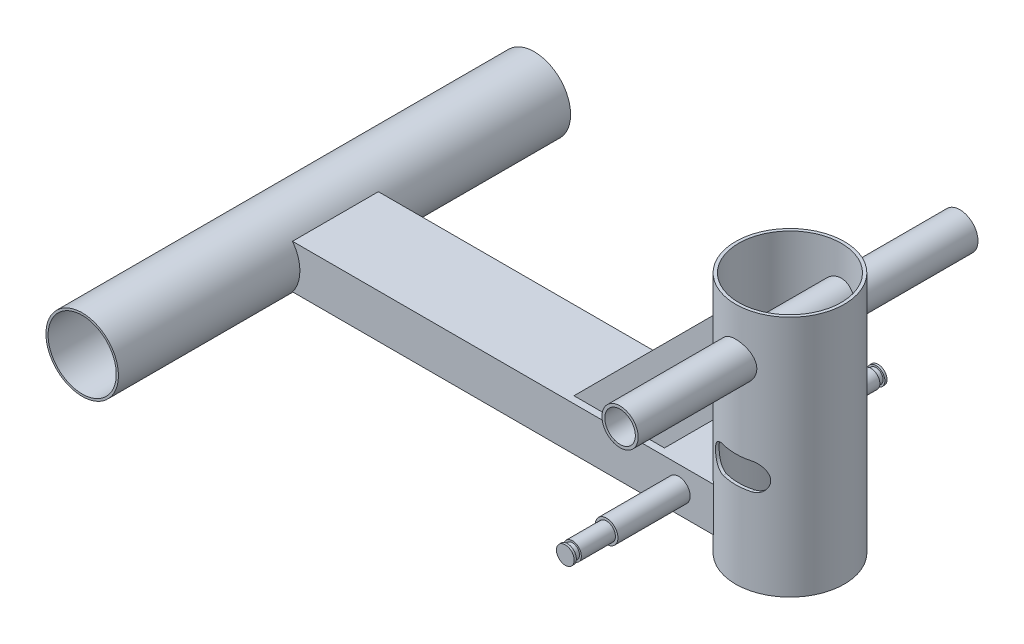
ISO-10303-21;
HEADER;
FILE_DESCRIPTION(('STEP AP214'),'2;1');
FILE_NAME('part.step','',(''),(''),'','','');
FILE_SCHEMA(('AUTOMOTIVE_DESIGN { 1 0 10303 214 1 1 1 1 }'));
ENDSEC;
DATA;
#1=APPLICATION_CONTEXT('core data for automotive mechanical design processes');
#2=APPLICATION_PROTOCOL_DEFINITION('international standard','automotive_design',2000,#1);
#3=PRODUCT_CONTEXT('',#1,'mechanical');
#4=PRODUCT('Part','Part','',(#3));
#5=PRODUCT_RELATED_PRODUCT_CATEGORY('part','',(#4));
#6=PRODUCT_DEFINITION_FORMATION('','',#4);
#7=PRODUCT_DEFINITION_CONTEXT('part definition',#1,'design');
#8=PRODUCT_DEFINITION('design','',#6,#7);
#9=PRODUCT_DEFINITION_SHAPE('','',#8);
#10=(LENGTH_UNIT() NAMED_UNIT(*) SI_UNIT(.MILLI.,.METRE.));
#11=(NAMED_UNIT(*) PLANE_ANGLE_UNIT() SI_UNIT($,.RADIAN.));
#12=(NAMED_UNIT(*) SI_UNIT($,.STERADIAN.) SOLID_ANGLE_UNIT());
#13=UNCERTAINTY_MEASURE_WITH_UNIT(LENGTH_MEASURE(1.E-05),#10,'distance_accuracy_value','');
#14=(GEOMETRIC_REPRESENTATION_CONTEXT(3) GLOBAL_UNCERTAINTY_ASSIGNED_CONTEXT((#13)) GLOBAL_UNIT_ASSIGNED_CONTEXT((#10,
#11,#12)) REPRESENTATION_CONTEXT('',''));
#15=CARTESIAN_POINT('',(0.,0.,0.));
#16=DIRECTION('',(0.,0.,1.));
#17=DIRECTION('',(1.,0.,0.));
#18=AXIS2_PLACEMENT_3D('',#15,#16,#17);
#19=CARTESIAN_POINT('',(340.,140.9,160.2));
#20=DIRECTION('',(0.,-1.,0.));
#21=DIRECTION('',(0.,0.,-1.));
#22=AXIS2_PLACEMENT_3D('',#19,#20,#21);
#23=CYLINDRICAL_SURFACE('',#22,38.25);
#24=CARTESIAN_POINT('',(340.,119.65,121.95));
#25=CARTESIAN_POINT('',(340.347842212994,119.650000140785,121.949999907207));
#26=CARTESIAN_POINT('',(340.695682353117,119.63575398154,121.954755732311));
#27=CARTESIAN_POINT('',(341.388776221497,119.578907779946,121.973648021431));
#28=CARTESIAN_POINT('',(341.73402997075,119.536307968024,121.987784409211));
#29=CARTESIAN_POINT('',(342.419454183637,119.423154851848,122.025053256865));
#30=CARTESIAN_POINT('',(342.759624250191,119.352599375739,122.04818641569));
#31=CARTESIAN_POINT('',(343.432442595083,119.184181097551,122.102824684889));
#32=CARTESIAN_POINT('',(343.765090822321,119.086318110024,122.134329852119));
#33=CARTESIAN_POINT('',(344.420036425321,118.864327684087,122.204814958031));
#34=CARTESIAN_POINT('',(344.742350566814,118.740245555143,122.243781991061));
#35=CARTESIAN_POINT('',(345.375140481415,118.466727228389,122.328212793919));
#36=CARTESIAN_POINT('',(345.685616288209,118.317291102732,122.373676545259));
#37=CARTESIAN_POINT('',(346.292815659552,117.994198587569,122.469939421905));
#38=CARTESIAN_POINT('',(346.589539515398,117.820542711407,122.520738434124));
#39=CARTESIAN_POINT('',(347.167598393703,117.450161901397,122.626413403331));
#40=CARTESIAN_POINT('',(347.448927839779,117.253428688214,122.681290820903));
#41=CARTESIAN_POINT('',(348.002956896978,116.831772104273,122.795486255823));
#42=CARTESIAN_POINT('',(348.275117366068,116.606163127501,122.854889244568));
#43=CARTESIAN_POINT('',(348.799626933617,116.133295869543,122.974988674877));
#44=CARTESIAN_POINT('',(349.051975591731,115.886037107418,123.035685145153));
#45=CARTESIAN_POINT('',(349.535424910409,115.371297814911,123.156777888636));
#46=CARTESIAN_POINT('',(349.766517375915,115.103809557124,123.21717403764));
#47=CARTESIAN_POINT('',(350.205816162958,114.550397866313,123.335985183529));
#48=CARTESIAN_POINT('',(350.414030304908,114.264480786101,123.394400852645));
#49=CARTESIAN_POINT('',(350.811972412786,113.667288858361,123.50929417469));
#50=CARTESIAN_POINT('',(351.00098900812,113.355519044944,123.565666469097));
#51=CARTESIAN_POINT('',(351.351979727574,112.71618779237,123.672903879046));
#52=CARTESIAN_POINT('',(351.513953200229,112.388625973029,123.723768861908));
#53=CARTESIAN_POINT('',(351.809469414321,111.72000912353,123.818369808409));
#54=CARTESIAN_POINT('',(351.943018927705,111.378957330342,123.862107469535));
#55=CARTESIAN_POINT('',(352.180514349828,110.685735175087,123.941025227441));
#56=CARTESIAN_POINT('',(352.284461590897,110.333565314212,123.97620570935));
#57=CARTESIAN_POINT('',(352.458744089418,109.632788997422,124.035785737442));
#58=CARTESIAN_POINT('',(352.53009384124,109.284462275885,124.060508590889));
#59=CARTESIAN_POINT('',(352.643497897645,108.582511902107,124.100026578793));
#60=CARTESIAN_POINT('',(352.685552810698,108.22888836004,124.114821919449));
#61=CARTESIAN_POINT('',(352.739927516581,107.519174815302,124.133983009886));
#62=CARTESIAN_POINT('',(352.752255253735,107.163085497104,124.138351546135));
#63=CARTESIAN_POINT('',(352.747068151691,106.451156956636,124.136517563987));
#64=CARTESIAN_POINT('',(352.729554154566,106.095317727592,124.130315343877));
#65=CARTESIAN_POINT('',(352.666353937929,105.402918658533,124.108075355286));
#66=CARTESIAN_POINT('',(352.621993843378,105.066221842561,124.092500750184));
#67=CARTESIAN_POINT('',(352.50668989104,104.397967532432,124.052400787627));
#68=CARTESIAN_POINT('',(352.435746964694,104.066409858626,124.027875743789));
#69=CARTESIAN_POINT('',(352.267902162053,103.410638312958,123.970606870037));
#70=CARTESIAN_POINT('',(352.170998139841,103.086425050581,123.937862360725));
#71=CARTESIAN_POINT('',(351.952042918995,102.447445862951,123.865106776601));
#72=CARTESIAN_POINT('',(351.829991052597,102.13268018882,123.825095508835));
#73=CARTESIAN_POINT('',(351.559555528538,101.509606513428,123.738243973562));
#74=CARTESIAN_POINT('',(351.410784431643,101.201480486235,123.691305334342));
#75=CARTESIAN_POINT('',(351.089306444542,100.598689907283,123.592376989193));
#76=CARTESIAN_POINT('',(350.916590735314,100.304030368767,123.540385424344));
#77=CARTESIAN_POINT('',(350.548465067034,99.7300196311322,123.432770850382));
#78=CARTESIAN_POINT('',(350.353058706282,99.4506660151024,123.377148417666));
#79=CARTESIAN_POINT('',(349.940666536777,98.9086501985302,123.263684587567));
#80=CARTESIAN_POINT('',(349.723670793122,98.6459957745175,123.205842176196));
#81=CARTESIAN_POINT('',(349.257573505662,98.1257136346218,123.086381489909));
#82=CARTESIAN_POINT('',(349.007386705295,97.8690661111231,123.024723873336));
#83=CARTESIAN_POINT('',(348.486298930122,97.3777410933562,122.902321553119));
#84=CARTESIAN_POINT('',(348.215406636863,97.1430544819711,122.841576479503));
#85=CARTESIAN_POINT('',(347.654330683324,96.6969495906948,122.722593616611));
#86=CARTESIAN_POINT('',(347.364136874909,96.4855437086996,122.664357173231));
#87=CARTESIAN_POINT('',(346.766510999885,96.0877092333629,122.552035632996));
#88=CARTESIAN_POINT('',(346.459085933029,95.9012706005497,122.497948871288));
#89=CARTESIAN_POINT('',(345.825641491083,95.5529135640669,122.394862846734));
#90=CARTESIAN_POINT('',(345.499464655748,95.3912641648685,122.345920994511));
#91=CARTESIAN_POINT('',(344.833633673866,95.0961409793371,122.255153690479));
#92=CARTESIAN_POINT('',(344.493979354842,94.962667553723,122.21332832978));
#93=CARTESIAN_POINT('',(343.80373556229,94.7251378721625,122.138016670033));
#94=CARTESIAN_POINT('',(343.453149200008,94.6210733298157,122.104528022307));
#95=CARTESIAN_POINT('',(342.743610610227,94.44332140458,122.046864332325));
#96=CARTESIAN_POINT('',(342.38465876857,94.3696326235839,122.022688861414));
#97=CARTESIAN_POINT('',(341.676919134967,94.2558994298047,121.985205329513));
#98=CARTESIAN_POINT('',(341.328365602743,94.2145345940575,121.971471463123));
#99=CARTESIAN_POINT('',(340.628792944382,94.1606835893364,121.95356838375));
#100=CARTESIAN_POINT('',(340.277773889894,94.1481965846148,121.949398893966));
#101=CARTESIAN_POINT('',(339.575975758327,94.1522228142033,121.950740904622));
#102=CARTESIAN_POINT('',(339.225196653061,94.1687316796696,121.956250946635));
#103=CARTESIAN_POINT('',(338.526474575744,94.2305790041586,121.976795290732));
#104=CARTESIAN_POINT('',(338.178531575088,94.2759171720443,121.991829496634));
#105=CARTESIAN_POINT('',(337.498096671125,94.3932539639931,122.030434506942));
#106=CARTESIAN_POINT('',(337.165449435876,94.464440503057,122.053744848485));
#107=CARTESIAN_POINT('',(336.50752672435,94.6329529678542,122.108346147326));
#108=CARTESIAN_POINT('',(336.182251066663,94.7302782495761,122.139636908));
#109=CARTESIAN_POINT('',(335.54121255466,94.9502494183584,122.209400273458));
#110=CARTESIAN_POINT('',(335.225448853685,95.0728930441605,122.247872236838));
#111=CARTESIAN_POINT('',(334.605247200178,95.3425980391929,122.331053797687));
#112=CARTESIAN_POINT('',(334.30081358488,95.4896686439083,122.375765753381));
#113=CARTESIAN_POINT('',(333.697423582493,95.8112699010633,122.47155228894));
#114=CARTESIAN_POINT('',(333.398817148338,95.9864167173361,122.522762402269));
#115=CARTESIAN_POINT('',(332.817321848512,96.360024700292,122.62927964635));
#116=CARTESIAN_POINT('',(332.53443392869,96.5584872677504,122.684587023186));
#117=CARTESIAN_POINT('',(331.985959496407,96.9774613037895,122.797913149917));
#118=CARTESIAN_POINT('',(331.720377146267,97.19797804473,122.855932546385));
#119=CARTESIAN_POINT('',(331.208100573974,97.6596586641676,122.973207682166));
#120=CARTESIAN_POINT('',(330.961406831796,97.9008230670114,123.032463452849));
#121=CARTESIAN_POINT('',(330.477559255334,98.4138040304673,123.153399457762));
#122=CARTESIAN_POINT('',(330.241350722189,98.6865161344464,123.215067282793));
#123=CARTESIAN_POINT('',(329.792693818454,99.2512449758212,123.336367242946));
#124=CARTESIAN_POINT('',(329.580244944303,99.5432613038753,123.395999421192));
#125=CARTESIAN_POINT('',(329.180519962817,100.144868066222,123.51151870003));
#126=CARTESIAN_POINT('',(328.99325050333,100.454463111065,123.567404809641));
#127=CARTESIAN_POINT('',(328.645431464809,101.089050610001,123.673717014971));
#128=CARTESIAN_POINT('',(328.484870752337,101.414036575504,123.72414538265));
#129=CARTESIAN_POINT('',(328.191951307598,102.076774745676,123.81791496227));
#130=CARTESIAN_POINT('',(328.059542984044,102.414503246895,123.861268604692));
#131=CARTESIAN_POINT('',(327.823750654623,103.100904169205,123.939595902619));
#132=CARTESIAN_POINT('',(327.720366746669,103.449576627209,123.974569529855));
#133=CARTESIAN_POINT('',(327.54365874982,104.155137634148,124.034950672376));
#134=CARTESIAN_POINT('',(327.470323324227,104.512023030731,124.06036179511));
#135=CARTESIAN_POINT('',(327.354418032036,105.231333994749,124.100754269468));
#136=CARTESIAN_POINT('',(327.311846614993,105.593759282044,124.115736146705));
#137=CARTESIAN_POINT('',(327.259309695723,106.302492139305,124.134254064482));
#138=CARTESIAN_POINT('',(327.247780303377,106.648670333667,124.13833898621));
#139=CARTESIAN_POINT('',(327.25292348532,107.340783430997,124.136520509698));
#140=CARTESIAN_POINT('',(327.269595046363,107.686718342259,124.130617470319));
#141=CARTESIAN_POINT('',(327.330971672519,108.375755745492,124.109013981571));
#142=CARTESIAN_POINT('',(327.375674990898,108.718858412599,124.093314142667));
#143=CARTESIAN_POINT('',(327.492680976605,109.399760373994,124.052616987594));
#144=CARTESIAN_POINT('',(327.564983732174,109.737559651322,124.027619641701));
#145=CARTESIAN_POINT('',(327.734882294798,110.399113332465,123.969663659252));
#146=CARTESIAN_POINT('',(327.831969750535,110.723012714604,123.936865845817));
#147=CARTESIAN_POINT('',(328.051243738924,111.361346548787,123.864025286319));
#148=CARTESIAN_POINT('',(328.173429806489,111.675781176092,123.823982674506));
#149=CARTESIAN_POINT('',(328.441955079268,112.293278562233,123.737773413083));
#150=CARTESIAN_POINT('',(328.588294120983,112.596341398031,123.691606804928));
#151=CARTESIAN_POINT('',(328.904140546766,113.189462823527,123.594376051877));
#152=CARTESIAN_POINT('',(329.073656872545,113.47951633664,123.54331001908));
#153=CARTESIAN_POINT('',(329.442514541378,114.057125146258,123.435336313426));
#154=CARTESIAN_POINT('',(329.64282847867,114.344030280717,123.378271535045));
#155=CARTESIAN_POINT('',(330.066182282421,114.900248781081,123.261808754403));
#156=CARTESIAN_POINT('',(330.289232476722,115.169554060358,123.202409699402));
#157=CARTESIAN_POINT('',(330.756659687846,115.688927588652,123.082869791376));
#158=CARTESIAN_POINT('',(331.00104228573,115.938990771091,123.022728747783));
#159=CARTESIAN_POINT('',(331.509512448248,116.418199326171,122.903320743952));
#160=CARTESIAN_POINT('',(331.773591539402,116.647353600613,122.844053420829));
#161=CARTESIAN_POINT('',(332.330802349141,117.092052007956,122.725606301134));
#162=CARTESIAN_POINT('',(332.624669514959,117.306701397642,122.666522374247));
#163=CARTESIAN_POINT('',(333.230136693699,117.71035524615,122.552605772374));
#164=CARTESIAN_POINT('',(333.541729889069,117.899369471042,122.497771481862));
#165=CARTESIAN_POINT('',(334.180710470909,118.250385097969,122.393874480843));
#166=CARTESIAN_POINT('',(334.508097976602,118.412386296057,122.344811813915));
#167=CARTESIAN_POINT('',(335.176404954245,118.708002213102,122.253865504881));
#168=CARTESIAN_POINT('',(335.517323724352,118.841618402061,122.211981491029));
#169=CARTESIAN_POINT('',(336.194741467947,119.07394511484,122.138295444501));
#170=CARTESIAN_POINT('',(336.530757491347,119.173948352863,122.106126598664));
#171=CARTESIAN_POINT('',(337.210554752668,119.346060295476,122.050323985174));
#172=CARTESIAN_POINT('',(337.554335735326,119.418169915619,122.026689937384));
#173=CARTESIAN_POINT('',(338.247096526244,119.533808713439,121.988612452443));
#174=CARTESIAN_POINT('',(338.596075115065,119.577344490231,121.974166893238));
#175=CARTESIAN_POINT('',(339.296703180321,119.635440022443,121.954860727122));
#176=CARTESIAN_POINT('',(339.648352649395,119.649999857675,121.950000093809));
#177=CARTESIAN_POINT('',(340.,119.65,121.95));
#178=B_SPLINE_CURVE_WITH_KNOTS('',3,(#24,#25,#26,#27,#28,#29,#30,#31,#32,#33,#34,#35,#36,#37,
#38,#39,#40,#41,#42,#43,#44,#45,#46,#47,#48,#49,#50,#51,#52,#53,#54,#55,#56,#57,#58,#59,#60,#61,
#62,#63,#64,#65,#66,#67,#68,#69,#70,#71,#72,#73,#74,#75,#76,#77,#78,#79,#80,#81,#82,#83,#84,#85,
#86,#87,#88,#89,#90,#91,#92,#93,#94,#95,#96,#97,#98,#99,#100,#101,#102,#103,#104,#105,#106,#107,
#108,#109,#110,#111,#112,#113,#114,#115,#116,#117,#118,#119,#120,#121,#122,#123,#124,#125,#126,
#127,#128,#129,#130,#131,#132,#133,#134,#135,#136,#137,#138,#139,#140,#141,#142,#143,#144,#145,
#146,#147,#148,#149,#150,#151,#152,#153,#154,#155,#156,#157,#158,#159,#160,#161,#162,#163,#164,
#165,#166,#167,#168,#169,#170,#171,#172,#173,#174,#175,#176,#177),.UNSPECIFIED.,.T.,.F.,(4,2,2,
2,2,2,2,2,2,2,2,2,2,2,2,2,2,2,2,2,2,2,2,2,2,2,2,2,2,2,2,2,2,2,2,2,2,2,2,2,2,2,2,2,2,2,2,2,2,2,2,
2,2,2,2,2,2,2,2,2,2,2,2,2,2,2,2,2,2,2,2,2,2,2,2,2,4),(0.,1.04320045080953,2.0863924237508,
3.12966545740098,4.17294557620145,5.21443732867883,6.25592611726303,7.29739283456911,
8.33923434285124,9.41342324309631,10.4876360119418,11.5622612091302,12.6365179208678,
13.7419338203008,14.8473763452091,15.9525552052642,17.0576843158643,18.1255779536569,
19.1934494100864,20.2610354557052,21.3285913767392,22.3472855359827,23.3659440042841,
24.3846866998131,25.4034564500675,26.4384073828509,27.473740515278,28.5089096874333,
29.5445574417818,30.6343332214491,31.7236545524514,32.8135532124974,33.9030122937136,
35.0035646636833,36.1041311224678,37.2043871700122,38.3045925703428,39.3570872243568,
40.4095514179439,41.4618570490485,42.5141520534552,43.5359016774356,44.5576261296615,
45.5792593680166,46.6012797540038,47.6499564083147,48.6986960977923,49.7476871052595,
50.7967047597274,51.8934696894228,52.9902113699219,54.0872420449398,55.1838142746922,
56.2784385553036,57.3730665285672,58.4672811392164,59.5614405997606,60.5993440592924,
61.6372102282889,62.6750117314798,63.7128165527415,64.7308408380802,65.7488462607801,
66.7668447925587,67.7852371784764,68.8476584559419,69.9105645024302,70.9737494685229,
72.0364796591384,73.1411744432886,74.245447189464,75.3497282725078,76.4539521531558,
77.5088456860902,78.5637045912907,79.6183197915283,80.6729320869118),.UNSPECIFIED.);
#179=CARTESIAN_POINT('',(340.,119.65,121.95));
#180=VERTEX_POINT('',#179);
#181=EDGE_CURVE('E321',#180,#180,#178,.T.);
#182=ORIENTED_EDGE('',*,*,#181,.F.);
#183=EDGE_LOOP('',(#182));
#184=FACE_BOUND('',#183,.T.);
#185=CARTESIAN_POINT('',(327.25,106.9,196.262445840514));
#186=CARTESIAN_POINT('',(327.249999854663,106.552764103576,196.262445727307));
#187=CARTESIAN_POINT('',(327.264196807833,106.205530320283,196.26747458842));
#188=CARTESIAN_POINT('',(327.320841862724,105.513666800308,196.287426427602));
#189=CARTESIAN_POINT('',(327.363289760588,105.169037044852,196.302349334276));
#190=CARTESIAN_POINT('',(327.476028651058,104.484868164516,196.341613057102));
#191=CARTESIAN_POINT('',(327.546323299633,104.145329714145,196.365955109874));
#192=CARTESIAN_POINT('',(327.71409838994,103.473791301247,196.423293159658));
#193=CARTESIAN_POINT('',(327.811579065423,103.141791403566,196.456289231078));
#194=CARTESIAN_POINT('',(328.032646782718,102.488228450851,196.529856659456));
#195=CARTESIAN_POINT('',(328.156180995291,102.166645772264,196.570412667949));
#196=CARTESIAN_POINT('',(328.428470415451,101.535262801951,196.657957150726));
#197=CARTESIAN_POINT('',(328.577225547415,101.225462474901,196.704945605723));
#198=CARTESIAN_POINT('',(328.898848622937,100.619506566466,196.804033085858));
#199=CARTESIAN_POINT('',(329.071716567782,100.323350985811,196.856132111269));
#200=CARTESIAN_POINT('',(329.440444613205,99.7462891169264,196.964047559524));
#201=CARTESIAN_POINT('',(329.636312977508,99.4653883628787,197.01986531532));
#202=CARTESIAN_POINT('',(330.057067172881,98.9108852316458,197.135753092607));
#203=CARTESIAN_POINT('',(330.282734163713,98.6378921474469,197.195903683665));
#204=CARTESIAN_POINT('',(330.755892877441,98.11170212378,197.316958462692));
#205=CARTESIAN_POINT('',(331.003385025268,97.8585055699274,197.377862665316));
#206=CARTESIAN_POINT('',(331.518765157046,97.3733829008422,197.498809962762));
#207=CARTESIAN_POINT('',(331.786659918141,97.1414639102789,197.558852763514));
#208=CARTESIAN_POINT('',(332.341061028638,96.7005613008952,197.676438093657));
#209=CARTESIAN_POINT('',(332.627560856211,96.4915697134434,197.733981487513));
#210=CARTESIAN_POINT('',(333.225302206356,96.0926672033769,197.846525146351));
#211=CARTESIAN_POINT('',(333.536996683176,95.9034039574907,197.901418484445));
#212=CARTESIAN_POINT('',(334.176212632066,95.5519149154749,198.005434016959));
#213=CARTESIAN_POINT('',(334.503734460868,95.3896897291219,198.054556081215));
#214=CARTESIAN_POINT('',(335.172278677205,95.093678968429,198.145610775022));
#215=CARTESIAN_POINT('',(335.513298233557,94.9598874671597,198.187544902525));
#216=CARTESIAN_POINT('',(336.206422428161,94.7219249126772,198.263010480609));
#217=CARTESIAN_POINT('',(336.55852659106,94.6177525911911,198.296542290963));
#218=CARTESIAN_POINT('',(337.258734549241,94.4431305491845,198.3532045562));
#219=CARTESIAN_POINT('',(337.606551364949,94.3716337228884,198.376656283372));
#220=CARTESIAN_POINT('',(338.307434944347,94.2578578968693,198.414144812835));
#221=CARTESIAN_POINT('',(338.660501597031,94.2155782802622,198.428181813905));
#222=CARTESIAN_POINT('',(339.369107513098,94.1606619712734,198.446438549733));
#223=CARTESIAN_POINT('',(339.724646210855,94.1480187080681,198.450660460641));
#224=CARTESIAN_POINT('',(340.435511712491,94.15248424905,198.449171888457));
#225=CARTESIAN_POINT('',(340.790838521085,94.1695923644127,198.443461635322));
#226=CARTESIAN_POINT('',(341.484615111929,94.2321300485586,198.422691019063));
#227=CARTESIAN_POINT('',(341.823179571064,94.2764207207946,198.408006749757));
#228=CARTESIAN_POINT('',(342.495187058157,94.3918919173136,198.37001174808));
#229=CARTESIAN_POINT('',(342.828630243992,94.4630716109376,198.346701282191));
#230=CARTESIAN_POINT('',(343.488139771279,94.6316978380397,198.29205799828));
#231=CARTESIAN_POINT('',(343.814205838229,94.7291453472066,198.260724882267));
#232=CARTESIAN_POINT('',(344.456822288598,94.949492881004,198.190837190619));
#233=CARTESIAN_POINT('',(344.77337246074,95.0723934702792,198.152282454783));
#234=CARTESIAN_POINT('',(345.399054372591,95.3444554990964,198.068372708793));
#235=CARTESIAN_POINT('',(345.708034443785,95.4939401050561,198.02293517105));
#236=CARTESIAN_POINT('',(346.312310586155,95.816922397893,197.926792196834));
#237=CARTESIAN_POINT('',(346.607606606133,95.9904201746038,197.876086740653));
#238=CARTESIAN_POINT('',(347.182812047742,96.3602359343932,197.770669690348));
#239=CARTESIAN_POINT('',(347.462720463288,96.5565554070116,197.715957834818));
#240=CARTESIAN_POINT('',(348.005640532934,96.9708076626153,197.603864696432));
#241=CARTESIAN_POINT('',(348.268646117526,97.1887481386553,197.546482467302));
#242=CARTESIAN_POINT('',(348.788110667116,97.6555850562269,197.427757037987));
#243=CARTESIAN_POINT('',(349.043682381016,97.9054545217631,197.366354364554));
#244=CARTESIAN_POINT('',(349.532994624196,98.4257999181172,197.243867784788));
#245=CARTESIAN_POINT('',(349.766734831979,98.6962761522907,197.182783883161));
#246=CARTESIAN_POINT('',(350.210962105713,99.2562753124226,197.062606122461));
#247=CARTESIAN_POINT('',(350.421440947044,99.5458049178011,197.003512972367));
#248=CARTESIAN_POINT('',(350.817538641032,100.141939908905,196.889042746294));
#249=CARTESIAN_POINT('',(351.003166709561,100.448538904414,196.833664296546));
#250=CARTESIAN_POINT('',(351.350794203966,101.081560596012,196.727462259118));
#251=CARTESIAN_POINT('',(351.512411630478,101.408206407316,196.676716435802));
#252=CARTESIAN_POINT('',(351.807408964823,102.075012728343,196.582297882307));
#253=CARTESIAN_POINT('',(351.940788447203,102.4151734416,196.538625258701));
#254=CARTESIAN_POINT('',(352.178058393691,103.106467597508,196.459799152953));
#255=CARTESIAN_POINT('',(352.281958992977,103.457597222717,196.424642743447));
#256=CARTESIAN_POINT('',(352.459306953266,104.16828264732,196.364028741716));
#257=CARTESIAN_POINT('',(352.532755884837,104.527838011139,196.338570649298));
#258=CARTESIAN_POINT('',(352.645825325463,105.23615883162,196.299155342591));
#259=CARTESIAN_POINT('',(352.686822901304,105.584678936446,196.284730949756));
#260=CARTESIAN_POINT('',(352.739948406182,106.284181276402,196.266009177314));
#261=CARTESIAN_POINT('',(352.752077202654,106.635163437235,196.261711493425));
#262=CARTESIAN_POINT('',(352.747342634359,107.336848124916,196.263385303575));
#263=CARTESIAN_POINT('',(352.730483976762,107.687550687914,196.269355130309));
#264=CARTESIAN_POINT('',(352.667955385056,108.386053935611,196.291363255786));
#265=CARTESIAN_POINT('',(352.622285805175,108.733854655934,196.30740143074));
#266=CARTESIAN_POINT('',(352.504654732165,109.412063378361,196.348303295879));
#267=CARTESIAN_POINT('',(352.433652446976,109.742657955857,196.372844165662));
#268=CARTESIAN_POINT('',(352.265844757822,110.396493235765,196.430089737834));
#269=CARTESIAN_POINT('',(352.169040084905,110.719734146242,196.462794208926));
#270=CARTESIAN_POINT('',(351.950437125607,111.356788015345,196.535420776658));
#271=CARTESIAN_POINT('',(351.828640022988,111.670601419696,196.575342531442));
#272=CARTESIAN_POINT('',(351.560938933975,112.287035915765,196.661307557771));
#273=CARTESIAN_POINT('',(351.415025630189,112.589652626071,196.707353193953));
#274=CARTESIAN_POINT('',(351.095229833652,113.191103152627,196.805835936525));
#275=CARTESIAN_POINT('',(350.920614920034,113.489522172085,196.858427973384));
#276=CARTESIAN_POINT('',(350.548015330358,114.070852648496,196.967370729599));
#277=CARTESIAN_POINT('',(350.350020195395,114.353757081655,197.023723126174));
#278=CARTESIAN_POINT('',(349.931943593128,114.90237260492,197.138678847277));
#279=CARTESIAN_POINT('',(349.711856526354,115.168079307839,197.197282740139));
#280=CARTESIAN_POINT('',(349.25106977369,115.680598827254,197.315181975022));
#281=CARTESIAN_POINT('',(349.010378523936,115.927419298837,197.374477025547));
#282=CARTESIAN_POINT('',(348.497519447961,116.412370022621,197.49513867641));
#283=CARTESIAN_POINT('',(348.224390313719,116.649494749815,197.556465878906));
#284=CARTESIAN_POINT('',(347.658729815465,117.09985348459,197.676524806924));
#285=CARTESIAN_POINT('',(347.366205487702,117.31309608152,197.735257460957));
#286=CARTESIAN_POINT('',(346.763450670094,117.714311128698,197.848536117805));
#287=CARTESIAN_POINT('',(346.453216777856,117.902278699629,197.903081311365));
#288=CARTESIAN_POINT('',(345.817118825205,118.251442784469,198.006446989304));
#289=CARTESIAN_POINT('',(345.491255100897,118.412639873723,198.055267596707));
#290=CARTESIAN_POINT('',(344.828305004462,118.705951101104,198.145502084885));
#291=CARTESIAN_POINT('',(344.491306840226,118.838250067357,198.186962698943));
#292=CARTESIAN_POINT('',(343.806450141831,119.073930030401,198.261687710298));
#293=CARTESIAN_POINT('',(343.458591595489,119.17731099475,198.2949520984));
#294=CARTESIAN_POINT('',(342.754711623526,119.354143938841,198.352309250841));
#295=CARTESIAN_POINT('',(342.398692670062,119.427604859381,198.376404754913));
#296=CARTESIAN_POINT('',(341.681166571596,119.543901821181,198.414725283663));
#297=CARTESIAN_POINT('',(341.319659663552,119.586739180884,198.428950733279));
#298=CARTESIAN_POINT('',(340.611132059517,119.640064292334,198.446681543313));
#299=CARTESIAN_POINT('',(340.264229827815,119.651978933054,198.45065968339));
#300=CARTESIAN_POINT('',(339.570636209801,119.647486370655,198.449162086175));
#301=CARTESIAN_POINT('',(339.223944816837,119.631080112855,198.443686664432));
#302=CARTESIAN_POINT('',(338.533354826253,119.570106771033,198.423432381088));
#303=CARTESIAN_POINT('',(338.189456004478,119.52554197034,198.408654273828));
#304=CARTESIAN_POINT('',(337.50691361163,119.408673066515,198.370195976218));
#305=CARTESIAN_POINT('',(337.16827005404,119.336368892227,198.346515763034));
#306=CARTESIAN_POINT('',(336.503964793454,119.16604836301,198.291331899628));
#307=CARTESIAN_POINT('',(336.178182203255,119.068460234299,198.25995897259));
#308=CARTESIAN_POINT('',(335.53614598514,118.847875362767,198.190009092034));
#309=CARTESIAN_POINT('',(335.219892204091,118.724879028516,198.151432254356));
#310=CARTESIAN_POINT('',(334.598892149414,118.454446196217,198.068043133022));
#311=CARTESIAN_POINT('',(334.294145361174,118.307010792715,198.023231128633));
#312=CARTESIAN_POINT('',(333.697838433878,117.988712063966,197.928456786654));
#313=CARTESIAN_POINT('',(333.406283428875,117.81783971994,197.878492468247));
#314=CARTESIAN_POINT('',(332.827751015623,117.447209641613,197.772742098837));
#315=CARTESIAN_POINT('',(332.541330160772,117.246624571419,197.716810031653));
#316=CARTESIAN_POINT('',(331.986141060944,116.822831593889,197.602151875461));
#317=CARTESIAN_POINT('',(331.717380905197,116.599613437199,197.543424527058));
#318=CARTESIAN_POINT('',(331.199145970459,116.131972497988,197.424698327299));
#319=CARTESIAN_POINT('',(330.949676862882,115.887543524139,197.364699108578));
#320=CARTESIAN_POINT('',(330.471690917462,115.379122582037,197.245033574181));
#321=CARTESIAN_POINT('',(330.243165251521,115.115138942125,197.185367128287));
#322=CARTESIAN_POINT('',(329.799715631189,114.558221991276,197.065587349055));
#323=CARTESIAN_POINT('',(329.585690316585,114.264555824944,197.005550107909));
#324=CARTESIAN_POINT('',(329.183251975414,113.659614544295,196.889294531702));
#325=CARTESIAN_POINT('',(328.994829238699,113.348346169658,196.833074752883));
#326=CARTESIAN_POINT('',(328.644927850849,112.710101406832,196.726132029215));
#327=CARTESIAN_POINT('',(328.483449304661,112.383124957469,196.675409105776));
#328=CARTESIAN_POINT('',(328.188785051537,111.715678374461,196.581061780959));
#329=CARTESIAN_POINT('',(328.055597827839,111.375208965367,196.537436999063));
#330=CARTESIAN_POINT('',(327.824072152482,110.698843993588,196.460494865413));
#331=CARTESIAN_POINT('',(327.724430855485,110.363437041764,196.426800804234));
#332=CARTESIAN_POINT('',(327.552926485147,109.68483791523,196.368233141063));
#333=CARTESIAN_POINT('',(327.481062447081,109.341646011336,196.343359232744));
#334=CARTESIAN_POINT('',(327.365813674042,108.650055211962,196.303234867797));
#335=CARTESIAN_POINT('',(327.322420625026,108.301657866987,196.287981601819));
#336=CARTESIAN_POINT('',(327.264513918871,107.602172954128,196.267587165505));
#337=CARTESIAN_POINT('',(327.250000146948,107.251085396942,196.262445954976));
#338=CARTESIAN_POINT('',(327.25,106.9,196.262445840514));
#339=B_SPLINE_CURVE_WITH_KNOTS('',3,(#185,#186,#187,#188,#189,#190,#191,#192,#193,#194,#195,
#196,#197,#198,#199,#200,#201,#202,#203,#204,#205,#206,#207,#208,#209,#210,#211,#212,#213,#214,
#215,#216,#217,#218,#219,#220,#221,#222,#223,#224,#225,#226,#227,#228,#229,#230,#231,#232,#233,
#234,#235,#236,#237,#238,#239,#240,#241,#242,#243,#244,#245,#246,#247,#248,#249,#250,#251,#252,
#253,#254,#255,#256,#257,#258,#259,#260,#261,#262,#263,#264,#265,#266,#267,#268,#269,#270,#271,
#272,#273,#274,#275,#276,#277,#278,#279,#280,#281,#282,#283,#284,#285,#286,#287,#288,#289,#290,
#291,#292,#293,#294,#295,#296,#297,#298,#299,#300,#301,#302,#303,#304,#305,#306,#307,#308,#309,
#310,#311,#312,#313,#314,#315,#316,#317,#318,#319,#320,#321,#322,#323,#324,#325,#326,#327,#328,
#329,#330,#331,#332,#333,#334,#335,#336,#337,#338),.UNSPECIFIED.,.T.,.F.,(4,2,2,2,2,2,2,2,2,2,2,
2,2,2,2,2,2,2,2,2,2,2,2,2,2,2,2,2,2,2,2,2,2,2,2,2,2,2,2,2,2,2,2,2,2,2,2,2,2,2,2,2,2,2,2,2,2,2,2,
2,2,2,2,2,2,2,2,2,2,2,2,2,2,2,2,2,4),(0.,1.04137927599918,2.08275103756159,3.12425956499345,
4.16577704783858,5.20520258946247,6.24462501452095,7.28404749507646,8.32384457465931,
9.40040902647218,10.476994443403,11.5539390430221,12.6305081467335,13.7354374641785,
14.8403916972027,15.9451153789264,17.0497917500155,18.1160372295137,19.1822601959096,
20.2482467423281,21.3142086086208,22.338298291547,23.3623563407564,24.3864524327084,
25.4105712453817,26.4481166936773,27.4856660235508,28.5232831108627,29.5612707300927,
30.6479966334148,31.7347385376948,32.8218634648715,33.9085841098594,35.011075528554,
36.11358355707,37.2157120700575,38.3177837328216,39.3701195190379,40.4224236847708,
41.4745569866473,42.5266773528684,43.5425789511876,44.5584517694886,45.5742764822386,
46.5904945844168,47.6385168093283,48.6870096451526,49.7357689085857,50.7841008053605,
51.8833880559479,52.9822786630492,54.0813811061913,55.1804599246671,56.2722888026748,
57.3641189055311,58.4556225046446,59.5470791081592,60.5871954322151,61.6272770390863,
62.667274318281,63.7072742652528,64.7306965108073,65.7541023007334,66.7774622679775,
67.8012171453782,68.8623805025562,69.9240265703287,70.9859835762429,72.0474908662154,
73.1510889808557,74.2542673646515,75.3574500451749,76.460573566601,77.513846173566,
78.5670821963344,79.6200105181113,80.6729346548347),.UNSPECIFIED.);
#340=CARTESIAN_POINT('',(327.25,106.9,196.262445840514));
#341=VERTEX_POINT('',#340);
#342=EDGE_CURVE('E313',#341,#341,#339,.T.);
#343=ORIENTED_EDGE('',*,*,#342,.F.);
#344=EDGE_LOOP('',(#343));
#345=FACE_BOUND('',#344,.T.);
#346=CARTESIAN_POINT('',(330.,49.8,197.119676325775));
#347=CARTESIAN_POINT('',(329.722032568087,49.8000252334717,197.044419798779));
#348=CARTESIAN_POINT('',(329.444978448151,49.7876725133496,196.965976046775));
#349=CARTESIAN_POINT('',(328.894763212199,49.7388739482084,196.803521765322));
#350=CARTESIAN_POINT('',(328.621600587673,49.7024377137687,196.719513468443));
#351=CARTESIAN_POINT('',(328.081641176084,49.6062463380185,196.54687834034));
#352=CARTESIAN_POINT('',(327.814831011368,49.5465458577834,196.458262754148));
#353=CARTESIAN_POINT('',(327.288614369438,49.4045905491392,196.27714744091));
#354=CARTESIAN_POINT('',(327.029208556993,49.3223337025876,196.18464736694));
#355=CARTESIAN_POINT('',(326.51977358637,49.1362157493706,195.996921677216));
#356=CARTESIAN_POINT('',(326.269731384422,49.0323861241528,195.901700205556));
#357=CARTESIAN_POINT('',(325.779979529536,48.8038371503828,195.709474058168));
#358=CARTESIAN_POINT('',(325.540273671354,48.6791102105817,195.612468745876));
#359=CARTESIAN_POINT('',(325.072538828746,48.4095579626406,195.417859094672));
#360=CARTESIAN_POINT('',(324.844515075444,48.2647237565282,195.320254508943));
#361=CARTESIAN_POINT('',(324.401484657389,47.9557651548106,195.125740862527));
#362=CARTESIAN_POINT('',(324.18648258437,47.791634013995,195.028832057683));
#363=CARTESIAN_POINT('',(323.763134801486,47.4384865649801,194.833553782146));
#364=CARTESIAN_POINT('',(323.555334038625,47.2487717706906,194.735264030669));
#365=CARTESIAN_POINT('',(323.156671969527,46.8504468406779,194.542594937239));
#366=CARTESIAN_POINT('',(322.965811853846,46.6418353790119,194.448215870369));
#367=CARTESIAN_POINT('',(322.602547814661,46.2067229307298,194.265122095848));
#368=CARTESIAN_POINT('',(322.430146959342,45.9802189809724,194.176408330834));
#369=CARTESIAN_POINT('',(322.105537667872,45.5106626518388,194.006571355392));
#370=CARTESIAN_POINT('',(321.953318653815,45.2676190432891,193.925444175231));
#371=CARTESIAN_POINT('',(321.676754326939,44.7771439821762,193.775955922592));
#372=CARTESIAN_POINT('',(321.551490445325,44.5303530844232,193.70719534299));
#373=CARTESIAN_POINT('',(321.322468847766,44.024563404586,193.580076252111));
#374=CARTESIAN_POINT('',(321.218698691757,43.7655717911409,193.521711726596));
#375=CARTESIAN_POINT('',(321.034108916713,43.2374244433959,193.41699480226));
#376=CARTESIAN_POINT('',(320.953269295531,42.9682778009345,193.370631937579));
#377=CARTESIAN_POINT('',(320.815723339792,42.4219695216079,193.291273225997));
#378=CARTESIAN_POINT('',(320.759012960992,42.1448092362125,193.258275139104));
#379=CARTESIAN_POINT('',(320.676431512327,41.6214364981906,193.210061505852));
#380=CARTESIAN_POINT('',(320.647519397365,41.3758603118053,193.193097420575));
#381=CARTESIAN_POINT('',(320.609144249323,40.8826808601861,193.170558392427));
#382=CARTESIAN_POINT('',(320.599679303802,40.6350777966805,193.164982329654));
#383=CARTESIAN_POINT('',(320.600337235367,40.139984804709,193.165369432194));
#384=CARTESIAN_POINT('',(320.6104542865,39.8924948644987,193.171329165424));
#385=CARTESIAN_POINT('',(320.650114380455,39.3996214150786,193.194620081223));
#386=CARTESIAN_POINT('',(320.679656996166,39.1542378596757,193.211951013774));
#387=CARTESIAN_POINT('',(320.754778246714,38.686006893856,193.255796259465));
#388=CARTESIAN_POINT('',(320.798972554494,38.4628604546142,193.281515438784));
#389=CARTESIAN_POINT('',(320.903092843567,38.0214021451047,193.341729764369));
#390=CARTESIAN_POINT('',(320.963024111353,37.8030919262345,193.376227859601));
#391=CARTESIAN_POINT('',(321.097955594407,37.3727147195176,193.453289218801));
#392=CARTESIAN_POINT('',(321.172952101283,37.1606462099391,193.495850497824));
#393=CARTESIAN_POINT('',(321.337331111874,36.7437170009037,193.588264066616));
#394=CARTESIAN_POINT('',(321.426719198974,36.5388591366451,193.638119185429));
#395=CARTESIAN_POINT('',(321.624747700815,36.1255771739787,193.747371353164));
#396=CARTESIAN_POINT('',(321.734210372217,35.9176499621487,193.807156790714));
#397=CARTESIAN_POINT('',(321.967494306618,35.5118874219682,193.932903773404));
#398=CARTESIAN_POINT('',(322.091320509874,35.3140555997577,193.998867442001));
#399=CARTESIAN_POINT('',(322.352412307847,34.9293089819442,194.13592320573));
#400=CARTESIAN_POINT('',(322.489679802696,34.7423957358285,194.207016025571));
#401=CARTESIAN_POINT('',(322.776761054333,34.380180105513,194.353308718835));
#402=CARTESIAN_POINT('',(322.92657534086,34.204878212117,194.428508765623));
#403=CARTESIAN_POINT('',(323.257427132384,33.8452574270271,194.591668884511));
#404=CARTESIAN_POINT('',(323.440024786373,33.6625610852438,194.680047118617));
#405=CARTESIAN_POINT('',(323.818843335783,33.3134178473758,194.85943713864));
#406=CARTESIAN_POINT('',(324.015061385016,33.1469675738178,194.950448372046));
#407=CARTESIAN_POINT('',(324.4202216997,32.8308422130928,195.133973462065));
#408=CARTESIAN_POINT('',(324.629174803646,32.6811817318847,195.226488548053));
#409=CARTESIAN_POINT('',(325.058563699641,32.3994905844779,195.411797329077));
#410=CARTESIAN_POINT('',(325.279001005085,32.267462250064,195.504591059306));
#411=CARTESIAN_POINT('',(325.749491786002,32.011262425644,195.697260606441));
#412=CARTESIAN_POINT('',(326.00046682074,31.88872472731,195.797064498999));
#413=CARTESIAN_POINT('',(326.51298373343,31.6662302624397,195.99438876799));
#414=CARTESIAN_POINT('',(326.774521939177,31.5662657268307,196.09190991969));
#415=CARTESIAN_POINT('',(327.306272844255,31.3898835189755,196.28339696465));
#416=CARTESIAN_POINT('',(327.576473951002,31.3134357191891,196.377367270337));
#417=CARTESIAN_POINT('',(328.12396920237,31.1848208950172,196.560771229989));
#418=CARTESIAN_POINT('',(328.401259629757,31.1326414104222,196.650207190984));
#419=CARTESIAN_POINT('',(328.898618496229,31.0621627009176,196.804284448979));
#420=CARTESIAN_POINT('',(329.117660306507,31.0389033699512,196.870007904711));
#421=CARTESIAN_POINT('',(329.557608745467,31.0078279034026,196.997711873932));
#422=CARTESIAN_POINT('',(329.778512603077,30.9999918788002,197.05969710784));
#423=CARTESIAN_POINT('',(330.,31.,197.119676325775));
#424=B_SPLINE_CURVE_WITH_KNOTS('',3,(#346,#347,#348,#349,#350,#351,#352,#353,#354,#355,#356,
#357,#358,#359,#360,#361,#362,#363,#364,#365,#366,#367,#368,#369,#370,#371,#372,#373,#374,#375,
#376,#377,#378,#379,#380,#381,#382,#383,#384,#385,#386,#387,#388,#389,#390,#391,#392,#393,#394,
#395,#396,#397,#398,#399,#400,#401,#402,#403,#404,#405,#406,#407,#408,#409,#410,#411,#412,#413,
#414,#415,#416,#417,#418,#419,#420,#421,#422,#423),.UNSPECIFIED.,.F.,.F.,(4,2,2,2,2,2,2,2,2,2,2,
2,2,2,2,2,2,2,2,2,2,2,2,2,2,2,2,2,2,2,2,2,2,2,2,2,2,2,4),(0.,0.863570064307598,1.726795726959,
2.58800528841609,3.44929192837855,4.30933039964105,5.16968197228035,6.03041549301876,
6.89145078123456,7.78450904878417,8.67763002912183,9.57089922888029,10.4636983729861,
11.3180193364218,12.1718444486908,13.0249224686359,13.8778574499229,14.6204217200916,
15.3629129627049,16.1051833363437,16.8474373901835,17.5334627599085,18.2197188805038,
18.9058062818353,19.5921605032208,20.3188153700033,21.0457209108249,21.772729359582,
22.4997685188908,23.3179082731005,24.1358775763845,24.9545530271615,25.7733366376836,
26.6620420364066,27.5504410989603,28.437697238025,29.324497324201,30.0135709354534,
30.7017553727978),.UNSPECIFIED.);
#425=CARTESIAN_POINT('',(330.,49.8,197.119676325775));
#426=VERTEX_POINT('',#425);
#427=CARTESIAN_POINT('',(330.,31.,197.119676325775));
#428=VERTEX_POINT('',#427);
#429=EDGE_CURVE('E522',#426,#428,#424,.T.);
#430=ORIENTED_EDGE('',*,*,#429,.F.);
#431=CARTESIAN_POINT('',(340.,49.8,160.2));
#432=DIRECTION('',(0.,-1.,0.));
#433=DIRECTION('',(0.,0.,-1.));
#434=AXIS2_PLACEMENT_3D('',#431,#432,#433);
#435=CIRCLE('',#434,38.25);
#436=CARTESIAN_POINT('',(350.,49.8,197.119676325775));
#437=VERTEX_POINT('',#436);
#438=EDGE_CURVE('E449',#437,#426,#435,.T.);
#439=ORIENTED_EDGE('',*,*,#438,.F.);
#440=CARTESIAN_POINT('',(350.,31.,197.119676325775));
#441=CARTESIAN_POINT('',(350.277967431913,30.9999747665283,197.044419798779));
#442=CARTESIAN_POINT('',(350.555021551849,31.0123274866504,196.965976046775));
#443=CARTESIAN_POINT('',(351.105236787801,31.0611260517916,196.803521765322));
#444=CARTESIAN_POINT('',(351.378399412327,31.0975622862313,196.719513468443));
#445=CARTESIAN_POINT('',(351.918358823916,31.1937536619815,196.54687834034));
#446=CARTESIAN_POINT('',(352.185168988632,31.2534541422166,196.458262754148));
#447=CARTESIAN_POINT('',(352.711385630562,31.3954094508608,196.27714744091));
#448=CARTESIAN_POINT('',(352.970791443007,31.4776662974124,196.18464736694));
#449=CARTESIAN_POINT('',(353.48022641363,31.6637842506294,195.996921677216));
#450=CARTESIAN_POINT('',(353.730268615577,31.7676138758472,195.901700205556));
#451=CARTESIAN_POINT('',(354.220020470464,31.9961628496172,195.709474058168));
#452=CARTESIAN_POINT('',(354.459726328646,32.1208897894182,195.612468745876));
#453=CARTESIAN_POINT('',(354.927461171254,32.3904420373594,195.417859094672));
#454=CARTESIAN_POINT('',(355.155484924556,32.5352762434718,195.320254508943));
#455=CARTESIAN_POINT('',(355.598515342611,32.8442348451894,195.125740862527));
#456=CARTESIAN_POINT('',(355.81351741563,33.008365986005,195.028832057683));
#457=CARTESIAN_POINT('',(356.236865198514,33.3615134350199,194.833553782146));
#458=CARTESIAN_POINT('',(356.444665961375,33.5512282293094,194.735264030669));
#459=CARTESIAN_POINT('',(356.843328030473,33.9495531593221,194.542594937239));
#460=CARTESIAN_POINT('',(357.034188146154,34.1581646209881,194.448215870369));
#461=CARTESIAN_POINT('',(357.397452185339,34.5932770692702,194.265122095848));
#462=CARTESIAN_POINT('',(357.569853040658,34.8197810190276,194.176408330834));
#463=CARTESIAN_POINT('',(357.894462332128,35.2893373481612,194.006571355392));
#464=CARTESIAN_POINT('',(358.046681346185,35.5323809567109,193.925444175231));
#465=CARTESIAN_POINT('',(358.323245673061,36.0228560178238,193.775955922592));
#466=CARTESIAN_POINT('',(358.448509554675,36.2696469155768,193.70719534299));
#467=CARTESIAN_POINT('',(358.677531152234,36.775436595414,193.580076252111));
#468=CARTESIAN_POINT('',(358.781301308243,37.0344282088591,193.521711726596));
#469=CARTESIAN_POINT('',(358.965891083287,37.5625755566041,193.41699480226));
#470=CARTESIAN_POINT('',(359.046730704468,37.8317221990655,193.370631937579));
#471=CARTESIAN_POINT('',(359.184276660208,38.3780304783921,193.291273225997));
#472=CARTESIAN_POINT('',(359.240987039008,38.6551907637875,193.258275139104));
#473=CARTESIAN_POINT('',(359.323568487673,39.1785635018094,193.210061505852));
#474=CARTESIAN_POINT('',(359.352480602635,39.4241396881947,193.193097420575));
#475=CARTESIAN_POINT('',(359.390855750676,39.9173191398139,193.170558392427));
#476=CARTESIAN_POINT('',(359.400320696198,40.1649222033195,193.164982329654));
#477=CARTESIAN_POINT('',(359.399662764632,40.660015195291,193.165369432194));
#478=CARTESIAN_POINT('',(359.3895457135,40.9075051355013,193.171329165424));
#479=CARTESIAN_POINT('',(359.349885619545,41.4003785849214,193.194620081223));
#480=CARTESIAN_POINT('',(359.320343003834,41.6457621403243,193.211951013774));
#481=CARTESIAN_POINT('',(359.245221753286,42.113993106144,193.255796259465));
#482=CARTESIAN_POINT('',(359.201027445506,42.3371395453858,193.281515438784));
#483=CARTESIAN_POINT('',(359.096907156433,42.7785978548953,193.341729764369));
#484=CARTESIAN_POINT('',(359.036975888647,42.9969080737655,193.376227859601));
#485=CARTESIAN_POINT('',(358.902044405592,43.4272852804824,193.453289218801));
#486=CARTESIAN_POINT('',(358.827047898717,43.6393537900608,193.495850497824));
#487=CARTESIAN_POINT('',(358.662668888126,44.0562829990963,193.588264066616));
#488=CARTESIAN_POINT('',(358.573280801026,44.2611408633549,193.638119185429));
#489=CARTESIAN_POINT('',(358.375252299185,44.6744228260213,193.747371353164));
#490=CARTESIAN_POINT('',(358.265789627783,44.8823500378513,193.807156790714));
#491=CARTESIAN_POINT('',(358.032505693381,45.2881125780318,193.932903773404));
#492=CARTESIAN_POINT('',(357.908679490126,45.4859444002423,193.998867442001));
#493=CARTESIAN_POINT('',(357.647587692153,45.8706910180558,194.13592320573));
#494=CARTESIAN_POINT('',(357.510320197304,46.0576042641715,194.207016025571));
#495=CARTESIAN_POINT('',(357.223238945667,46.419819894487,194.353308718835));
#496=CARTESIAN_POINT('',(357.07342465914,46.595121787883,194.428508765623));
#497=CARTESIAN_POINT('',(356.742572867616,46.9547425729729,194.591668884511));
#498=CARTESIAN_POINT('',(356.559975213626,47.1374389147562,194.680047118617));
#499=CARTESIAN_POINT('',(356.181156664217,47.4865821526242,194.85943713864));
#500=CARTESIAN_POINT('',(355.984938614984,47.6530324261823,194.950448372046));
#501=CARTESIAN_POINT('',(355.5797783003,47.9691577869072,195.133973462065));
#502=CARTESIAN_POINT('',(355.370825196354,48.1188182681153,195.226488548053));
#503=CARTESIAN_POINT('',(354.941436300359,48.4005094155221,195.411797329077));
#504=CARTESIAN_POINT('',(354.720998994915,48.532537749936,195.504591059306));
#505=CARTESIAN_POINT('',(354.250508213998,48.788737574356,195.697260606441));
#506=CARTESIAN_POINT('',(353.99953317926,48.91127527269,195.797064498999));
#507=CARTESIAN_POINT('',(353.48701626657,49.1337697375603,195.99438876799));
#508=CARTESIAN_POINT('',(353.225478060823,49.2337342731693,196.09190991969));
#509=CARTESIAN_POINT('',(352.693727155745,49.4101164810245,196.28339696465));
#510=CARTESIAN_POINT('',(352.423526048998,49.4865642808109,196.377367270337));
#511=CARTESIAN_POINT('',(351.87603079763,49.6151791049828,196.560771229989));
#512=CARTESIAN_POINT('',(351.598740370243,49.6673585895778,196.650207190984));
#513=CARTESIAN_POINT('',(351.101381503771,49.7378372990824,196.804284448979));
#514=CARTESIAN_POINT('',(350.882339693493,49.7610966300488,196.870007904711));
#515=CARTESIAN_POINT('',(350.442391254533,49.7921720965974,196.997711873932));
#516=CARTESIAN_POINT('',(350.221487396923,49.8000081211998,197.05969710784));
#517=CARTESIAN_POINT('',(350.,49.8,197.119676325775));
#518=B_SPLINE_CURVE_WITH_KNOTS('',3,(#440,#441,#442,#443,#444,#445,#446,#447,#448,#449,#450,
#451,#452,#453,#454,#455,#456,#457,#458,#459,#460,#461,#462,#463,#464,#465,#466,#467,#468,#469,
#470,#471,#472,#473,#474,#475,#476,#477,#478,#479,#480,#481,#482,#483,#484,#485,#486,#487,#488,
#489,#490,#491,#492,#493,#494,#495,#496,#497,#498,#499,#500,#501,#502,#503,#504,#505,#506,#507,
#508,#509,#510,#511,#512,#513,#514,#515,#516,#517),.UNSPECIFIED.,.F.,.F.,(4,2,2,2,2,2,2,2,2,2,2,
2,2,2,2,2,2,2,2,2,2,2,2,2,2,2,2,2,2,2,2,2,2,2,2,2,2,2,4),(0.,0.863570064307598,1.726795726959,
2.58800528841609,3.44929192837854,4.30933039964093,5.16968197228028,6.03041549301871,
6.89145078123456,7.78450904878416,8.67763002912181,9.57089922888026,10.4636983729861,
11.3180193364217,12.1718444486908,13.0249224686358,13.8778574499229,14.6204217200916,
15.3629129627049,16.1051833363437,16.8474373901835,17.5334627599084,18.2197188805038,
18.9058062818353,19.5921605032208,20.3188153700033,21.0457209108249,21.772729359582,
22.4997685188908,23.3179082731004,24.1358775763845,24.9545530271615,25.7733366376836,
26.6620420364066,27.5504410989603,28.437697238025,29.3244973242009,30.0135709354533,
30.7017553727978),.UNSPECIFIED.);
#519=CARTESIAN_POINT('',(350.,31.,197.119676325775));
#520=VERTEX_POINT('',#519);
#521=EDGE_CURVE('E433',#520,#437,#518,.T.);
#522=ORIENTED_EDGE('',*,*,#521,.F.);
#523=CARTESIAN_POINT('',(340.,31.,160.2));
#524=DIRECTION('',(0.,1.,0.));
#525=DIRECTION('',(0.,0.,1.));
#526=AXIS2_PLACEMENT_3D('',#523,#524,#525);
#527=CIRCLE('',#526,38.25);
#528=EDGE_CURVE('E1141',#428,#520,#527,.T.);
#529=ORIENTED_EDGE('',*,*,#528,.F.);
#530=EDGE_LOOP('',(#430,#439,#522,#529));
#531=FACE_BOUND('',#530,.T.);
#532=CARTESIAN_POINT('',(340.,15.4,160.2));
#533=DIRECTION('',(0.,1.,0.));
#534=DIRECTION('',(0.,0.,1.));
#535=AXIS2_PLACEMENT_3D('',#532,#533,#534);
#536=CIRCLE('',#535,38.25);
#537=CARTESIAN_POINT('',(316.526131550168,15.4,190.4));
#538=VERTEX_POINT('',#537);
#539=CARTESIAN_POINT('',(316.526131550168,15.4,130.));
#540=VERTEX_POINT('',#539);
#541=EDGE_CURVE('E547',#538,#540,#536,.F.);
#542=ORIENTED_EDGE('',*,*,#541,.F.);
#543=DIRECTION('',(0.,-1.,0.));
#544=VECTOR('',#543,1.);
#545=CARTESIAN_POINT('',(316.526131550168,140.9,190.4));
#546=LINE('',#545,#544);
#547=CARTESIAN_POINT('',(316.526131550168,-15.4,190.4));
#548=VERTEX_POINT('',#547);
#549=EDGE_CURVE('E538',#538,#548,#546,.T.);
#550=ORIENTED_EDGE('',*,*,#549,.T.);
#551=CARTESIAN_POINT('',(340.,-15.4,160.2));
#552=DIRECTION('',(0.,-1.,0.));
#553=DIRECTION('',(0.,0.,-1.));
#554=AXIS2_PLACEMENT_3D('',#551,#552,#553);
#555=CIRCLE('',#554,38.25);
#556=CARTESIAN_POINT('',(316.526131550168,-15.4,130.));
#557=VERTEX_POINT('',#556);
#558=EDGE_CURVE('E511',#557,#548,#555,.F.);
#559=ORIENTED_EDGE('',*,*,#558,.F.);
#560=DIRECTION('',(0.,-1.,0.));
#561=VECTOR('',#560,1.);
#562=CARTESIAN_POINT('',(316.526131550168,140.9,130.));
#563=LINE('',#562,#561);
#564=EDGE_CURVE('E524',#557,#540,#563,.F.);
#565=ORIENTED_EDGE('',*,*,#564,.T.);
#566=EDGE_LOOP('',(#542,#550,#559,#565));
#567=FACE_BOUND('',#566,.T.);
#568=CARTESIAN_POINT('',(340.,140.9,160.2));
#569=DIRECTION('',(0.,1.,0.));
#570=DIRECTION('',(0.,0.,1.));
#571=AXIS2_PLACEMENT_3D('',#568,#569,#570);
#572=CIRCLE('',#571,38.25);
#573=CARTESIAN_POINT('',(340.,140.9,198.45));
#574=VERTEX_POINT('',#573);
#575=EDGE_CURVE('E512',#574,#574,#572,.T.);
#576=ORIENTED_EDGE('',*,*,#575,.F.);
#577=EDGE_LOOP('',(#576));
#578=FACE_BOUND('',#577,.T.);
#579=CARTESIAN_POINT('',(340.,-29.6,160.2));
#580=DIRECTION('',(0.,1.,0.));
#581=DIRECTION('',(0.,0.,1.));
#582=AXIS2_PLACEMENT_3D('',#579,#580,#581);
#583=CIRCLE('',#582,38.25);
#584=CARTESIAN_POINT('',(340.,-29.6,198.45));
#585=VERTEX_POINT('',#584);
#586=EDGE_CURVE('E534',#585,#585,#583,.T.);
#587=ORIENTED_EDGE('',*,*,#586,.T.);
#588=EDGE_LOOP('',(#587));
#589=FACE_BOUND('',#588,.T.);
#590=CARTESIAN_POINT('',(330.,31.,123.280323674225));
#591=CARTESIAN_POINT('',(329.722032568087,30.9999747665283,123.355580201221));
#592=CARTESIAN_POINT('',(329.444978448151,31.0123274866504,123.434023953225));
#593=CARTESIAN_POINT('',(328.894763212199,31.0611260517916,123.596478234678));
#594=CARTESIAN_POINT('',(328.621600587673,31.0975622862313,123.680486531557));
#595=CARTESIAN_POINT('',(328.081641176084,31.1937536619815,123.85312165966));
#596=CARTESIAN_POINT('',(327.814831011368,31.2534541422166,123.941737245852));
#597=CARTESIAN_POINT('',(327.288614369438,31.3954094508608,124.122852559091));
#598=CARTESIAN_POINT('',(327.029208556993,31.4776662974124,124.21535263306));
#599=CARTESIAN_POINT('',(326.51977358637,31.6637842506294,124.403078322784));
#600=CARTESIAN_POINT('',(326.269731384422,31.7676138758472,124.498299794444));
#601=CARTESIAN_POINT('',(325.779979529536,31.9961628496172,124.690525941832));
#602=CARTESIAN_POINT('',(325.540273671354,32.1208897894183,124.787531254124));
#603=CARTESIAN_POINT('',(325.072538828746,32.3904420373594,124.982140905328));
#604=CARTESIAN_POINT('',(324.844515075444,32.5352762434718,125.079745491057));
#605=CARTESIAN_POINT('',(324.401484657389,32.8442348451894,125.274259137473));
#606=CARTESIAN_POINT('',(324.18648258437,33.008365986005,125.371167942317));
#607=CARTESIAN_POINT('',(323.763134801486,33.3615134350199,125.566446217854));
#608=CARTESIAN_POINT('',(323.555334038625,33.5512282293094,125.664735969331));
#609=CARTESIAN_POINT('',(323.156671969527,33.9495531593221,125.857405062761));
#610=CARTESIAN_POINT('',(322.965811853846,34.1581646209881,125.951784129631));
#611=CARTESIAN_POINT('',(322.602547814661,34.5932770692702,126.134877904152));
#612=CARTESIAN_POINT('',(322.430146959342,34.8197810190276,126.223591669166));
#613=CARTESIAN_POINT('',(322.105537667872,35.2893373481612,126.393428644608));
#614=CARTESIAN_POINT('',(321.953318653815,35.5323809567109,126.474555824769));
#615=CARTESIAN_POINT('',(321.676754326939,36.0228560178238,126.624044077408));
#616=CARTESIAN_POINT('',(321.551490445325,36.2696469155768,126.69280465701));
#617=CARTESIAN_POINT('',(321.322468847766,36.775436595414,126.819923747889));
#618=CARTESIAN_POINT('',(321.218698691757,37.0344282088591,126.878288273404));
#619=CARTESIAN_POINT('',(321.034108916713,37.5625755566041,126.98300519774));
#620=CARTESIAN_POINT('',(320.953269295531,37.8317221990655,127.029368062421));
#621=CARTESIAN_POINT('',(320.815723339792,38.3780304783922,127.108726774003));
#622=CARTESIAN_POINT('',(320.759012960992,38.6551907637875,127.141724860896));
#623=CARTESIAN_POINT('',(320.676431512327,39.1785635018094,127.189938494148));
#624=CARTESIAN_POINT('',(320.647519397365,39.4241396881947,127.206902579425));
#625=CARTESIAN_POINT('',(320.609144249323,39.9173191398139,127.229441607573));
#626=CARTESIAN_POINT('',(320.599679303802,40.1649222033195,127.235017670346));
#627=CARTESIAN_POINT('',(320.600337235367,40.660015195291,127.234630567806));
#628=CARTESIAN_POINT('',(320.6104542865,40.9075051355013,127.228670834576));
#629=CARTESIAN_POINT('',(320.650114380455,41.4003785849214,127.205379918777));
#630=CARTESIAN_POINT('',(320.679656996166,41.6457621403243,127.188048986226));
#631=CARTESIAN_POINT('',(320.754778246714,42.113993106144,127.144203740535));
#632=CARTESIAN_POINT('',(320.798972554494,42.3371395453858,127.118484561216));
#633=CARTESIAN_POINT('',(320.903092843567,42.7785978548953,127.058270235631));
#634=CARTESIAN_POINT('',(320.963024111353,42.9969080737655,127.023772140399));
#635=CARTESIAN_POINT('',(321.097955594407,43.4272852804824,126.946710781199));
#636=CARTESIAN_POINT('',(321.172952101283,43.6393537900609,126.904149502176));
#637=CARTESIAN_POINT('',(321.337331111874,44.0562829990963,126.811735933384));
#638=CARTESIAN_POINT('',(321.426719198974,44.2611408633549,126.761880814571));
#639=CARTESIAN_POINT('',(321.624747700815,44.6744228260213,126.652628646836));
#640=CARTESIAN_POINT('',(321.734210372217,44.8823500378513,126.592843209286));
#641=CARTESIAN_POINT('',(321.967494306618,45.2881125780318,126.467096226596));
#642=CARTESIAN_POINT('',(322.091320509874,45.4859444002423,126.401132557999));
#643=CARTESIAN_POINT('',(322.352412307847,45.8706910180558,126.26407679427));
#644=CARTESIAN_POINT('',(322.489679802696,46.0576042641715,126.192983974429));
#645=CARTESIAN_POINT('',(322.776761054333,46.4198198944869,126.046691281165));
#646=CARTESIAN_POINT('',(322.92657534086,46.5951217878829,125.971491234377));
#647=CARTESIAN_POINT('',(323.257427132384,46.9547425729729,125.808331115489));
#648=CARTESIAN_POINT('',(323.440024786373,47.1374389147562,125.719952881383));
#649=CARTESIAN_POINT('',(323.818843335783,47.4865821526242,125.540562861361));
#650=CARTESIAN_POINT('',(324.015061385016,47.6530324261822,125.449551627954));
#651=CARTESIAN_POINT('',(324.4202216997,47.9691577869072,125.266026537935));
#652=CARTESIAN_POINT('',(324.629174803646,48.1188182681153,125.173511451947));
#653=CARTESIAN_POINT('',(325.058563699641,48.400509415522,124.988202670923));
#654=CARTESIAN_POINT('',(325.279001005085,48.532537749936,124.895408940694));
#655=CARTESIAN_POINT('',(325.749491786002,48.788737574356,124.702739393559));
#656=CARTESIAN_POINT('',(326.00046682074,48.91127527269,124.602935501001));
#657=CARTESIAN_POINT('',(326.51298373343,49.1337697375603,124.40561123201));
#658=CARTESIAN_POINT('',(326.774521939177,49.2337342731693,124.30809008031));
#659=CARTESIAN_POINT('',(327.306272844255,49.4101164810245,124.11660303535));
#660=CARTESIAN_POINT('',(327.576473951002,49.4865642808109,124.022632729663));
#661=CARTESIAN_POINT('',(328.12396920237,49.6151791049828,123.839228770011));
#662=CARTESIAN_POINT('',(328.401259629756,49.6673585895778,123.749792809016));
#663=CARTESIAN_POINT('',(328.898618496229,49.7378372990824,123.595715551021));
#664=CARTESIAN_POINT('',(329.117660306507,49.7610966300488,123.529992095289));
#665=CARTESIAN_POINT('',(329.557608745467,49.7921720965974,123.402288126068));
#666=CARTESIAN_POINT('',(329.778512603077,49.8000081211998,123.34030289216));
#667=CARTESIAN_POINT('',(330.,49.8,123.280323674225));
#668=B_SPLINE_CURVE_WITH_KNOTS('',3,(#590,#591,#592,#593,#594,#595,#596,#597,#598,#599,#600,
#601,#602,#603,#604,#605,#606,#607,#608,#609,#610,#611,#612,#613,#614,#615,#616,#617,#618,#619,
#620,#621,#622,#623,#624,#625,#626,#627,#628,#629,#630,#631,#632,#633,#634,#635,#636,#637,#638,
#639,#640,#641,#642,#643,#644,#645,#646,#647,#648,#649,#650,#651,#652,#653,#654,#655,#656,#657,
#658,#659,#660,#661,#662,#663,#664,#665,#666,#667),.UNSPECIFIED.,.F.,.F.,(4,2,2,2,2,2,2,2,2,2,2,
2,2,2,2,2,2,2,2,2,2,2,2,2,2,2,2,2,2,2,2,2,2,2,2,2,2,2,4),(0.,0.863570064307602,1.72679572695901,
2.5880052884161,3.44929192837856,4.30933039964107,5.1696819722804,6.03041549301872,
6.89145078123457,7.78450904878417,8.67763002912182,9.57089922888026,10.4636983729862,
11.3180193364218,12.1718444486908,13.0249224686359,13.8778574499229,14.6204217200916,
15.3629129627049,16.1051833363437,16.8474373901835,17.5334627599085,18.2197188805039,
18.9058062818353,19.5921605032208,20.3188153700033,21.0457209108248,21.772729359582,
22.4997685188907,23.3179082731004,24.1358775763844,24.9545530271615,25.7733366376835,
26.6620420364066,27.5504410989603,28.437697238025,29.3244973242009,30.0135709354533,
30.7017553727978),.UNSPECIFIED.);
#669=CARTESIAN_POINT('',(330.,31.,123.280323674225));
#670=VERTEX_POINT('',#669);
#671=CARTESIAN_POINT('',(330.,49.8,123.280323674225));
#672=VERTEX_POINT('',#671);
#673=EDGE_CURVE('E526',#670,#672,#668,.T.);
#674=ORIENTED_EDGE('',*,*,#673,.F.);
#675=CARTESIAN_POINT('',(350.,31.,123.280323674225));
#676=VERTEX_POINT('',#675);
#677=EDGE_CURVE('E1140',#676,#670,#527,.T.);
#678=ORIENTED_EDGE('',*,*,#677,.F.);
#679=CARTESIAN_POINT('',(350.,49.8,123.280323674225));
#680=CARTESIAN_POINT('',(350.277967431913,49.8000252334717,123.355580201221));
#681=CARTESIAN_POINT('',(350.555021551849,49.7876725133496,123.434023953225));
#682=CARTESIAN_POINT('',(351.105236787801,49.7388739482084,123.596478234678));
#683=CARTESIAN_POINT('',(351.378399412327,49.7024377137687,123.680486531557));
#684=CARTESIAN_POINT('',(351.918358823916,49.6062463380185,123.85312165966));
#685=CARTESIAN_POINT('',(352.185168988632,49.5465458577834,123.941737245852));
#686=CARTESIAN_POINT('',(352.711385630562,49.4045905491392,124.122852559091));
#687=CARTESIAN_POINT('',(352.970791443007,49.3223337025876,124.21535263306));
#688=CARTESIAN_POINT('',(353.48022641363,49.1362157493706,124.403078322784));
#689=CARTESIAN_POINT('',(353.730268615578,49.0323861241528,124.498299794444));
#690=CARTESIAN_POINT('',(354.220020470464,48.8038371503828,124.690525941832));
#691=CARTESIAN_POINT('',(354.459726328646,48.6791102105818,124.787531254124));
#692=CARTESIAN_POINT('',(354.927461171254,48.4095579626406,124.982140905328));
#693=CARTESIAN_POINT('',(355.155484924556,48.2647237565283,125.079745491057));
#694=CARTESIAN_POINT('',(355.598515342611,47.9557651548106,125.274259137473));
#695=CARTESIAN_POINT('',(355.81351741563,47.791634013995,125.371167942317));
#696=CARTESIAN_POINT('',(356.236865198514,47.4384865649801,125.566446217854));
#697=CARTESIAN_POINT('',(356.444665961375,47.2487717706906,125.664735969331));
#698=CARTESIAN_POINT('',(356.843328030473,46.8504468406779,125.857405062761));
#699=CARTESIAN_POINT('',(357.034188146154,46.6418353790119,125.951784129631));
#700=CARTESIAN_POINT('',(357.397452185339,46.2067229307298,126.134877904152));
#701=CARTESIAN_POINT('',(357.569853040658,45.9802189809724,126.223591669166));
#702=CARTESIAN_POINT('',(357.894462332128,45.5106626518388,126.393428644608));
#703=CARTESIAN_POINT('',(358.046681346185,45.2676190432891,126.474555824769));
#704=CARTESIAN_POINT('',(358.323245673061,44.7771439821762,126.624044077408));
#705=CARTESIAN_POINT('',(358.448509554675,44.5303530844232,126.69280465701));
#706=CARTESIAN_POINT('',(358.677531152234,44.0245634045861,126.819923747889));
#707=CARTESIAN_POINT('',(358.781301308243,43.7655717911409,126.878288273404));
#708=CARTESIAN_POINT('',(358.965891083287,43.2374244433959,126.98300519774));
#709=CARTESIAN_POINT('',(359.046730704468,42.9682778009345,127.029368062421));
#710=CARTESIAN_POINT('',(359.184276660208,42.4219695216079,127.108726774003));
#711=CARTESIAN_POINT('',(359.240987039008,42.1448092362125,127.141724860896));
#712=CARTESIAN_POINT('',(359.323568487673,41.6214364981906,127.189938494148));
#713=CARTESIAN_POINT('',(359.352480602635,41.3758603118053,127.206902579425));
#714=CARTESIAN_POINT('',(359.390855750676,40.8826808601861,127.229441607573));
#715=CARTESIAN_POINT('',(359.400320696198,40.6350777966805,127.235017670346));
#716=CARTESIAN_POINT('',(359.399662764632,40.139984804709,127.234630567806));
#717=CARTESIAN_POINT('',(359.3895457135,39.8924948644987,127.228670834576));
#718=CARTESIAN_POINT('',(359.349885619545,39.3996214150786,127.205379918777));
#719=CARTESIAN_POINT('',(359.320343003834,39.1542378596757,127.188048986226));
#720=CARTESIAN_POINT('',(359.245221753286,38.686006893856,127.144203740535));
#721=CARTESIAN_POINT('',(359.201027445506,38.4628604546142,127.118484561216));
#722=CARTESIAN_POINT('',(359.096907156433,38.0214021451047,127.058270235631));
#723=CARTESIAN_POINT('',(359.036975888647,37.8030919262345,127.023772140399));
#724=CARTESIAN_POINT('',(358.902044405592,37.3727147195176,126.946710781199));
#725=CARTESIAN_POINT('',(358.827047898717,37.1606462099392,126.904149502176));
#726=CARTESIAN_POINT('',(358.662668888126,36.7437170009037,126.811735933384));
#727=CARTESIAN_POINT('',(358.573280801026,36.5388591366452,126.761880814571));
#728=CARTESIAN_POINT('',(358.375252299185,36.1255771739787,126.652628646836));
#729=CARTESIAN_POINT('',(358.265789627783,35.9176499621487,126.592843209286));
#730=CARTESIAN_POINT('',(358.032505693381,35.5118874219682,126.467096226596));
#731=CARTESIAN_POINT('',(357.908679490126,35.3140555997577,126.401132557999));
#732=CARTESIAN_POINT('',(357.647587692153,34.9293089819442,126.26407679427));
#733=CARTESIAN_POINT('',(357.510320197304,34.7423957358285,126.192983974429));
#734=CARTESIAN_POINT('',(357.223238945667,34.3801801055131,126.046691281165));
#735=CARTESIAN_POINT('',(357.07342465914,34.2048782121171,125.971491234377));
#736=CARTESIAN_POINT('',(356.742572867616,33.8452574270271,125.808331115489));
#737=CARTESIAN_POINT('',(356.559975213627,33.6625610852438,125.719952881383));
#738=CARTESIAN_POINT('',(356.181156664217,33.3134178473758,125.540562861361));
#739=CARTESIAN_POINT('',(355.984938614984,33.1469675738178,125.449551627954));
#740=CARTESIAN_POINT('',(355.5797783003,32.8308422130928,125.266026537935));
#741=CARTESIAN_POINT('',(355.370825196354,32.6811817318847,125.173511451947));
#742=CARTESIAN_POINT('',(354.941436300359,32.399490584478,124.988202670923));
#743=CARTESIAN_POINT('',(354.720998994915,32.267462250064,124.895408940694));
#744=CARTESIAN_POINT('',(354.250508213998,32.011262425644,124.702739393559));
#745=CARTESIAN_POINT('',(353.99953317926,31.88872472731,124.602935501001));
#746=CARTESIAN_POINT('',(353.48701626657,31.6662302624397,124.40561123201));
#747=CARTESIAN_POINT('',(353.225478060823,31.5662657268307,124.30809008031));
#748=CARTESIAN_POINT('',(352.693727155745,31.3898835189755,124.11660303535));
#749=CARTESIAN_POINT('',(352.423526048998,31.3134357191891,124.022632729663));
#750=CARTESIAN_POINT('',(351.87603079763,31.1848208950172,123.839228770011));
#751=CARTESIAN_POINT('',(351.598740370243,31.1326414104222,123.749792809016));
#752=CARTESIAN_POINT('',(351.101381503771,31.0621627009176,123.595715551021));
#753=CARTESIAN_POINT('',(350.882339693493,31.0389033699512,123.529992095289));
#754=CARTESIAN_POINT('',(350.442391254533,31.0078279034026,123.402288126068));
#755=CARTESIAN_POINT('',(350.221487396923,30.9999918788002,123.34030289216));
#756=CARTESIAN_POINT('',(350.,31.,123.280323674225));
#757=B_SPLINE_CURVE_WITH_KNOTS('',3,(#679,#680,#681,#682,#683,#684,#685,#686,#687,#688,#689,
#690,#691,#692,#693,#694,#695,#696,#697,#698,#699,#700,#701,#702,#703,#704,#705,#706,#707,#708,
#709,#710,#711,#712,#713,#714,#715,#716,#717,#718,#719,#720,#721,#722,#723,#724,#725,#726,#727,
#728,#729,#730,#731,#732,#733,#734,#735,#736,#737,#738,#739,#740,#741,#742,#743,#744,#745,#746,
#747,#748,#749,#750,#751,#752,#753,#754,#755,#756),.UNSPECIFIED.,.F.,.F.,(4,2,2,2,2,2,2,2,2,2,2,
2,2,2,2,2,2,2,2,2,2,2,2,2,2,2,2,2,2,2,2,2,2,2,2,2,2,2,4),(0.,0.863570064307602,1.72679572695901,
2.5880052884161,3.44929192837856,4.30933039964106,5.16968197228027,6.03041549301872,
6.89145078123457,7.78450904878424,8.67763002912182,9.57089922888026,10.4636983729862,
11.3180193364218,12.1718444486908,13.0249224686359,13.8778574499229,14.6204217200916,
15.3629129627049,16.1051833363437,16.8474373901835,17.5334627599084,18.2197188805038,
18.9058062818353,19.5921605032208,20.3188153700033,21.0457209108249,21.772729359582,
22.4997685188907,23.3179082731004,24.1358775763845,24.9545530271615,25.7733366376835,
26.6620420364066,27.5504410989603,28.437697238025,29.3244973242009,30.0135709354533,
30.7017553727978),.UNSPECIFIED.);
#758=CARTESIAN_POINT('',(350.,49.8,123.280323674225));
#759=VERTEX_POINT('',#758);
#760=EDGE_CURVE('E450',#759,#676,#757,.T.);
#761=ORIENTED_EDGE('',*,*,#760,.F.);
#762=EDGE_CURVE('E447',#672,#759,#435,.T.);
#763=ORIENTED_EDGE('',*,*,#762,.F.);
#764=EDGE_LOOP('',(#674,#678,#761,#763));
#765=FACE_BOUND('',#764,.T.);
#766=CARTESIAN_POINT('',(340.,78.3704909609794,160.2));
#767=DIRECTION('',(-0.707106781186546,0.707106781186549,0.));
#768=DIRECTION('',(-0.707106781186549,-0.707106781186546,0.));
#769=AXIS2_PLACEMENT_3D('',#766,#767,#768);
#770=ELLIPSE('',#769,54.0936687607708,38.25);
#771=CARTESIAN_POINT('',(311.31250272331,49.6829936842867,185.499999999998));
#772=VERTEX_POINT('',#771);
#773=CARTESIAN_POINT('',(310.460661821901,48.8311527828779,184.499999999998));
#774=VERTEX_POINT('',#773);
#775=EDGE_CURVE('E223',#772,#774,#770,.F.);
#776=ORIENTED_EDGE('',*,*,#775,.T.);
#777=DIRECTION('',(0.,-1.,0.));
#778=VECTOR('',#777,1.);
#779=CARTESIAN_POINT('',(310.460661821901,140.9,184.499999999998));
#780=LINE('',#779,#778);
#781=CARTESIAN_POINT('',(310.460661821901,111.056549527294,184.499999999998));
#782=VERTEX_POINT('',#781);
#783=EDGE_CURVE('E226',#774,#782,#780,.F.);
#784=ORIENTED_EDGE('',*,*,#783,.T.);
#785=CARTESIAN_POINT('',(340.,140.595887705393,160.2));
#786=DIRECTION('',(-0.707106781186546,0.707106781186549,0.));
#787=DIRECTION('',(-0.707106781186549,-0.707106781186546,0.));
#788=AXIS2_PLACEMENT_3D('',#785,#786,#787);
#789=ELLIPSE('',#788,54.0936687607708,38.25);
#790=CARTESIAN_POINT('',(310.378681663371,110.974569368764,135.999999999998));
#791=VERTEX_POINT('',#790);
#792=EDGE_CURVE('E1103',#782,#791,#789,.F.);
#793=ORIENTED_EDGE('',*,*,#792,.T.);
#794=DIRECTION('',(0.,-1.,0.));
#795=VECTOR('',#794,1.);
#796=CARTESIAN_POINT('',(310.378681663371,140.9,135.999999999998));
#797=LINE('',#796,#795);
#798=CARTESIAN_POINT('',(310.37868166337,48.7491726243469,135.999999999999));
#799=VERTEX_POINT('',#798);
#800=EDGE_CURVE('E1106',#791,#799,#797,.T.);
#801=ORIENTED_EDGE('',*,*,#800,.T.);
#802=CARTESIAN_POINT('',(340.,78.3704909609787,160.2));
#803=DIRECTION('',(-0.707106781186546,0.707106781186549,0.));
#804=DIRECTION('',(-0.707106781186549,-0.707106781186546,0.));
#805=AXIS2_PLACEMENT_3D('',#802,#803,#804);
#806=ELLIPSE('',#805,54.0936687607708,38.25);
#807=CARTESIAN_POINT('',(311.224619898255,49.5951108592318,134.999999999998));
#808=VERTEX_POINT('',#807);
#809=EDGE_CURVE('E1109',#799,#808,#806,.F.);
#810=ORIENTED_EDGE('',*,*,#809,.T.);
#811=DIRECTION('',(0.,-1.,0.));
#812=VECTOR('',#811,1.);
#813=CARTESIAN_POINT('',(311.224619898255,140.9,134.999999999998));
#814=LINE('',#813,#812);
#815=CARTESIAN_POINT('',(311.224619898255,113.23472116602,134.999999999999));
#816=VERTEX_POINT('',#815);
#817=EDGE_CURVE('E219',#808,#816,#814,.F.);
#818=ORIENTED_EDGE('',*,*,#817,.T.);
#819=CARTESIAN_POINT('',(340.,142.010101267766,160.2));
#820=DIRECTION('',(0.707106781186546,-0.707106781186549,0.));
#821=DIRECTION('',(-0.707106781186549,-0.707106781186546,0.));
#822=AXIS2_PLACEMENT_3D('',#819,#820,#821);
#823=ELLIPSE('',#822,54.0936687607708,38.25);
#824=CARTESIAN_POINT('',(311.31250272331,113.322603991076,185.499999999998));
#825=VERTEX_POINT('',#824);
#826=EDGE_CURVE('E205',#816,#825,#823,.F.);
#827=ORIENTED_EDGE('',*,*,#826,.T.);
#828=DIRECTION('',(0.,-1.,0.));
#829=VECTOR('',#828,1.);
#830=CARTESIAN_POINT('',(311.31250272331,140.9,185.499999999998));
#831=LINE('',#830,#829);
#832=EDGE_CURVE('E216',#825,#772,#831,.T.);
#833=ORIENTED_EDGE('',*,*,#832,.T.);
#834=EDGE_LOOP('',(#776,#784,#793,#801,#810,#818,#827,#833));
#835=FACE_BOUND('',#834,.T.);
#836=ADVANCED_FACE('F34',(#184,#345,#531,#567,#578,#589,#765,#835),#23,.T.);
#837=CARTESIAN_POINT('',(340.,140.9,160.2));
#838=DIRECTION('',(0.,-1.,0.));
#839=DIRECTION('',(0.,0.,-1.));
#840=AXIS2_PLACEMENT_3D('',#837,#838,#839);
#841=CYLINDRICAL_SURFACE('',#840,36.1);
#842=CARTESIAN_POINT('',(327.25,106.9,193.973473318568));
#843=CARTESIAN_POINT('',(327.249999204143,106.554131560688,193.973472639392));
#844=CARTESIAN_POINT('',(327.264085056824,106.208274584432,193.97880061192));
#845=CARTESIAN_POINT('',(327.320278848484,105.519180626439,193.999934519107));
#846=CARTESIAN_POINT('',(327.362385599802,105.175943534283,194.015740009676));
#847=CARTESIAN_POINT('',(327.474196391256,104.494602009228,194.057315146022));
#848=CARTESIAN_POINT('',(327.543901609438,104.156497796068,194.083085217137));
#849=CARTESIAN_POINT('',(327.710237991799,103.487822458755,194.143770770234));
#850=CARTESIAN_POINT('',(327.806869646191,103.157251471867,194.178686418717));
#851=CARTESIAN_POINT('',(328.025924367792,102.506646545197,194.256496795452));
#852=CARTESIAN_POINT('',(328.148284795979,102.186589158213,194.299372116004));
#853=CARTESIAN_POINT('',(328.417980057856,101.558061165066,194.39191617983));
#854=CARTESIAN_POINT('',(328.565324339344,101.249594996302,194.441587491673));
#855=CARTESIAN_POINT('',(328.883817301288,100.646255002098,194.546303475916));
#856=CARTESIAN_POINT('',(329.054961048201,100.351378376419,194.601347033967));
#857=CARTESIAN_POINT('',(329.419989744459,99.7766701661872,194.715358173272));
#858=CARTESIAN_POINT('',(329.613885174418,99.4968456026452,194.774327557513));
#859=CARTESIAN_POINT('',(330.031331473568,98.9430444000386,194.897043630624));
#860=CARTESIAN_POINT('',(330.255758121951,98.6697489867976,194.960887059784));
#861=CARTESIAN_POINT('',(330.726315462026,98.1429476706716,195.089371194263));
#862=CARTESIAN_POINT('',(330.972437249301,97.8894337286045,195.154011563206));
#863=CARTESIAN_POINT('',(331.4851411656,97.4034475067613,195.282432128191));
#864=CARTESIAN_POINT('',(331.751735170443,97.170987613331,195.346211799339));
#865=CARTESIAN_POINT('',(332.303582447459,96.7288339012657,195.471166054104));
#866=CARTESIAN_POINT('',(332.588828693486,96.5191315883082,195.532341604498));
#867=CARTESIAN_POINT('',(333.185199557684,96.1178856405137,195.652274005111));
#868=CARTESIAN_POINT('',(333.496843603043,95.9270747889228,195.710903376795));
#869=CARTESIAN_POINT('',(334.136216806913,95.5725035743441,195.822062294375));
#870=CARTESIAN_POINT('',(334.463946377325,95.4087439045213,195.874591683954));
#871=CARTESIAN_POINT('',(335.133166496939,95.1097196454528,195.97203132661));
#872=CARTESIAN_POINT('',(335.474653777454,94.9744483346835,196.016943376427));
#873=CARTESIAN_POINT('',(336.168976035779,94.7336219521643,196.097846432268));
#874=CARTESIAN_POINT('',(336.521810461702,94.6280654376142,196.13383787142));
#875=CARTESIAN_POINT('',(337.222295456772,94.4512146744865,196.194626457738));
#876=CARTESIAN_POINT('',(337.569618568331,94.3787529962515,196.219802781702));
#877=CARTESIAN_POINT('',(338.269663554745,94.262979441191,196.260211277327));
#878=CARTESIAN_POINT('',(338.622385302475,94.2196668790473,196.275443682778));
#879=CARTESIAN_POINT('',(339.330420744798,94.1626424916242,196.295526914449));
#880=CARTESIAN_POINT('',(339.685733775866,94.1489233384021,196.300380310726));
#881=CARTESIAN_POINT('',(340.396247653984,94.1512084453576,196.299573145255));
#882=CARTESIAN_POINT('',(340.751448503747,94.1672119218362,196.293912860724));
#883=CARTESIAN_POINT('',(341.443364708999,94.2274138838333,196.272720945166));
#884=CARTESIAN_POINT('',(341.780205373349,94.270339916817,196.257634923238));
#885=CARTESIAN_POINT('',(342.448866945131,94.3827925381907,196.218400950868));
#886=CARTESIAN_POINT('',(342.780688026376,94.4523182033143,196.194253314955));
#887=CARTESIAN_POINT('',(343.437071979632,94.6173469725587,196.13751616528));
#888=CARTESIAN_POINT('',(343.761634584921,94.7128510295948,196.104926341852));
#889=CARTESIAN_POINT('',(344.401387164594,94.9290224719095,196.032128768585));
#890=CARTESIAN_POINT('',(344.71657691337,95.0496904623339,195.991920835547));
#891=CARTESIAN_POINT('',(345.339867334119,95.3170436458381,195.904288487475));
#892=CARTESIAN_POINT('',(345.647812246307,95.4640618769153,195.856772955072));
#893=CARTESIAN_POINT('',(346.25033081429,95.7819098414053,195.75610643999));
#894=CARTESIAN_POINT('',(346.544899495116,95.952748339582,195.702953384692));
#895=CARTESIAN_POINT('',(347.118822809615,96.3169777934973,195.592340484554));
#896=CARTESIAN_POINT('',(347.398179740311,96.5103653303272,195.534881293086));
#897=CARTESIAN_POINT('',(347.940313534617,96.91856145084,195.417018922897));
#898=CARTESIAN_POINT('',(348.203082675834,97.1333798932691,195.356614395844));
#899=CARTESIAN_POINT('',(348.723807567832,97.5948948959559,195.231137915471));
#900=CARTESIAN_POINT('',(348.980786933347,97.8426727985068,195.165987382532));
#901=CARTESIAN_POINT('',(349.472991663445,98.3588029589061,195.035861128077));
#902=CARTESIAN_POINT('',(349.708225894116,98.6271467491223,194.970885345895));
#903=CARTESIAN_POINT('',(350.155725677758,99.1830618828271,194.842826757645));
#904=CARTESIAN_POINT('',(350.367976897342,99.4706450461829,194.779745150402));
#905=CARTESIAN_POINT('',(350.767835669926,100.063051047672,194.657327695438));
#906=CARTESIAN_POINT('',(350.955452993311,100.367866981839,194.597990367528));
#907=CARTESIAN_POINT('',(351.30791939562,100.998618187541,194.483755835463));
#908=CARTESIAN_POINT('',(351.472297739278,101.324834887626,194.428957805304));
#909=CARTESIAN_POINT('',(351.772823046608,101.991160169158,194.326761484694));
#910=CARTESIAN_POINT('',(351.908969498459,102.331269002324,194.2793633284));
#911=CARTESIAN_POINT('',(352.151720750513,103.022833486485,194.193562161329));
#912=CARTESIAN_POINT('',(352.258337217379,103.374284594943,194.155155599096));
#913=CARTESIAN_POINT('',(352.441013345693,104.08599287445,194.088650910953));
#914=CARTESIAN_POINT('',(352.517074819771,104.446249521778,194.060552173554));
#915=CARTESIAN_POINT('',(352.63480267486,105.154536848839,194.01679314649));
#916=CARTESIAN_POINT('',(352.677996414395,105.502280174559,194.000581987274));
#917=CARTESIAN_POINT('',(352.735613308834,106.200473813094,193.978915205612));
#918=CARTESIAN_POINT('',(352.750037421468,106.550924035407,193.973459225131));
#919=CARTESIAN_POINT('',(352.749962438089,107.251752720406,193.97348746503));
#920=CARTESIAN_POINT('',(352.735468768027,107.602131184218,193.978969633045));
#921=CARTESIAN_POINT('',(352.677723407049,108.300168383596,194.000684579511));
#922=CARTESIAN_POINT('',(352.634472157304,108.647827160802,194.016917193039));
#923=CARTESIAN_POINT('',(352.521979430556,109.323880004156,194.058727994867));
#924=CARTESIAN_POINT('',(352.453855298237,109.652485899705,194.083903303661));
#925=CARTESIAN_POINT('',(352.292161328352,110.302565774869,194.142895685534));
#926=CARTESIAN_POINT('',(352.198592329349,110.624039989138,194.176712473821));
#927=CARTESIAN_POINT('',(351.986808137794,111.257816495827,194.252005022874));
#928=CARTESIAN_POINT('',(351.868593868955,111.570119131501,194.293480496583));
#929=CARTESIAN_POINT('',(351.608395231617,112.183823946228,194.382950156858));
#930=CARTESIAN_POINT('',(351.466401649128,112.485221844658,194.430946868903));
#931=CARTESIAN_POINT('',(351.154456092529,113.08537387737,194.533889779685));
#932=CARTESIAN_POINT('',(350.98371558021,113.383687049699,194.589017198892));
#933=CARTESIAN_POINT('',(350.619047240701,113.965137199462,194.703367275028));
#934=CARTESIAN_POINT('',(350.425109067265,114.248267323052,194.762591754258));
#935=CARTESIAN_POINT('',(350.015330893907,114.797663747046,194.883551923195));
#936=CARTESIAN_POINT('',(349.799489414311,115.063928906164,194.945287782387));
#937=CARTESIAN_POINT('',(349.347198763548,115.578111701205,195.069684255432));
#938=CARTESIAN_POINT('',(349.110749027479,115.826028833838,195.132344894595));
#939=CARTESIAN_POINT('',(348.604950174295,116.315300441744,195.260470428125));
#940=CARTESIAN_POINT('',(348.334504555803,116.555532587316,195.325898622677));
#941=CARTESIAN_POINT('',(347.773919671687,117.012337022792,195.454202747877));
#942=CARTESIAN_POINT('',(347.483787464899,117.228917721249,195.517079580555));
#943=CARTESIAN_POINT('',(346.885470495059,117.637036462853,195.638587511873));
#944=CARTESIAN_POINT('',(346.577281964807,117.828569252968,195.697217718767));
#945=CARTESIAN_POINT('',(345.944882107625,118.185061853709,195.808586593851));
#946=CARTESIAN_POINT('',(345.62067114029,118.350022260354,195.861325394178));
#947=CARTESIAN_POINT('',(344.960177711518,118.651176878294,195.959159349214));
#948=CARTESIAN_POINT('',(344.623969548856,118.787521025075,196.004294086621));
#949=CARTESIAN_POINT('',(343.940210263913,119.03132208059,196.08597599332));
#950=CARTESIAN_POINT('',(343.592659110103,119.138778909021,196.12252313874));
#951=CARTESIAN_POINT('',(342.88892771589,119.323723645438,196.185953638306));
#952=CARTESIAN_POINT('',(342.532750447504,119.401221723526,196.212840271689));
#953=CARTESIAN_POINT('',(341.814453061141,119.525493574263,196.256167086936));
#954=CARTESIAN_POINT('',(341.452333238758,119.572268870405,196.272607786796));
#955=CARTESIAN_POINT('',(340.744138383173,119.632964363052,196.293976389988));
#956=CARTESIAN_POINT('',(340.398215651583,119.64847614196,196.299461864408));
#957=CARTESIAN_POINT('',(339.706247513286,119.651309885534,196.300462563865));
#958=CARTESIAN_POINT('',(339.360202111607,119.638632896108,196.29597815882));
#959=CARTESIAN_POINT('',(338.670592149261,119.585218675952,196.277162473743));
#960=CARTESIAN_POINT('',(338.327027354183,119.544484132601,196.262832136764));
#961=CARTESIAN_POINT('',(337.644855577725,119.435354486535,196.224713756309));
#962=CARTESIAN_POINT('',(337.306248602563,119.366959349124,196.20092570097));
#963=CARTESIAN_POINT('',(336.642997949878,119.204767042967,196.145084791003));
#964=CARTESIAN_POINT('',(336.318210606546,119.111496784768,196.113203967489));
#965=CARTESIAN_POINT('',(335.677825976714,118.899793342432,196.041771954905));
#966=CARTESIAN_POINT('',(335.36222851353,118.781360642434,196.002220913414));
#967=CARTESIAN_POINT('',(334.742180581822,118.520283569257,195.916428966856));
#968=CARTESIAN_POINT('',(334.43772964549,118.377640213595,195.870188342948));
#969=CARTESIAN_POINT('',(333.841627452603,118.069137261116,195.772120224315));
#970=CARTESIAN_POINT('',(333.549981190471,117.903268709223,195.720290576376));
#971=CARTESIAN_POINT('',(332.970089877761,117.542555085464,195.610179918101));
#972=CARTESIAN_POINT('',(332.682425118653,117.346829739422,195.551725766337));
#973=CARTESIAN_POINT('',(332.124342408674,116.932811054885,195.431598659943));
#974=CARTESIAN_POINT('',(331.853932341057,116.714507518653,195.369924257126));
#975=CARTESIAN_POINT('',(331.331951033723,116.256707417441,195.244928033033));
#976=CARTESIAN_POINT('',(331.080385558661,116.017204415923,195.18160571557));
#977=CARTESIAN_POINT('',(330.597726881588,115.518590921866,195.054978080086));
#978=CARTESIAN_POINT('',(330.366625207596,115.259488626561,194.99167276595));
#979=CARTESIAN_POINT('',(329.916021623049,114.710738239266,194.863824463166));
#980=CARTESIAN_POINT('',(329.697539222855,114.42023393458,194.799358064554));
#981=CARTESIAN_POINT('',(329.285920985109,113.821201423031,194.674117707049));
#982=CARTESIAN_POINT('',(329.092775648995,113.512680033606,194.613342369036));
#983=CARTESIAN_POINT('',(328.733153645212,112.879404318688,194.497287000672));
#984=CARTESIAN_POINT('',(328.566680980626,112.55464756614,194.442007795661));
#985=CARTESIAN_POINT('',(328.261822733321,111.891091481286,194.338704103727));
#986=CARTESIAN_POINT('',(328.123436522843,111.552292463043,194.290679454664));
#987=CARTESIAN_POINT('',(327.876543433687,110.864495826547,194.203659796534));
#988=CARTESIAN_POINT('',(327.76791142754,110.515547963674,194.164627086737));
#989=CARTESIAN_POINT('',(327.580830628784,109.808674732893,194.096668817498));
#990=CARTESIAN_POINT('',(327.50238186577,109.450749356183,194.067743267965));
#991=CARTESIAN_POINT('',(327.376538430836,108.728902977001,194.021039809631));
#992=CARTESIAN_POINT('',(327.32913133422,108.364984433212,194.003257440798));
#993=CARTESIAN_POINT('',(327.265863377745,107.634039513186,193.979474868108));
#994=CARTESIAN_POINT('',(327.250000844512,107.267013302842,193.973474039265));
#995=CARTESIAN_POINT('',(327.25,106.9,193.973473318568));
#996=B_SPLINE_CURVE_WITH_KNOTS('',3,(#842,#843,#844,#845,#846,#847,#848,#849,#850,#851,#852,
#853,#854,#855,#856,#857,#858,#859,#860,#861,#862,#863,#864,#865,#866,#867,#868,#869,#870,#871,
#872,#873,#874,#875,#876,#877,#878,#879,#880,#881,#882,#883,#884,#885,#886,#887,#888,#889,#890,
#891,#892,#893,#894,#895,#896,#897,#898,#899,#900,#901,#902,#903,#904,#905,#906,#907,#908,#909,
#910,#911,#912,#913,#914,#915,#916,#917,#918,#919,#920,#921,#922,#923,#924,#925,#926,#927,#928,
#929,#930,#931,#932,#933,#934,#935,#936,#937,#938,#939,#940,#941,#942,#943,#944,#945,#946,#947,
#948,#949,#950,#951,#952,#953,#954,#955,#956,#957,#958,#959,#960,#961,#962,#963,#964,#965,#966,
#967,#968,#969,#970,#971,#972,#973,#974,#975,#976,#977,#978,#979,#980,#981,#982,#983,#984,#985,
#986,#987,#988,#989,#990,#991,#992,#993,#994,#995),.UNSPECIFIED.,.T.,.F.,(4,2,2,2,2,2,2,2,2,2,2,
2,2,2,2,2,2,2,2,2,2,2,2,2,2,2,2,2,2,2,2,2,2,2,2,2,2,2,2,2,2,2,2,2,2,2,2,2,2,2,2,2,2,2,2,2,2,2,2,
2,2,2,2,2,2,2,2,2,2,2,2,2,2,2,2,2,4),(0.,1.03725966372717,2.07447536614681,3.11173534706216,
4.14901421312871,5.18379637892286,6.21897073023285,7.25393081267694,8.28936953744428,
9.36621075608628,10.4426120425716,11.5196425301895,12.5962696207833,13.7051706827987,
14.814100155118,15.9227676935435,17.0313813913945,18.0971099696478,19.1628134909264,
20.2282530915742,21.2936646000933,22.3121659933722,23.3306320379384,24.349135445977,
25.367663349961,26.4001114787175,27.4329405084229,28.4656131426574,29.4987630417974,
30.5861349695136,31.6730615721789,32.7606621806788,33.8478301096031,34.9545714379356,
36.0613328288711,37.167656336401,38.2739142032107,39.3249517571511,40.3759543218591,
41.4267597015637,42.4775489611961,43.486002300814,44.4944224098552,45.5028047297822,
46.5115786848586,47.5547666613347,48.5984216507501,49.6421471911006,50.6859013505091,
51.7874138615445,52.8885334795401,53.9898836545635,55.0912091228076,56.1866115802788,
57.2820170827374,58.3770504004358,59.4720294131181,60.5096938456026,61.5473197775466,
62.584846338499,63.622374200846,64.6394647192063,65.6565356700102,66.6735638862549,
67.6909853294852,68.7482435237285,69.8059813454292,70.8640414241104,71.9216613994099,
73.0278323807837,74.1335874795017,75.2395083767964,76.3454045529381,77.4465760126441,
78.5477485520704,79.6484800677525,80.7491531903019),.UNSPECIFIED.);
#997=CARTESIAN_POINT('',(327.25,106.9,193.973473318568));
#998=VERTEX_POINT('',#997);
#999=EDGE_CURVE('E310',#998,#998,#996,.T.);
#1000=ORIENTED_EDGE('',*,*,#999,.T.);
#1001=EDGE_LOOP('',(#1000));
#1002=FACE_BOUND('',#1001,.T.);
#1003=CARTESIAN_POINT('',(340.,140.9,160.2));
#1004=DIRECTION('',(0.,1.,0.));
#1005=DIRECTION('',(0.,0.,1.));
#1006=AXIS2_PLACEMENT_3D('',#1003,#1004,#1005);
#1007=CIRCLE('',#1006,36.1);
#1008=CARTESIAN_POINT('',(340.,140.9,196.3));
#1009=VERTEX_POINT('',#1008);
#1010=EDGE_CURVE('E531',#1009,#1009,#1007,.T.);
#1011=ORIENTED_EDGE('',*,*,#1010,.T.);
#1012=EDGE_LOOP('',(#1011));
#1013=FACE_BOUND('',#1012,.T.);
#1014=CARTESIAN_POINT('',(340.,-29.6,160.2));
#1015=DIRECTION('',(0.,1.,0.));
#1016=DIRECTION('',(0.,0.,1.));
#1017=AXIS2_PLACEMENT_3D('',#1014,#1015,#1016);
#1018=CIRCLE('',#1017,36.1);
#1019=CARTESIAN_POINT('',(340.,-29.6,196.3));
#1020=VERTEX_POINT('',#1019);
#1021=EDGE_CURVE('E535',#1020,#1020,#1018,.T.);
#1022=ORIENTED_EDGE('',*,*,#1021,.F.);
#1023=EDGE_LOOP('',(#1022));
#1024=FACE_BOUND('',#1023,.T.);
#1025=CARTESIAN_POINT('',(340.,31.,160.2));
#1026=DIRECTION('',(0.,1.,0.));
#1027=DIRECTION('',(0.,0.,1.));
#1028=AXIS2_PLACEMENT_3D('',#1025,#1026,#1027);
#1029=CIRCLE('',#1028,36.1);
#1030=CARTESIAN_POINT('',(350.,31.,125.512682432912));
#1031=VERTEX_POINT('',#1030);
#1032=CARTESIAN_POINT('',(330.,31.,125.512682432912));
#1033=VERTEX_POINT('',#1032);
#1034=EDGE_CURVE('E406',#1031,#1033,#1029,.T.);
#1035=ORIENTED_EDGE('',*,*,#1034,.T.);
#1036=CARTESIAN_POINT('',(330.,31.,125.512682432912));
#1037=CARTESIAN_POINT('',(329.720360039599,30.9999753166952,125.593263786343));
#1038=CARTESIAN_POINT('',(329.441766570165,31.0124761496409,125.67727647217));
#1039=CARTESIAN_POINT('',(328.888761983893,31.0617964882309,125.851292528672));
#1040=CARTESIAN_POINT('',(328.614349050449,31.0986051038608,125.941293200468));
#1041=CARTESIAN_POINT('',(328.072251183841,31.1956827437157,126.126244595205));
#1042=CARTESIAN_POINT('',(327.804550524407,31.255890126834,126.221181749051));
#1043=CARTESIAN_POINT('',(327.276807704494,31.3989462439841,126.415249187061));
#1044=CARTESIAN_POINT('',(327.016766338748,31.4817973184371,126.514379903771));
#1045=CARTESIAN_POINT('',(326.506345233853,31.6691257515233,126.715579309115));
#1046=CARTESIAN_POINT('',(326.255949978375,31.7735664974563,126.817642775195));
#1047=CARTESIAN_POINT('',(325.765665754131,32.0033496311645,127.023736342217));
#1048=CARTESIAN_POINT('',(325.525780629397,32.1286995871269,127.127767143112));
#1049=CARTESIAN_POINT('',(325.057725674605,32.3995566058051,127.336583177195));
#1050=CARTESIAN_POINT('',(324.829565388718,32.545079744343,127.441368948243));
#1051=CARTESIAN_POINT('',(324.386433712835,32.855396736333,127.650245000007));
#1052=CARTESIAN_POINT('',(324.171461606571,33.0201895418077,127.754335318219));
#1053=CARTESIAN_POINT('',(323.746801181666,33.3759301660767,127.964892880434));
#1054=CARTESIAN_POINT('',(323.53775984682,33.5677089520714,128.071263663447));
#1055=CARTESIAN_POINT('',(323.136869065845,33.9705232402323,128.279851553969));
#1056=CARTESIAN_POINT('',(322.945018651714,34.1815576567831,128.382068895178));
#1057=CARTESIAN_POINT('',(322.580058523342,34.621917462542,128.58040517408));
#1058=CARTESIAN_POINT('',(322.406947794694,34.8512418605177,128.676524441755));
#1059=CARTESIAN_POINT('',(322.081115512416,35.327090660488,128.860590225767));
#1060=CARTESIAN_POINT('',(321.928395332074,35.5736162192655,128.948536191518));
#1061=CARTESIAN_POINT('',(321.65197742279,36.0701816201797,129.110058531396));
#1062=CARTESIAN_POINT('',(321.527236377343,36.3194807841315,129.184122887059));
#1063=CARTESIAN_POINT('',(321.299533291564,36.8306721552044,129.320877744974));
#1064=CARTESIAN_POINT('',(321.196557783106,37.0925564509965,129.383575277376));
#1065=CARTESIAN_POINT('',(321.013966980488,37.6267716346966,129.495732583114));
#1066=CARTESIAN_POINT('',(320.934325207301,37.8990902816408,129.54520735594));
#1067=CARTESIAN_POINT('',(320.799669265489,38.4519725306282,129.629366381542));
#1068=CARTESIAN_POINT('',(320.744649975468,38.7325344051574,129.664053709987));
#1069=CARTESIAN_POINT('',(320.666572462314,39.2569242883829,129.713439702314));
#1070=CARTESIAN_POINT('',(320.639983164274,39.5000257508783,129.730340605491));
#1071=CARTESIAN_POINT('',(320.605845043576,39.9880899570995,129.752057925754));
#1072=CARTESIAN_POINT('',(320.598294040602,40.2330524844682,129.756875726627));
#1073=CARTESIAN_POINT('',(320.602350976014,40.7226787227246,129.754290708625));
#1074=CARTESIAN_POINT('',(320.613953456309,40.9673424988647,129.746891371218));
#1075=CARTESIAN_POINT('',(320.656121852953,41.4543606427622,129.720088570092));
#1076=CARTESIAN_POINT('',(320.686687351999,41.6967150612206,129.700685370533));
#1077=CARTESIAN_POINT('',(320.762921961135,42.1567141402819,129.652550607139));
#1078=CARTESIAN_POINT('',(320.807087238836,42.3747087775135,129.62475163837));
#1079=CARTESIAN_POINT('',(320.910384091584,42.8058329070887,129.560152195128));
#1080=CARTESIAN_POINT('',(320.969520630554,43.0189607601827,129.52334873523));
#1081=CARTESIAN_POINT('',(321.102089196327,43.4390270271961,129.441504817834));
#1082=CARTESIAN_POINT('',(321.175517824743,43.6459668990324,129.396466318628));
#1083=CARTESIAN_POINT('',(321.335990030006,44.052775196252,129.298971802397));
#1084=CARTESIAN_POINT('',(321.423038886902,44.2526408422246,129.246512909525));
#1085=CARTESIAN_POINT('',(321.616520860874,44.6580740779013,129.131185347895));
#1086=CARTESIAN_POINT('',(321.723883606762,44.8630637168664,129.067845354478));
#1087=CARTESIAN_POINT('',(321.952433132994,45.2631018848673,128.934798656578));
#1088=CARTESIAN_POINT('',(322.073624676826,45.4581469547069,128.865089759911));
#1089=CARTESIAN_POINT('',(322.32893806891,45.8375641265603,128.720401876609));
#1090=CARTESIAN_POINT('',(322.463062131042,46.0219343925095,128.645421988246));
#1091=CARTESIAN_POINT('',(322.743379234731,46.3793854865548,128.49125311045));
#1092=CARTESIAN_POINT('',(322.889572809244,46.5524658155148,128.412063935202));
#1093=CARTESIAN_POINT('',(323.214959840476,46.910749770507,128.238913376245));
#1094=CARTESIAN_POINT('',(323.395882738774,47.0941475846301,128.144458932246));
#1095=CARTESIAN_POINT('',(323.77129066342,47.4447956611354,127.952776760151));
#1096=CARTESIAN_POINT('',(323.965773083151,47.6120490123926,127.855549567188));
#1097=CARTESIAN_POINT('',(324.367454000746,47.92994575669,127.659510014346));
#1098=CARTESIAN_POINT('',(324.574664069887,48.080573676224,127.560696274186));
#1099=CARTESIAN_POINT('',(325.000604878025,48.3643930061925,127.362775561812));
#1100=CARTESIAN_POINT('',(325.219337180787,48.4975820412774,127.263668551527));
#1101=CARTESIAN_POINT('',(325.688969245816,48.7578645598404,127.056728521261));
#1102=CARTESIAN_POINT('',(325.94093155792,48.8831147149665,126.948981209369));
#1103=CARTESIAN_POINT('',(326.455840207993,49.1108063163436,126.735939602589));
#1104=CARTESIAN_POINT('',(326.718782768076,49.2132555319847,126.630644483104));
#1105=CARTESIAN_POINT('',(327.253774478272,49.3943252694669,126.42388630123));
#1106=CARTESIAN_POINT('',(327.525811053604,49.4729772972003,126.322418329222));
#1107=CARTESIAN_POINT('',(328.077429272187,49.6056578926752,126.124376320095));
#1108=CARTESIAN_POINT('',(328.35700692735,49.6596992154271,126.027799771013));
#1109=CARTESIAN_POINT('',(328.863472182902,49.7337872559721,125.859885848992));
#1110=CARTESIAN_POINT('',(329.089317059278,49.7585496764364,125.787455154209));
#1111=CARTESIAN_POINT('',(329.543209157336,49.791650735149,125.646821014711));
#1112=CARTESIAN_POINT('',(329.771253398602,49.8000091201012,125.578612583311));
#1113=CARTESIAN_POINT('',(330.,49.8,125.512682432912));
#1114=B_SPLINE_CURVE_WITH_KNOTS('',3,(#1036,#1037,#1038,#1039,#1040,#1041,#1042,#1043,#1044,
#1045,#1046,#1047,#1048,#1049,#1050,#1051,#1052,#1053,#1054,#1055,#1056,#1057,#1058,#1059,#1060,
#1061,#1062,#1063,#1064,#1065,#1066,#1067,#1068,#1069,#1070,#1071,#1072,#1073,#1074,#1075,#1076,
#1077,#1078,#1079,#1080,#1081,#1082,#1083,#1084,#1085,#1086,#1087,#1088,#1089,#1090,#1091,#1092,
#1093,#1094,#1095,#1096,#1097,#1098,#1099,#1100,#1101,#1102,#1103,#1104,#1105,#1106,#1107,#1108,
#1109,#1110,#1111,#1112,#1113),.UNSPECIFIED.,.F.,.F.,(4,2,2,2,2,2,2,2,2,2,2,2,2,2,2,2,2,2,2,2,2,
2,2,2,2,2,2,2,2,2,2,2,2,2,2,2,2,2,4),(0.,0.872685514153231,1.74498032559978,2.61499259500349,
3.48509482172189,4.35373342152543,5.22268711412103,6.09233729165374,6.9619401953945,
7.86974490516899,8.77749846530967,9.68520286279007,10.5929683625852,11.4570277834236,
12.3205509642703,13.1830903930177,14.0454503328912,14.7798516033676,15.5141687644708,
16.2482767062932,16.9823684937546,17.6540917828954,18.3260380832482,18.9978248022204,
19.669872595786,20.388895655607,21.1081671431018,21.8275619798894,22.5469886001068,
23.3692956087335,24.1914449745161,25.0143531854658,25.8373733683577,26.7401977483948,
27.6427140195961,28.5440301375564,29.4448785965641,30.1596817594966,30.8736239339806),.UNSPECIFIED.);
#1115=CARTESIAN_POINT('',(330.,49.8,125.512682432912));
#1116=VERTEX_POINT('',#1115);
#1117=EDGE_CURVE('E384',#1033,#1116,#1114,.T.);
#1118=ORIENTED_EDGE('',*,*,#1117,.T.);
#1119=CARTESIAN_POINT('',(340.,49.8,160.2));
#1120=DIRECTION('',(0.,-1.,0.));
#1121=DIRECTION('',(0.,0.,-1.));
#1122=AXIS2_PLACEMENT_3D('',#1119,#1120,#1121);
#1123=CIRCLE('',#1122,36.1);
#1124=CARTESIAN_POINT('',(350.,49.8,125.512682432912));
#1125=VERTEX_POINT('',#1124);
#1126=EDGE_CURVE('E413',#1116,#1125,#1123,.T.);
#1127=ORIENTED_EDGE('',*,*,#1126,.T.);
#1128=CARTESIAN_POINT('',(350.,49.8,125.512682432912));
#1129=CARTESIAN_POINT('',(350.279639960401,49.8000246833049,125.593263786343));
#1130=CARTESIAN_POINT('',(350.558233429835,49.7875238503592,125.67727647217));
#1131=CARTESIAN_POINT('',(351.111238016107,49.7382035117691,125.851292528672));
#1132=CARTESIAN_POINT('',(351.385650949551,49.7013948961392,125.941293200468));
#1133=CARTESIAN_POINT('',(351.927748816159,49.6043172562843,126.126244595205));
#1134=CARTESIAN_POINT('',(352.195449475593,49.544109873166,126.221181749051));
#1135=CARTESIAN_POINT('',(352.723192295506,49.4010537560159,126.415249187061));
#1136=CARTESIAN_POINT('',(352.983233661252,49.3182026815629,126.514379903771));
#1137=CARTESIAN_POINT('',(353.493654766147,49.1308742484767,126.715579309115));
#1138=CARTESIAN_POINT('',(353.744050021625,49.0264335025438,126.817642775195));
#1139=CARTESIAN_POINT('',(354.234334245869,48.7966503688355,127.023736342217));
#1140=CARTESIAN_POINT('',(354.474219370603,48.6713004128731,127.127767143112));
#1141=CARTESIAN_POINT('',(354.942274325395,48.4004433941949,127.336583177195));
#1142=CARTESIAN_POINT('',(355.170434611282,48.254920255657,127.441368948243));
#1143=CARTESIAN_POINT('',(355.613566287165,47.944603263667,127.650245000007));
#1144=CARTESIAN_POINT('',(355.828538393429,47.7798104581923,127.754335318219));
#1145=CARTESIAN_POINT('',(356.253198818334,47.4240698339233,127.964892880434));
#1146=CARTESIAN_POINT('',(356.46224015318,47.2322910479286,128.071263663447));
#1147=CARTESIAN_POINT('',(356.863130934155,46.8294767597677,128.279851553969));
#1148=CARTESIAN_POINT('',(357.054981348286,46.6184423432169,128.382068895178));
#1149=CARTESIAN_POINT('',(357.419941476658,46.178082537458,128.58040517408));
#1150=CARTESIAN_POINT('',(357.593052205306,45.9487581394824,128.676524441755));
#1151=CARTESIAN_POINT('',(357.918884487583,45.472909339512,128.860590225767));
#1152=CARTESIAN_POINT('',(358.071604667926,45.2263837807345,128.948536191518));
#1153=CARTESIAN_POINT('',(358.34802257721,44.7298183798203,129.110058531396));
#1154=CARTESIAN_POINT('',(358.472763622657,44.4805192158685,129.184122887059));
#1155=CARTESIAN_POINT('',(358.700466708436,43.9693278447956,129.320877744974));
#1156=CARTESIAN_POINT('',(358.803442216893,43.7074435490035,129.383575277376));
#1157=CARTESIAN_POINT('',(358.986033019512,43.1732283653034,129.495732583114));
#1158=CARTESIAN_POINT('',(359.065674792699,42.9009097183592,129.54520735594));
#1159=CARTESIAN_POINT('',(359.200330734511,42.3480274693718,129.629366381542));
#1160=CARTESIAN_POINT('',(359.255350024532,42.0674655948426,129.664053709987));
#1161=CARTESIAN_POINT('',(359.333427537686,41.5430757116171,129.713439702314));
#1162=CARTESIAN_POINT('',(359.360016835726,41.2999742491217,129.730340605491));
#1163=CARTESIAN_POINT('',(359.394154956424,40.8119100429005,129.752057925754));
#1164=CARTESIAN_POINT('',(359.401705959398,40.5669475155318,129.756875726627));
#1165=CARTESIAN_POINT('',(359.397649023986,40.0773212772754,129.754290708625));
#1166=CARTESIAN_POINT('',(359.386046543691,39.8326575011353,129.746891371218));
#1167=CARTESIAN_POINT('',(359.343878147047,39.3456393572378,129.720088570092));
#1168=CARTESIAN_POINT('',(359.313312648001,39.1032849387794,129.700685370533));
#1169=CARTESIAN_POINT('',(359.237078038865,38.6432858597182,129.652550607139));
#1170=CARTESIAN_POINT('',(359.192912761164,38.4252912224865,129.62475163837));
#1171=CARTESIAN_POINT('',(359.089615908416,37.9941670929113,129.560152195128));
#1172=CARTESIAN_POINT('',(359.030479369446,37.7810392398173,129.52334873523));
#1173=CARTESIAN_POINT('',(358.897910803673,37.3609729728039,129.441504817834));
#1174=CARTESIAN_POINT('',(358.824482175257,37.1540331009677,129.396466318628));
#1175=CARTESIAN_POINT('',(358.664009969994,36.747224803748,129.298971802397));
#1176=CARTESIAN_POINT('',(358.576961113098,36.5473591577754,129.246512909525));
#1177=CARTESIAN_POINT('',(358.383479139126,36.1419259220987,129.131185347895));
#1178=CARTESIAN_POINT('',(358.276116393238,35.9369362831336,129.067845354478));
#1179=CARTESIAN_POINT('',(358.047566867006,35.5368981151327,128.934798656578));
#1180=CARTESIAN_POINT('',(357.926375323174,35.3418530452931,128.865089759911));
#1181=CARTESIAN_POINT('',(357.67106193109,34.9624358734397,128.720401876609));
#1182=CARTESIAN_POINT('',(357.536937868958,34.7780656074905,128.645421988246));
#1183=CARTESIAN_POINT('',(357.256620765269,34.4206145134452,128.49125311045));
#1184=CARTESIAN_POINT('',(357.110427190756,34.2475341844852,128.412063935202));
#1185=CARTESIAN_POINT('',(356.785040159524,33.889250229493,128.238913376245));
#1186=CARTESIAN_POINT('',(356.604117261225,33.7058524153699,128.144458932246));
#1187=CARTESIAN_POINT('',(356.228709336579,33.3552043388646,127.952776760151));
#1188=CARTESIAN_POINT('',(356.034226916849,33.1879509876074,127.855549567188));
#1189=CARTESIAN_POINT('',(355.632545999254,32.87005424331,127.659510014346));
#1190=CARTESIAN_POINT('',(355.425335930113,32.719426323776,127.560696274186));
#1191=CARTESIAN_POINT('',(354.999395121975,32.4356069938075,127.362775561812));
#1192=CARTESIAN_POINT('',(354.780662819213,32.3024179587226,127.263668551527));
#1193=CARTESIAN_POINT('',(354.311030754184,32.0421354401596,127.056728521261));
#1194=CARTESIAN_POINT('',(354.05906844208,31.9168852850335,126.948981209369));
#1195=CARTESIAN_POINT('',(353.544159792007,31.6891936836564,126.735939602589));
#1196=CARTESIAN_POINT('',(353.281217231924,31.5867444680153,126.630644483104));
#1197=CARTESIAN_POINT('',(352.746225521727,31.4056747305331,126.42388630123));
#1198=CARTESIAN_POINT('',(352.474188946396,31.3270227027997,126.322418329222));
#1199=CARTESIAN_POINT('',(351.922570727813,31.1943421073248,126.124376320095));
#1200=CARTESIAN_POINT('',(351.64299307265,31.1403007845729,126.027799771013));
#1201=CARTESIAN_POINT('',(351.136527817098,31.0662127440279,125.859885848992));
#1202=CARTESIAN_POINT('',(350.910682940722,31.0414503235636,125.787455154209));
#1203=CARTESIAN_POINT('',(350.456790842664,31.008349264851,125.646821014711));
#1204=CARTESIAN_POINT('',(350.228746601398,30.9999908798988,125.578612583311));
#1205=CARTESIAN_POINT('',(350.,31.,125.512682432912));
#1206=B_SPLINE_CURVE_WITH_KNOTS('',3,(#1128,#1129,#1130,#1131,#1132,#1133,#1134,#1135,#1136,
#1137,#1138,#1139,#1140,#1141,#1142,#1143,#1144,#1145,#1146,#1147,#1148,#1149,#1150,#1151,#1152,
#1153,#1154,#1155,#1156,#1157,#1158,#1159,#1160,#1161,#1162,#1163,#1164,#1165,#1166,#1167,#1168,
#1169,#1170,#1171,#1172,#1173,#1174,#1175,#1176,#1177,#1178,#1179,#1180,#1181,#1182,#1183,#1184,
#1185,#1186,#1187,#1188,#1189,#1190,#1191,#1192,#1193,#1194,#1195,#1196,#1197,#1198,#1199,#1200,
#1201,#1202,#1203,#1204,#1205),.UNSPECIFIED.,.F.,.F.,(4,2,2,2,2,2,2,2,2,2,2,2,2,2,2,2,2,2,2,2,2,
2,2,2,2,2,2,2,2,2,2,2,2,2,2,2,2,2,4),(0.,0.872685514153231,1.74498032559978,2.61499259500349,
3.48509482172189,4.35373342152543,5.22268711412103,6.09233729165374,6.9619401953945,
7.86974490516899,8.77749846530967,9.68520286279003,10.5929683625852,11.4570277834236,
12.3205509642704,13.1830903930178,14.0454503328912,14.7798516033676,15.5141687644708,
16.2482767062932,16.9823684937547,17.6540917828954,18.3260380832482,18.9978248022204,
19.6698725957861,20.388895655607,21.1081671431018,21.8275619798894,22.5469886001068,
23.3692956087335,24.1914449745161,25.0143531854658,25.8373733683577,26.7401977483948,
27.6427140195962,28.5440301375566,29.4448785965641,30.1596817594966,30.8736239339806),.UNSPECIFIED.);
#1207=EDGE_CURVE('E374',#1125,#1031,#1206,.T.);
#1208=ORIENTED_EDGE('',*,*,#1207,.T.);
#1209=EDGE_LOOP('',(#1035,#1118,#1127,#1208));
#1210=FACE_BOUND('',#1209,.T.);
#1211=CARTESIAN_POINT('',(350.,49.8,194.887317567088));
#1212=VERTEX_POINT('',#1211);
#1213=CARTESIAN_POINT('',(330.,49.8,194.887317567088));
#1214=VERTEX_POINT('',#1213);
#1215=EDGE_CURVE('E408',#1212,#1214,#1123,.T.);
#1216=ORIENTED_EDGE('',*,*,#1215,.T.);
#1217=CARTESIAN_POINT('',(330.,49.8,194.887317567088));
#1218=CARTESIAN_POINT('',(329.720360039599,49.8000246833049,194.806736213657));
#1219=CARTESIAN_POINT('',(329.441766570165,49.7875238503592,194.72272352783));
#1220=CARTESIAN_POINT('',(328.888761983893,49.7382035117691,194.548707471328));
#1221=CARTESIAN_POINT('',(328.614349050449,49.7013948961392,194.458706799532));
#1222=CARTESIAN_POINT('',(328.072251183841,49.6043172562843,194.273755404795));
#1223=CARTESIAN_POINT('',(327.804550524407,49.5441098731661,194.178818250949));
#1224=CARTESIAN_POINT('',(327.276807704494,49.4010537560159,193.984750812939));
#1225=CARTESIAN_POINT('',(327.016766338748,49.3182026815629,193.88562009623));
#1226=CARTESIAN_POINT('',(326.506345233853,49.1308742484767,193.684420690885));
#1227=CARTESIAN_POINT('',(326.255949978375,49.0264335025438,193.582357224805));
#1228=CARTESIAN_POINT('',(325.765665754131,48.7966503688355,193.376263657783));
#1229=CARTESIAN_POINT('',(325.525780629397,48.6713004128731,193.272232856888));
#1230=CARTESIAN_POINT('',(325.057725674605,48.4004433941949,193.063416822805));
#1231=CARTESIAN_POINT('',(324.829565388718,48.254920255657,192.958631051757));
#1232=CARTESIAN_POINT('',(324.386433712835,47.944603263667,192.749754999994));
#1233=CARTESIAN_POINT('',(324.171461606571,47.7798104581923,192.645664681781));
#1234=CARTESIAN_POINT('',(323.746801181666,47.4240698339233,192.435107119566));
#1235=CARTESIAN_POINT('',(323.53775984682,47.2322910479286,192.328736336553));
#1236=CARTESIAN_POINT('',(323.136869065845,46.8294767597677,192.120148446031));
#1237=CARTESIAN_POINT('',(322.945018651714,46.6184423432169,192.017931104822));
#1238=CARTESIAN_POINT('',(322.580058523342,46.178082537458,191.81959482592));
#1239=CARTESIAN_POINT('',(322.406947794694,45.9487581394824,191.723475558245));
#1240=CARTESIAN_POINT('',(322.081115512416,45.4729093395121,191.539409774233));
#1241=CARTESIAN_POINT('',(321.928395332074,45.2263837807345,191.451463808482));
#1242=CARTESIAN_POINT('',(321.65197742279,44.7298183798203,191.289941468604));
#1243=CARTESIAN_POINT('',(321.527236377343,44.4805192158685,191.215877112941));
#1244=CARTESIAN_POINT('',(321.299533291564,43.9693278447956,191.079122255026));
#1245=CARTESIAN_POINT('',(321.196557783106,43.7074435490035,191.016424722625));
#1246=CARTESIAN_POINT('',(321.013966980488,43.1732283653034,190.904267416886));
#1247=CARTESIAN_POINT('',(320.934325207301,42.9009097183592,190.854792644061));
#1248=CARTESIAN_POINT('',(320.799669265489,42.3480274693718,190.770633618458));
#1249=CARTESIAN_POINT('',(320.744649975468,42.0674655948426,190.735946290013));
#1250=CARTESIAN_POINT('',(320.666572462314,41.5430757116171,190.686560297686));
#1251=CARTESIAN_POINT('',(320.639983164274,41.2999742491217,190.669659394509));
#1252=CARTESIAN_POINT('',(320.605845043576,40.8119100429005,190.647942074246));
#1253=CARTESIAN_POINT('',(320.598294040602,40.5669475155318,190.643124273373));
#1254=CARTESIAN_POINT('',(320.602350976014,40.0773212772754,190.645709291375));
#1255=CARTESIAN_POINT('',(320.613953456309,39.8326575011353,190.653108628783));
#1256=CARTESIAN_POINT('',(320.656121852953,39.3456393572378,190.679911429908));
#1257=CARTESIAN_POINT('',(320.686687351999,39.1032849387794,190.699314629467));
#1258=CARTESIAN_POINT('',(320.762921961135,38.6432858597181,190.747449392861));
#1259=CARTESIAN_POINT('',(320.807087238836,38.4252912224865,190.77524836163));
#1260=CARTESIAN_POINT('',(320.910384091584,37.9941670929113,190.839847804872));
#1261=CARTESIAN_POINT('',(320.969520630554,37.7810392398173,190.87665126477));
#1262=CARTESIAN_POINT('',(321.102089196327,37.3609729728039,190.958495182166));
#1263=CARTESIAN_POINT('',(321.175517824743,37.1540331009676,191.003533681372));
#1264=CARTESIAN_POINT('',(321.335990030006,36.747224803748,191.101028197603));
#1265=CARTESIAN_POINT('',(321.423038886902,36.5473591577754,191.153487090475));
#1266=CARTESIAN_POINT('',(321.616520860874,36.1419259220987,191.268814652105));
#1267=CARTESIAN_POINT('',(321.723883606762,35.9369362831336,191.332154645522));
#1268=CARTESIAN_POINT('',(321.952433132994,35.5368981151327,191.465201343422));
#1269=CARTESIAN_POINT('',(322.073624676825,35.3418530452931,191.534910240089));
#1270=CARTESIAN_POINT('',(322.32893806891,34.9624358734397,191.679598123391));
#1271=CARTESIAN_POINT('',(322.463062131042,34.7780656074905,191.754578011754));
#1272=CARTESIAN_POINT('',(322.743379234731,34.4206145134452,191.908746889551));
#1273=CARTESIAN_POINT('',(322.889572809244,34.2475341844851,191.987936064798));
#1274=CARTESIAN_POINT('',(323.214959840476,33.8892502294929,192.161086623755));
#1275=CARTESIAN_POINT('',(323.395882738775,33.7058524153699,192.255541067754));
#1276=CARTESIAN_POINT('',(323.771290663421,33.3552043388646,192.447223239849));
#1277=CARTESIAN_POINT('',(323.965773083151,33.1879509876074,192.544450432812));
#1278=CARTESIAN_POINT('',(324.367454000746,32.87005424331,192.740489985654));
#1279=CARTESIAN_POINT('',(324.574664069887,32.719426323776,192.839303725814));
#1280=CARTESIAN_POINT('',(325.000604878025,32.4356069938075,193.037224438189));
#1281=CARTESIAN_POINT('',(325.219337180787,32.3024179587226,193.136331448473));
#1282=CARTESIAN_POINT('',(325.688969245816,32.0421354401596,193.343271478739));
#1283=CARTESIAN_POINT('',(325.94093155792,31.9168852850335,193.451018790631));
#1284=CARTESIAN_POINT('',(326.455840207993,31.6891936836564,193.664060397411));
#1285=CARTESIAN_POINT('',(326.718782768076,31.5867444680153,193.769355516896));
#1286=CARTESIAN_POINT('',(327.253774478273,31.4056747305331,193.97611369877));
#1287=CARTESIAN_POINT('',(327.525811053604,31.3270227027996,194.077581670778));
#1288=CARTESIAN_POINT('',(328.077429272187,31.1943421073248,194.275623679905));
#1289=CARTESIAN_POINT('',(328.35700692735,31.1403007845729,194.372200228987));
#1290=CARTESIAN_POINT('',(328.863472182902,31.0662127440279,194.540114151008));
#1291=CARTESIAN_POINT('',(329.089317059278,31.0414503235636,194.612544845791));
#1292=CARTESIAN_POINT('',(329.543209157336,31.008349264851,194.75317898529));
#1293=CARTESIAN_POINT('',(329.771253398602,30.9999908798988,194.821387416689));
#1294=CARTESIAN_POINT('',(330.,31.,194.887317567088));
#1295=B_SPLINE_CURVE_WITH_KNOTS('',3,(#1217,#1218,#1219,#1220,#1221,#1222,#1223,#1224,#1225,
#1226,#1227,#1228,#1229,#1230,#1231,#1232,#1233,#1234,#1235,#1236,#1237,#1238,#1239,#1240,#1241,
#1242,#1243,#1244,#1245,#1246,#1247,#1248,#1249,#1250,#1251,#1252,#1253,#1254,#1255,#1256,#1257,
#1258,#1259,#1260,#1261,#1262,#1263,#1264,#1265,#1266,#1267,#1268,#1269,#1270,#1271,#1272,#1273,
#1274,#1275,#1276,#1277,#1278,#1279,#1280,#1281,#1282,#1283,#1284,#1285,#1286,#1287,#1288,#1289,
#1290,#1291,#1292,#1293,#1294),.UNSPECIFIED.,.F.,.F.,(4,2,2,2,2,2,2,2,2,2,2,2,2,2,2,2,2,2,2,2,2,
2,2,2,2,2,2,2,2,2,2,2,2,2,2,2,2,2,4),(0.,0.872685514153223,1.74498032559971,2.61499259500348,
3.48509482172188,4.35373342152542,5.22268711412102,6.09233729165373,6.9619401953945,
7.86974490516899,8.77749846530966,9.68520286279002,10.5929683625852,11.4570277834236,
12.3205509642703,13.1830903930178,14.0454503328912,14.7798516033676,15.5141687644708,
16.2482767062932,16.9823684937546,17.6540917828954,18.3260380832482,18.9978248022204,
19.669872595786,20.388895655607,21.1081671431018,21.8275619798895,22.5469886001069,
23.3692956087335,24.1914449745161,25.0143531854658,25.8373733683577,26.7401977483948,
27.6427140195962,28.5440301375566,29.4448785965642,30.1596817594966,30.8736239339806),.UNSPECIFIED.);
#1296=CARTESIAN_POINT('',(330.,31.,194.887317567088));
#1297=VERTEX_POINT('',#1296);
#1298=EDGE_CURVE('E322',#1214,#1297,#1295,.T.);
#1299=ORIENTED_EDGE('',*,*,#1298,.T.);
#1300=CARTESIAN_POINT('',(350.,31.,194.887317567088));
#1301=VERTEX_POINT('',#1300);
#1302=EDGE_CURVE('E401',#1297,#1301,#1029,.T.);
#1303=ORIENTED_EDGE('',*,*,#1302,.T.);
#1304=CARTESIAN_POINT('',(350.,31.,194.887317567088));
#1305=CARTESIAN_POINT('',(350.279639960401,30.9999753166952,194.806736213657));
#1306=CARTESIAN_POINT('',(350.558233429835,31.0124761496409,194.72272352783));
#1307=CARTESIAN_POINT('',(351.111238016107,31.0617964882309,194.548707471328));
#1308=CARTESIAN_POINT('',(351.385650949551,31.0986051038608,194.458706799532));
#1309=CARTESIAN_POINT('',(351.927748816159,31.1956827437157,194.273755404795));
#1310=CARTESIAN_POINT('',(352.195449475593,31.255890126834,194.178818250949));
#1311=CARTESIAN_POINT('',(352.723192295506,31.3989462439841,193.984750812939));
#1312=CARTESIAN_POINT('',(352.983233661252,31.4817973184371,193.88562009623));
#1313=CARTESIAN_POINT('',(353.493654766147,31.6691257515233,193.684420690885));
#1314=CARTESIAN_POINT('',(353.744050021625,31.7735664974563,193.582357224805));
#1315=CARTESIAN_POINT('',(354.234334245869,32.0033496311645,193.376263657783));
#1316=CARTESIAN_POINT('',(354.474219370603,32.1286995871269,193.272232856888));
#1317=CARTESIAN_POINT('',(354.942274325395,32.3995566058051,193.063416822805));
#1318=CARTESIAN_POINT('',(355.170434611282,32.545079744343,192.958631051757));
#1319=CARTESIAN_POINT('',(355.613566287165,32.855396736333,192.749754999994));
#1320=CARTESIAN_POINT('',(355.828538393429,33.0201895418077,192.645664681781));
#1321=CARTESIAN_POINT('',(356.253198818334,33.3759301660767,192.435107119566));
#1322=CARTESIAN_POINT('',(356.46224015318,33.5677089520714,192.328736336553));
#1323=CARTESIAN_POINT('',(356.863130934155,33.9705232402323,192.120148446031));
#1324=CARTESIAN_POINT('',(357.054981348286,34.1815576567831,192.017931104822));
#1325=CARTESIAN_POINT('',(357.419941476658,34.621917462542,191.81959482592));
#1326=CARTESIAN_POINT('',(357.593052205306,34.8512418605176,191.723475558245));
#1327=CARTESIAN_POINT('',(357.918884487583,35.327090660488,191.539409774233));
#1328=CARTESIAN_POINT('',(358.071604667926,35.5736162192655,191.451463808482));
#1329=CARTESIAN_POINT('',(358.34802257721,36.0701816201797,191.289941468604));
#1330=CARTESIAN_POINT('',(358.472763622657,36.3194807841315,191.215877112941));
#1331=CARTESIAN_POINT('',(358.700466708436,36.8306721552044,191.079122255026));
#1332=CARTESIAN_POINT('',(358.803442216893,37.0925564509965,191.016424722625));
#1333=CARTESIAN_POINT('',(358.986033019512,37.6267716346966,190.904267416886));
#1334=CARTESIAN_POINT('',(359.065674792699,37.8990902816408,190.854792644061));
#1335=CARTESIAN_POINT('',(359.200330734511,38.4519725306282,190.770633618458));
#1336=CARTESIAN_POINT('',(359.255350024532,38.7325344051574,190.735946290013));
#1337=CARTESIAN_POINT('',(359.333427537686,39.2569242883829,190.686560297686));
#1338=CARTESIAN_POINT('',(359.360016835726,39.5000257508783,190.669659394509));
#1339=CARTESIAN_POINT('',(359.394154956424,39.9880899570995,190.647942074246));
#1340=CARTESIAN_POINT('',(359.401705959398,40.2330524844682,190.643124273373));
#1341=CARTESIAN_POINT('',(359.397649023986,40.7226787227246,190.645709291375));
#1342=CARTESIAN_POINT('',(359.386046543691,40.9673424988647,190.653108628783));
#1343=CARTESIAN_POINT('',(359.343878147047,41.4543606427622,190.679911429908));
#1344=CARTESIAN_POINT('',(359.313312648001,41.6967150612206,190.699314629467));
#1345=CARTESIAN_POINT('',(359.237078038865,42.1567141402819,190.747449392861));
#1346=CARTESIAN_POINT('',(359.192912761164,42.3747087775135,190.77524836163));
#1347=CARTESIAN_POINT('',(359.089615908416,42.8058329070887,190.839847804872));
#1348=CARTESIAN_POINT('',(359.030479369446,43.0189607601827,190.87665126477));
#1349=CARTESIAN_POINT('',(358.897910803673,43.4390270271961,190.958495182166));
#1350=CARTESIAN_POINT('',(358.824482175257,43.6459668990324,191.003533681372));
#1351=CARTESIAN_POINT('',(358.664009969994,44.052775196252,191.101028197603));
#1352=CARTESIAN_POINT('',(358.576961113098,44.2526408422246,191.153487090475));
#1353=CARTESIAN_POINT('',(358.383479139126,44.6580740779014,191.268814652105));
#1354=CARTESIAN_POINT('',(358.276116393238,44.8630637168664,191.332154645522));
#1355=CARTESIAN_POINT('',(358.047566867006,45.2631018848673,191.465201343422));
#1356=CARTESIAN_POINT('',(357.926375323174,45.4581469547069,191.534910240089));
#1357=CARTESIAN_POINT('',(357.67106193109,45.8375641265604,191.679598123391));
#1358=CARTESIAN_POINT('',(357.536937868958,46.0219343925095,191.754578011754));
#1359=CARTESIAN_POINT('',(357.256620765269,46.3793854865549,191.908746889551));
#1360=CARTESIAN_POINT('',(357.110427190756,46.5524658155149,191.987936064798));
#1361=CARTESIAN_POINT('',(356.785040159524,46.9107497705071,192.161086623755));
#1362=CARTESIAN_POINT('',(356.604117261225,47.0941475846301,192.255541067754));
#1363=CARTESIAN_POINT('',(356.228709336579,47.4447956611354,192.447223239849));
#1364=CARTESIAN_POINT('',(356.034226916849,47.6120490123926,192.544450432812));
#1365=CARTESIAN_POINT('',(355.632545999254,47.92994575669,192.740489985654));
#1366=CARTESIAN_POINT('',(355.425335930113,48.0805736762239,192.839303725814));
#1367=CARTESIAN_POINT('',(354.999395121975,48.3643930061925,193.037224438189));
#1368=CARTESIAN_POINT('',(354.780662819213,48.4975820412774,193.136331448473));
#1369=CARTESIAN_POINT('',(354.311030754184,48.7578645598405,193.34327147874));
#1370=CARTESIAN_POINT('',(354.05906844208,48.8831147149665,193.451018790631));
#1371=CARTESIAN_POINT('',(353.544159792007,49.1108063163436,193.664060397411));
#1372=CARTESIAN_POINT('',(353.281217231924,49.2132555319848,193.769355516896));
#1373=CARTESIAN_POINT('',(352.746225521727,49.3943252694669,193.97611369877));
#1374=CARTESIAN_POINT('',(352.474188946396,49.4729772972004,194.077581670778));
#1375=CARTESIAN_POINT('',(351.922570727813,49.6056578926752,194.275623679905));
#1376=CARTESIAN_POINT('',(351.64299307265,49.6596992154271,194.372200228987));
#1377=CARTESIAN_POINT('',(351.136527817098,49.7337872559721,194.540114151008));
#1378=CARTESIAN_POINT('',(350.910682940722,49.7585496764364,194.612544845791));
#1379=CARTESIAN_POINT('',(350.456790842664,49.791650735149,194.75317898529));
#1380=CARTESIAN_POINT('',(350.228746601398,49.8000091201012,194.821387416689));
#1381=CARTESIAN_POINT('',(350.,49.8,194.887317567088));
#1382=B_SPLINE_CURVE_WITH_KNOTS('',3,(#1304,#1305,#1306,#1307,#1308,#1309,#1310,#1311,#1312,
#1313,#1314,#1315,#1316,#1317,#1318,#1319,#1320,#1321,#1322,#1323,#1324,#1325,#1326,#1327,#1328,
#1329,#1330,#1331,#1332,#1333,#1334,#1335,#1336,#1337,#1338,#1339,#1340,#1341,#1342,#1343,#1344,
#1345,#1346,#1347,#1348,#1349,#1350,#1351,#1352,#1353,#1354,#1355,#1356,#1357,#1358,#1359,#1360,
#1361,#1362,#1363,#1364,#1365,#1366,#1367,#1368,#1369,#1370,#1371,#1372,#1373,#1374,#1375,#1376,
#1377,#1378,#1379,#1380,#1381),.UNSPECIFIED.,.F.,.F.,(4,2,2,2,2,2,2,2,2,2,2,2,2,2,2,2,2,2,2,2,2,
2,2,2,2,2,2,2,2,2,2,2,2,2,2,2,2,2,4),(0.,0.872685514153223,1.74498032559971,2.61499259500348,
3.48509482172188,4.35373342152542,5.22268711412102,6.09233729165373,6.9619401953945,
7.86974490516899,8.77749846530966,9.68520286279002,10.5929683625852,11.4570277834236,
12.3205509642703,13.1830903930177,14.0454503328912,14.7798516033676,15.5141687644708,
16.2482767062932,16.9823684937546,17.6540917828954,18.3260380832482,18.9978248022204,
19.669872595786,20.388895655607,21.1081671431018,21.8275619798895,22.5469886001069,
23.3692956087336,24.1914449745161,25.0143531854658,25.8373733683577,26.7401977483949,
27.6427140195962,28.5440301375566,29.4448785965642,30.1596817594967,30.8736239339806),.UNSPECIFIED.);
#1383=EDGE_CURVE('E391',#1301,#1212,#1382,.T.);
#1384=ORIENTED_EDGE('',*,*,#1383,.T.);
#1385=EDGE_LOOP('',(#1216,#1299,#1303,#1384));
#1386=FACE_BOUND('',#1385,.T.);
#1387=CARTESIAN_POINT('',(340.,119.65,124.1));
#1388=CARTESIAN_POINT('',(340.346630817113,119.650000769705,124.099999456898));
#1389=CARTESIAN_POINT('',(340.693250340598,119.635853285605,124.105003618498));
#1390=CARTESIAN_POINT('',(341.383891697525,119.579407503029,124.124881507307));
#1391=CARTESIAN_POINT('',(341.727913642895,119.537110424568,124.139754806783));
#1392=CARTESIAN_POINT('',(342.410832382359,119.424781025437,124.178966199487));
#1393=CARTESIAN_POINT('',(342.749729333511,119.354749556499,124.203304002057));
#1394=CARTESIAN_POINT('',(343.420011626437,119.187608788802,124.260791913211));
#1395=CARTESIAN_POINT('',(343.751396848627,119.090499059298,124.293942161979));
#1396=CARTESIAN_POINT('',(344.403801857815,118.870269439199,124.368112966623));
#1397=CARTESIAN_POINT('',(344.724839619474,118.747197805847,124.409118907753));
#1398=CARTESIAN_POINT('',(345.355133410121,118.475956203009,124.497985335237));
#1399=CARTESIAN_POINT('',(345.664389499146,118.327786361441,124.545845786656));
#1400=CARTESIAN_POINT('',(346.269250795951,118.007479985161,124.647214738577));
#1401=CARTESIAN_POINT('',(346.564856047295,117.835343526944,124.700723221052));
#1402=CARTESIAN_POINT('',(347.140825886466,117.468244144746,124.812082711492));
#1403=CARTESIAN_POINT('',(347.421184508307,117.273272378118,124.869935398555));
#1404=CARTESIAN_POINT('',(347.974272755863,116.854787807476,124.990572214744));
#1405=CARTESIAN_POINT('',(348.24641530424,116.630527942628,125.053457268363));
#1406=CARTESIAN_POINT('',(348.771134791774,116.160337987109,125.180717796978));
#1407=CARTESIAN_POINT('',(349.023702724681,115.91439803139,125.245093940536));
#1408=CARTESIAN_POINT('',(349.507708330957,115.402359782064,125.373627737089));
#1409=CARTESIAN_POINT('',(349.739140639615,115.136256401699,125.437785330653));
#1410=CARTESIAN_POINT('',(350.179279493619,114.585632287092,125.564112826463));
#1411=CARTESIAN_POINT('',(350.387996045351,114.301119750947,125.626283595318));
#1412=CARTESIAN_POINT('',(350.788053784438,113.705394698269,125.748974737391));
#1413=CARTESIAN_POINT('',(350.978577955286,113.393606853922,125.809369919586));
#1414=CARTESIAN_POINT('',(351.33248337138,112.754127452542,125.924360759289));
#1415=CARTESIAN_POINT('',(351.495875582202,112.426442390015,125.978958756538));
#1416=CARTESIAN_POINT('',(351.794225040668,111.757256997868,126.080634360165));
#1417=CARTESIAN_POINT('',(351.92918388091,111.415757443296,126.127712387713));
#1418=CARTESIAN_POINT('',(352.169411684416,110.721369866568,126.212771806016));
#1419=CARTESIAN_POINT('',(352.274682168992,110.368482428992,126.25075366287));
#1420=CARTESIAN_POINT('',(352.451120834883,109.667289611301,126.31507590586));
#1421=CARTESIAN_POINT('',(352.523411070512,109.319301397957,126.341796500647));
#1422=CARTESIAN_POINT('',(352.638740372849,108.61786366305,126.384677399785));
#1423=CARTESIAN_POINT('',(352.681780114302,108.264414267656,126.400837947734));
#1424=CARTESIAN_POINT('',(352.738138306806,107.554929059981,126.422037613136));
#1425=CARTESIAN_POINT('',(352.751465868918,107.198894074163,126.427080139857));
#1426=CARTESIAN_POINT('',(352.748278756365,106.486982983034,126.425876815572));
#1427=CARTESIAN_POINT('',(352.731765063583,106.131106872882,126.419631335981));
#1428=CARTESIAN_POINT('',(352.670720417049,105.440872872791,126.396689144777));
#1429=CARTESIAN_POINT('',(352.627697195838,105.106361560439,126.380555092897));
#1430=CARTESIAN_POINT('',(352.515429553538,104.442382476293,126.338848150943));
#1431=CARTESIAN_POINT('',(352.446186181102,104.112914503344,126.313275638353));
#1432=CARTESIAN_POINT('',(352.282103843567,103.461198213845,126.253460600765));
#1433=CARTESIAN_POINT('',(352.187262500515,103.138950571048,126.219217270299));
#1434=CARTESIAN_POINT('',(351.972795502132,102.503746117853,126.143060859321));
#1435=CARTESIAN_POINT('',(351.85316911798,102.190789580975,126.101147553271));
#1436=CARTESIAN_POINT('',(351.587801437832,101.570737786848,126.010047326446));
#1437=CARTESIAN_POINT('',(351.441645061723,101.26383690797,125.960747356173));
#1438=CARTESIAN_POINT('',(351.125687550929,100.663273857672,125.856780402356));
#1439=CARTESIAN_POINT('',(350.955877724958,100.369616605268,125.802111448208));
#1440=CARTESIAN_POINT('',(350.593787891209,99.7972651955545,125.688876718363));
#1441=CARTESIAN_POINT('',(350.401506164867,99.5185721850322,125.630310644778));
#1442=CARTESIAN_POINT('',(349.995673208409,98.9776677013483,125.510790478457));
#1443=CARTESIAN_POINT('',(349.782121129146,98.7154568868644,125.449836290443));
#1444=CARTESIAN_POINT('',(349.321700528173,98.1938829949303,125.323414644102));
#1445=CARTESIAN_POINT('',(349.073606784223,97.9356130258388,125.257894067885));
#1446=CARTESIAN_POINT('',(348.556578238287,97.4408537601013,125.127703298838));
#1447=CARTESIAN_POINT('',(348.287652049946,97.2043555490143,125.06303276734));
#1448=CARTESIAN_POINT('',(347.730331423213,96.7544195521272,124.93622714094));
#1449=CARTESIAN_POINT('',(347.441926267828,96.5409946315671,124.87409347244));
#1450=CARTESIAN_POINT('',(346.847656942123,96.1389245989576,124.754105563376));
#1451=CARTESIAN_POINT('',(346.541799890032,95.9502694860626,124.69624959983));
#1452=CARTESIAN_POINT('',(345.910479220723,95.5968483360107,124.585674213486));
#1453=CARTESIAN_POINT('',(345.584817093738,95.4324133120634,124.533028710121));
#1454=CARTESIAN_POINT('',(344.919642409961,95.1317021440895,124.435211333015));
#1455=CARTESIAN_POINT('',(344.580129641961,94.9954264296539,124.390039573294));
#1456=CARTESIAN_POINT('',(343.889802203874,94.7523334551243,124.308494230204));
#1457=CARTESIAN_POINT('',(343.538991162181,94.645506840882,124.27211785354));
#1458=CARTESIAN_POINT('',(342.828639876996,94.4623228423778,124.209224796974));
#1459=CARTESIAN_POINT('',(342.4691000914,94.3859638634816,124.182707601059));
#1460=CARTESIAN_POINT('',(341.76156652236,94.2674306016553,124.141347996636));
#1461=CARTESIAN_POINT('',(341.413846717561,94.2237916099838,124.126006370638));
#1462=CARTESIAN_POINT('',(340.715700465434,94.1652849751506,124.105406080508));
#1463=CARTESIAN_POINT('',(340.365274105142,94.1504164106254,124.100147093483));
#1464=CARTESIAN_POINT('',(339.664445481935,94.1496009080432,124.099859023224));
#1465=CARTESIAN_POINT('',(339.31404322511,94.1636490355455,124.104828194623));
#1466=CARTESIAN_POINT('',(338.615875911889,94.2205140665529,124.124854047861));
#1467=CARTESIAN_POINT('',(338.268110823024,94.2633306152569,124.139910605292));
#1468=CARTESIAN_POINT('',(337.589339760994,94.3754011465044,124.179027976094));
#1469=CARTESIAN_POINT('',(337.258161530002,94.4437264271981,124.202771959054));
#1470=CARTESIAN_POINT('',(336.602954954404,94.6062410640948,124.25868406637));
#1471=CARTESIAN_POINT('',(336.278926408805,94.7004296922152,124.290851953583));
#1472=CARTESIAN_POINT('',(335.64008510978,94.9138798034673,124.36280580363));
#1473=CARTESIAN_POINT('',(335.325273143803,95.0331434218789,124.402592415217));
#1474=CARTESIAN_POINT('',(334.706820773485,95.2957925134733,124.488800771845));
#1475=CARTESIAN_POINT('',(334.403180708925,95.4391787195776,124.535222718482));
#1476=CARTESIAN_POINT('',(333.800605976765,95.7533128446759,124.634942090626));
#1477=CARTESIAN_POINT('',(333.50203486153,95.9247088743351,124.688394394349));
#1478=CARTESIAN_POINT('',(332.92020731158,96.2907018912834,124.799797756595));
#1479=CARTESIAN_POINT('',(332.636956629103,96.4853075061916,124.857750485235));
#1480=CARTESIAN_POINT('',(332.087450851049,96.8964096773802,124.976703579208));
#1481=CARTESIAN_POINT('',(331.821197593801,97.1129085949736,125.03770427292));
#1482=CARTESIAN_POINT('',(331.307188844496,97.5664571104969,125.16123693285));
#1483=CARTESIAN_POINT('',(331.059433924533,97.8035073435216,125.223768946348));
#1484=CARTESIAN_POINT('',(330.571530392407,98.3095245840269,125.352032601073));
#1485=CARTESIAN_POINT('',(330.332433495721,98.5795072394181,125.417762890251));
#1486=CARTESIAN_POINT('',(329.877861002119,99.1389021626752,125.547321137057));
#1487=CARTESIAN_POINT('',(329.662375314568,99.4283060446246,125.611149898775));
#1488=CARTESIAN_POINT('',(329.256269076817,100.025041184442,125.735128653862));
#1489=CARTESIAN_POINT('',(329.065661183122,100.332381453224,125.795276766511));
#1490=CARTESIAN_POINT('',(328.710934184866,100.962808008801,125.910034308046));
#1491=CARTESIAN_POINT('',(328.546803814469,101.285887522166,125.964646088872));
#1492=CARTESIAN_POINT('',(328.246166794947,101.946057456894,126.066693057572));
#1493=CARTESIAN_POINT('',(328.109680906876,102.283158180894,126.11412284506));
#1494=CARTESIAN_POINT('',(327.865725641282,102.968806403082,126.20020384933));
#1495=CARTESIAN_POINT('',(327.75825642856,103.317353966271,126.238855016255));
#1496=CARTESIAN_POINT('',(327.573446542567,104.023147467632,126.306041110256));
#1497=CARTESIAN_POINT('',(327.496092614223,104.380389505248,126.33458048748));
#1498=CARTESIAN_POINT('',(327.372281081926,105.100888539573,126.380551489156));
#1499=CARTESIAN_POINT('',(327.325821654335,105.464145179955,126.397983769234));
#1500=CARTESIAN_POINT('',(327.26608566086,106.172693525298,126.420444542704));
#1501=CARTESIAN_POINT('',(327.251055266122,106.517817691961,126.426128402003));
#1502=CARTESIAN_POINT('',(327.24905219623,107.208151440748,126.426884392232));
#1503=CARTESIAN_POINT('',(327.262078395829,107.553361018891,126.421956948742));
#1504=CARTESIAN_POINT('',(327.316050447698,108.241248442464,126.401653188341));
#1505=CARTESIAN_POINT('',(327.356994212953,108.583926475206,126.386277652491));
#1506=CARTESIAN_POINT('',(327.466385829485,109.264259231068,126.345577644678));
#1507=CARTESIAN_POINT('',(327.534833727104,109.601913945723,126.32025315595));
#1508=CARTESIAN_POINT('',(327.696601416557,110.261769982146,126.261178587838));
#1509=CARTESIAN_POINT('',(327.789283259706,110.584147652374,126.227645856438));
#1510=CARTESIAN_POINT('',(327.999416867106,111.219786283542,126.152849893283));
#1511=CARTESIAN_POINT('',(328.116868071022,111.533047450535,126.111586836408));
#1512=CARTESIAN_POINT('',(328.375616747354,112.148588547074,126.022486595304));
#1513=CARTESIAN_POINT('',(328.516914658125,112.450868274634,125.97464929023));
#1514=CARTESIAN_POINT('',(328.822388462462,113.042840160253,125.873670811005));
#1515=CARTESIAN_POINT('',(328.986572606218,113.332527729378,125.820527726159));
#1516=CARTESIAN_POINT('',(329.345063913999,113.911142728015,125.70769213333));
#1517=CARTESIAN_POINT('',(329.540434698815,114.199374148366,125.647808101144));
#1518=CARTESIAN_POINT('',(329.953777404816,114.758549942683,125.525371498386));
#1519=CARTESIAN_POINT('',(330.171750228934,115.029493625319,125.462818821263));
#1520=CARTESIAN_POINT('',(330.629053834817,115.552665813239,125.336672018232));
#1521=CARTESIAN_POINT('',(330.86839376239,115.804886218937,125.273077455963));
#1522=CARTESIAN_POINT('',(331.366869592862,116.288941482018,125.146538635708));
#1523=CARTESIAN_POINT('',(331.625999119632,116.520782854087,125.083594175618));
#1524=CARTESIAN_POINT('',(332.175010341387,116.972946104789,124.957093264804));
#1525=CARTESIAN_POINT('',(332.465758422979,117.192247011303,124.893641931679));
#1526=CARTESIAN_POINT('',(333.065569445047,117.60555112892,124.770953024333));
#1527=CARTESIAN_POINT('',(333.374632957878,117.79955354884,124.711715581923));
#1528=CARTESIAN_POINT('',(334.009059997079,118.160744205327,124.599123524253));
#1529=CARTESIAN_POINT('',(334.334422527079,118.327934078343,124.54576855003));
#1530=CARTESIAN_POINT('',(334.999256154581,118.6340949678,124.446461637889));
#1531=CARTESIAN_POINT('',(335.338726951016,118.773066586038,124.400509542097));
#1532=CARTESIAN_POINT('',(336.027922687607,119.021000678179,124.317517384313));
#1533=CARTESIAN_POINT('',(336.377599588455,119.130084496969,124.280441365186));
#1534=CARTESIAN_POINT('',(337.085900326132,119.317920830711,124.216052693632));
#1535=CARTESIAN_POINT('',(337.444524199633,119.396673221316,124.18874008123));
#1536=CARTESIAN_POINT('',(338.167754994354,119.522998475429,124.144707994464));
#1537=CARTESIAN_POINT('',(338.532360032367,119.570580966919,124.127985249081));
#1538=CARTESIAN_POINT('',(339.264647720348,119.634080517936,124.105631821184));
#1539=CARTESIAN_POINT('',(339.632330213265,119.649999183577,124.100000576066));
#1540=CARTESIAN_POINT('',(340.,119.65,124.1));
#1541=B_SPLINE_CURVE_WITH_KNOTS('',3,(#1387,#1388,#1389,#1390,#1391,#1392,#1393,#1394,#1395,
#1396,#1397,#1398,#1399,#1400,#1401,#1402,#1403,#1404,#1405,#1406,#1407,#1408,#1409,#1410,#1411,
#1412,#1413,#1414,#1415,#1416,#1417,#1418,#1419,#1420,#1421,#1422,#1423,#1424,#1425,#1426,#1427,
#1428,#1429,#1430,#1431,#1432,#1433,#1434,#1435,#1436,#1437,#1438,#1439,#1440,#1441,#1442,#1443,
#1444,#1445,#1446,#1447,#1448,#1449,#1450,#1451,#1452,#1453,#1454,#1455,#1456,#1457,#1458,#1459,
#1460,#1461,#1462,#1463,#1464,#1465,#1466,#1467,#1468,#1469,#1470,#1471,#1472,#1473,#1474,#1475,
#1476,#1477,#1478,#1479,#1480,#1481,#1482,#1483,#1484,#1485,#1486,#1487,#1488,#1489,#1490,#1491,
#1492,#1493,#1494,#1495,#1496,#1497,#1498,#1499,#1500,#1501,#1502,#1503,#1504,#1505,#1506,#1507,
#1508,#1509,#1510,#1511,#1512,#1513,#1514,#1515,#1516,#1517,#1518,#1519,#1520,#1521,#1522,#1523,
#1524,#1525,#1526,#1527,#1528,#1529,#1530,#1531,#1532,#1533,#1534,#1535,#1536,#1537,#1538,#1539,
#1540),.UNSPECIFIED.,.T.,.F.,(4,2,2,2,2,2,2,2,2,2,2,2,2,2,2,2,2,2,2,2,2,2,2,2,2,2,2,2,2,2,2,2,2,
2,2,2,2,2,2,2,2,2,2,2,2,2,2,2,2,2,2,2,2,2,2,2,2,2,2,2,2,2,2,2,2,2,2,2,2,2,2,2,2,2,2,2,4),(0.,
1.03954981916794,2.0790545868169,3.11852743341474,4.15801681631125,5.19559078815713,
6.23315947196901,7.27072484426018,8.3086933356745,9.38209242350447,10.4559824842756,
11.5301443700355,12.6038311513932,13.7135107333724,14.8227407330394,15.9319085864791,
17.0410195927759,18.1089085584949,19.1767728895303,20.2443097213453,21.3118114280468,
22.323581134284,23.335310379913,24.3471336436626,25.3589866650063,26.3883030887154,
27.4179987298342,28.4477731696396,29.4775887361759,30.568538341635,31.6590392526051,
32.7501451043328,33.840809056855,34.9452176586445,36.0496431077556,37.1537173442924,
38.2577337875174,39.3087667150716,40.3597659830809,41.4105859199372,42.4613928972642,
43.477177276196,44.4929330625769,45.5087753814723,46.5246485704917,47.56867243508,
48.6130856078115,49.6576115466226,50.7021697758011,51.8006135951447,52.8985861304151,
53.9971150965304,55.0951754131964,56.194057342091,57.2929455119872,58.3913494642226,
59.4896885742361,60.5248960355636,61.5600619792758,62.5951505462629,63.6302408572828,
64.6404302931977,65.6505968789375,66.6607820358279,67.6713322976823,68.7301081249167,
69.7889262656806,70.8481998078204,71.9071334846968,73.0147941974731,74.1224895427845,
75.230117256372,76.3377213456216,77.4407595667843,78.5438023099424,79.6465041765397,
80.7491501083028),.UNSPECIFIED.);
#1542=CARTESIAN_POINT('',(340.,119.65,124.1));
#1543=VERTEX_POINT('',#1542);
#1544=EDGE_CURVE('E354',#1543,#1543,#1541,.T.);
#1545=ORIENTED_EDGE('',*,*,#1544,.T.);
#1546=EDGE_LOOP('',(#1545));
#1547=FACE_BOUND('',#1546,.T.);
#1548=ADVANCED_FACE('F360',(#1002,#1013,#1024,#1210,#1386,#1547),#841,.F.);
#1549=CARTESIAN_POINT('',(0.,0.,318.));
#1550=DIRECTION('',(0.,0.,1.));
#1551=DIRECTION('',(1.,0.,0.));
#1552=AXIS2_PLACEMENT_3D('',#1549,#1550,#1551);
#1553=PLANE('',#1552);
#1554=CARTESIAN_POINT('',(0.,0.,318.));
#1555=DIRECTION('',(0.,0.,1.));
#1556=DIRECTION('',(1.,0.,0.));
#1557=AXIS2_PLACEMENT_3D('',#1554,#1555,#1556);
#1558=CIRCLE('',#1557,25.5);
#1559=CARTESIAN_POINT('',(25.5,0.,318.));
#1560=VERTEX_POINT('',#1559);
#1561=EDGE_CURVE('E416',#1560,#1560,#1558,.T.);
#1562=ORIENTED_EDGE('',*,*,#1561,.T.);
#1563=EDGE_LOOP('',(#1562));
#1564=FACE_BOUND('',#1563,.T.);
#1565=CARTESIAN_POINT('',(0.,0.,318.));
#1566=DIRECTION('',(0.,0.,1.));
#1567=DIRECTION('',(1.,0.,0.));
#1568=AXIS2_PLACEMENT_3D('',#1565,#1566,#1567);
#1569=CIRCLE('',#1568,24.);
#1570=CARTESIAN_POINT('',(-24.,0.,318.));
#1571=VERTEX_POINT('',#1570);
#1572=EDGE_CURVE('E585',#1571,#1571,#1569,.T.);
#1573=ORIENTED_EDGE('',*,*,#1572,.F.);
#1574=EDGE_LOOP('',(#1573));
#1575=FACE_BOUND('',#1574,.T.);
#1576=ADVANCED_FACE('F365',(#1564,#1575),#1553,.T.);
#1577=CARTESIAN_POINT('',(0.,0.,0.));
#1578=DIRECTION('',(0.,0.,1.));
#1579=DIRECTION('',(1.,0.,0.));
#1580=AXIS2_PLACEMENT_3D('',#1577,#1578,#1579);
#1581=PLANE('',#1580);
#1582=CARTESIAN_POINT('',(0.,0.,0.));
#1583=DIRECTION('',(0.,0.,1.));
#1584=DIRECTION('',(1.,0.,0.));
#1585=AXIS2_PLACEMENT_3D('',#1582,#1583,#1584);
#1586=CIRCLE('',#1585,25.5);
#1587=CARTESIAN_POINT('',(25.5,0.,0.));
#1588=VERTEX_POINT('',#1587);
#1589=EDGE_CURVE('E418',#1588,#1588,#1586,.T.);
#1590=ORIENTED_EDGE('',*,*,#1589,.F.);
#1591=EDGE_LOOP('',(#1590));
#1592=FACE_BOUND('',#1591,.T.);
#1593=CARTESIAN_POINT('',(0.,0.,0.));
#1594=DIRECTION('',(0.,0.,1.));
#1595=DIRECTION('',(1.,0.,0.));
#1596=AXIS2_PLACEMENT_3D('',#1593,#1594,#1595);
#1597=CIRCLE('',#1596,24.);
#1598=CARTESIAN_POINT('',(-24.,0.,0.));
#1599=VERTEX_POINT('',#1598);
#1600=EDGE_CURVE('E578',#1599,#1599,#1597,.T.);
#1601=ORIENTED_EDGE('',*,*,#1600,.T.);
#1602=EDGE_LOOP('',(#1601));
#1603=FACE_BOUND('',#1602,.T.);
#1604=ADVANCED_FACE('F593',(#1592,#1603),#1581,.F.);
#1605=CARTESIAN_POINT('',(0.,0.,318.));
#1606=DIRECTION('',(0.,0.,-1.));
#1607=DIRECTION('',(-1.,0.,0.));
#1608=AXIS2_PLACEMENT_3D('',#1605,#1606,#1607);
#1609=CYLINDRICAL_SURFACE('',#1608,25.5);
#1610=CARTESIAN_POINT('',(0.,0.,190.4));
#1611=DIRECTION('',(0.,0.,1.));
#1612=DIRECTION('',(1.,0.,0.));
#1613=AXIS2_PLACEMENT_3D('',#1610,#1611,#1612);
#1614=CIRCLE('',#1613,25.5);
#1615=CARTESIAN_POINT('',(20.3246156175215,15.4,190.4));
#1616=VERTEX_POINT('',#1615);
#1617=CARTESIAN_POINT('',(20.3246156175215,-15.4,190.4));
#1618=VERTEX_POINT('',#1617);
#1619=EDGE_CURVE('E559',#1616,#1618,#1614,.F.);
#1620=ORIENTED_EDGE('',*,*,#1619,.F.);
#1621=DIRECTION('',(0.,0.,-1.));
#1622=VECTOR('',#1621,1.);
#1623=CARTESIAN_POINT('',(20.3246156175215,15.4,318.));
#1624=LINE('',#1623,#1622);
#1625=CARTESIAN_POINT('',(20.3246156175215,15.4,130.));
#1626=VERTEX_POINT('',#1625);
#1627=EDGE_CURVE('E550',#1626,#1616,#1624,.F.);
#1628=ORIENTED_EDGE('',*,*,#1627,.F.);
#1629=CARTESIAN_POINT('',(0.,0.,130.));
#1630=DIRECTION('',(0.,0.,-1.));
#1631=DIRECTION('',(-1.,0.,0.));
#1632=AXIS2_PLACEMENT_3D('',#1629,#1630,#1631);
#1633=CIRCLE('',#1632,25.5);
#1634=CARTESIAN_POINT('',(20.3246156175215,-15.4,130.));
#1635=VERTEX_POINT('',#1634);
#1636=EDGE_CURVE('E553',#1635,#1626,#1633,.F.);
#1637=ORIENTED_EDGE('',*,*,#1636,.F.);
#1638=DIRECTION('',(0.,0.,-1.));
#1639=VECTOR('',#1638,1.);
#1640=CARTESIAN_POINT('',(20.3246156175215,-15.4,318.));
#1641=LINE('',#1640,#1639);
#1642=EDGE_CURVE('E556',#1618,#1635,#1641,.T.);
#1643=ORIENTED_EDGE('',*,*,#1642,.F.);
#1644=EDGE_LOOP('',(#1620,#1628,#1637,#1643));
#1645=FACE_BOUND('',#1644,.T.);
#1646=ORIENTED_EDGE('',*,*,#1561,.F.);
#1647=EDGE_LOOP('',(#1646));
#1648=FACE_BOUND('',#1647,.T.);
#1649=ORIENTED_EDGE('',*,*,#1589,.T.);
#1650=EDGE_LOOP('',(#1649));
#1651=FACE_BOUND('',#1650,.T.);
#1652=ADVANCED_FACE('F36',(#1645,#1648,#1651),#1609,.T.);
#1653=CARTESIAN_POINT('',(0.,0.,318.));
#1654=DIRECTION('',(0.,0.,-1.));
#1655=DIRECTION('',(-1.,0.,0.));
#1656=AXIS2_PLACEMENT_3D('',#1653,#1654,#1655);
#1657=CYLINDRICAL_SURFACE('',#1656,24.);
#1658=CARTESIAN_POINT('',(-24.,0.,318.));
#1659=CARTESIAN_POINT('',(-24.,0.,314.6875));
#1660=CARTESIAN_POINT('',(-24.,0.,311.375));
#1661=CARTESIAN_POINT('',(-24.,0.,304.75));
#1662=CARTESIAN_POINT('',(-24.,0.,301.4375));
#1663=CARTESIAN_POINT('',(-24.,0.,294.8125));
#1664=CARTESIAN_POINT('',(-24.,0.,291.5));
#1665=CARTESIAN_POINT('',(-24.,0.,284.875));
#1666=CARTESIAN_POINT('',(-24.,0.,281.5625));
#1667=CARTESIAN_POINT('',(-24.,0.,274.9375));
#1668=CARTESIAN_POINT('',(-24.,0.,271.625));
#1669=CARTESIAN_POINT('',(-24.,0.,265.));
#1670=CARTESIAN_POINT('',(-24.,0.,261.6875));
#1671=CARTESIAN_POINT('',(-24.,0.,255.0625));
#1672=CARTESIAN_POINT('',(-24.,0.,251.75));
#1673=CARTESIAN_POINT('',(-24.,0.,245.125));
#1674=CARTESIAN_POINT('',(-24.,0.,241.8125));
#1675=CARTESIAN_POINT('',(-24.,0.,235.1875));
#1676=CARTESIAN_POINT('',(-24.,0.,231.875));
#1677=CARTESIAN_POINT('',(-24.,0.,225.25));
#1678=CARTESIAN_POINT('',(-24.,0.,221.9375));
#1679=CARTESIAN_POINT('',(-24.,0.,215.3125));
#1680=CARTESIAN_POINT('',(-24.,0.,212.));
#1681=CARTESIAN_POINT('',(-24.,0.,205.375));
#1682=CARTESIAN_POINT('',(-24.,0.,202.0625));
#1683=CARTESIAN_POINT('',(-24.,0.,195.4375));
#1684=CARTESIAN_POINT('',(-24.,0.,192.125));
#1685=CARTESIAN_POINT('',(-24.,0.,185.5));
#1686=CARTESIAN_POINT('',(-24.,0.,182.1875));
#1687=CARTESIAN_POINT('',(-24.,0.,175.5625));
#1688=CARTESIAN_POINT('',(-24.,0.,172.25));
#1689=CARTESIAN_POINT('',(-24.,0.,165.625));
#1690=CARTESIAN_POINT('',(-24.,0.,162.3125));
#1691=CARTESIAN_POINT('',(-24.,0.,155.6875));
#1692=CARTESIAN_POINT('',(-24.,0.,152.375));
#1693=CARTESIAN_POINT('',(-24.,0.,145.75));
#1694=CARTESIAN_POINT('',(-24.,0.,142.4375));
#1695=CARTESIAN_POINT('',(-24.,0.,135.8125));
#1696=CARTESIAN_POINT('',(-24.,0.,132.5));
#1697=CARTESIAN_POINT('',(-24.,0.,125.875));
#1698=CARTESIAN_POINT('',(-24.,0.,122.5625));
#1699=CARTESIAN_POINT('',(-24.,0.,115.9375));
#1700=CARTESIAN_POINT('',(-24.,0.,112.625));
#1701=CARTESIAN_POINT('',(-24.,0.,106.));
#1702=CARTESIAN_POINT('',(-24.,0.,102.6875));
#1703=CARTESIAN_POINT('',(-24.,0.,96.0625));
#1704=CARTESIAN_POINT('',(-24.,0.,92.75));
#1705=CARTESIAN_POINT('',(-24.,0.,86.125));
#1706=CARTESIAN_POINT('',(-24.,0.,82.8125));
#1707=CARTESIAN_POINT('',(-24.,0.,76.1875));
#1708=CARTESIAN_POINT('',(-24.,0.,72.875));
#1709=CARTESIAN_POINT('',(-24.,0.,66.25));
#1710=CARTESIAN_POINT('',(-24.,0.,62.9375));
#1711=CARTESIAN_POINT('',(-24.,0.,56.3125));
#1712=CARTESIAN_POINT('',(-24.,0.,53.));
#1713=CARTESIAN_POINT('',(-24.,0.,46.375));
#1714=CARTESIAN_POINT('',(-24.,0.,43.0625));
#1715=CARTESIAN_POINT('',(-24.,0.,36.4375));
#1716=CARTESIAN_POINT('',(-24.,0.,33.125));
#1717=CARTESIAN_POINT('',(-24.,0.,26.5));
#1718=CARTESIAN_POINT('',(-24.,0.,23.1875));
#1719=CARTESIAN_POINT('',(-24.,0.,16.5625));
#1720=CARTESIAN_POINT('',(-24.,0.,13.25));
#1721=CARTESIAN_POINT('',(-24.,0.,6.62499999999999));
#1722=CARTESIAN_POINT('',(-24.,0.,3.31249999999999));
#1723=CARTESIAN_POINT('',(-24.,0.,0.));
#1724=B_SPLINE_CURVE_WITH_KNOTS('',3,(#1658,#1659,#1660,#1661,#1662,#1663,#1664,#1665,#1666,
#1667,#1668,#1669,#1670,#1671,#1672,#1673,#1674,#1675,#1676,#1677,#1678,#1679,#1680,#1681,#1682,
#1683,#1684,#1685,#1686,#1687,#1688,#1689,#1690,#1691,#1692,#1693,#1694,#1695,#1696,#1697,#1698,
#1699,#1700,#1701,#1702,#1703,#1704,#1705,#1706,#1707,#1708,#1709,#1710,#1711,#1712,#1713,#1714,
#1715,#1716,#1717,#1718,#1719,#1720,#1721,#1722,#1723),.UNSPECIFIED.,.F.,.F.,(4,2,2,2,2,2,2,2,2,
2,2,2,2,2,2,2,2,2,2,2,2,2,2,2,2,2,2,2,2,2,2,2,4),(0.,9.93749999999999,19.875,29.8125,39.75,
49.6875,59.625,69.5625,79.5,89.4374999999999,99.375,109.3125,119.25,129.1875,139.125,149.0625,
159.,168.9375,178.875,188.8125,198.75,208.6875,218.625,228.5625,238.5,248.4375,258.375,268.3125,
278.25,288.1875,298.125,308.0625,318.),.UNSPECIFIED.);
#1725=EDGE_CURVE('BSEAM598',#1571,#1599,#1724,.T.);
#1726=ORIENTED_EDGE('',*,*,#1572,.T.);
#1727=ORIENTED_EDGE('',*,*,#1600,.F.);
#1728=ORIENTED_EDGE('',*,*,#1725,.T.);
#1729=ORIENTED_EDGE('',*,*,#1725,.F.);
#1730=EDGE_LOOP('',(#1726,#1728,#1727,#1729));
#1731=FACE_BOUND('',#1730,.T.);
#1732=ADVANCED_FACE('F598',(#1731),#1657,.F.);
#1733=CARTESIAN_POINT('',(-25.501,15.4,130.));
#1734=DIRECTION('',(0.,1.,0.));
#1735=DIRECTION('',(0.,0.,1.));
#1736=AXIS2_PLACEMENT_3D('',#1733,#1734,#1735);
#1737=PLANE('',#1736);
#1738=DIRECTION('',(0.,0.,1.));
#1739=VECTOR('',#1738,1.);
#1740=CARTESIAN_POINT('',(277.029509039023,15.4,184.499999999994));
#1741=LINE('',#1740,#1739);
#1742=CARTESIAN_POINT('',(277.029509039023,15.4,184.5));
#1743=VERTEX_POINT('',#1742);
#1744=CARTESIAN_POINT('',(277.029509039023,15.4,185.5));
#1745=VERTEX_POINT('',#1744);
#1746=EDGE_CURVE('E244',#1743,#1745,#1741,.T.);
#1747=ORIENTED_EDGE('',*,*,#1746,.T.);
#1748=DIRECTION('',(-1.,0.,0.));
#1749=VECTOR('',#1748,1.);
#1750=CARTESIAN_POINT('',(203.384747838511,15.4,185.5));
#1751=LINE('',#1750,#1749);
#1752=CARTESIAN_POINT('',(213.389898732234,15.4,185.5));
#1753=VERTEX_POINT('',#1752);
#1754=EDGE_CURVE('E242',#1745,#1753,#1751,.T.);
#1755=ORIENTED_EDGE('',*,*,#1754,.T.);
#1756=DIRECTION('',(0.,0.,-1.));
#1757=VECTOR('',#1756,1.);
#1758=CARTESIAN_POINT('',(213.389898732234,15.4,185.5));
#1759=LINE('',#1758,#1757);
#1760=CARTESIAN_POINT('',(213.389898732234,15.4,135.));
#1761=VERTEX_POINT('',#1760);
#1762=EDGE_CURVE('E206',#1753,#1761,#1759,.T.);
#1763=ORIENTED_EDGE('',*,*,#1762,.T.);
#1764=DIRECTION('',(1.,0.,0.));
#1765=VECTOR('',#1764,1.);
#1766=CARTESIAN_POINT('',(171.564942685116,15.4,135.));
#1767=LINE('',#1766,#1765);
#1768=CARTESIAN_POINT('',(277.029509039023,15.4,135.));
#1769=VERTEX_POINT('',#1768);
#1770=EDGE_CURVE('E239',#1761,#1769,#1767,.T.);
#1771=ORIENTED_EDGE('',*,*,#1770,.T.);
#1772=DIRECTION('',(0.,0.,1.));
#1773=VECTOR('',#1772,1.);
#1774=CARTESIAN_POINT('',(277.029509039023,15.4,135.000000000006));
#1775=LINE('',#1774,#1773);
#1776=CARTESIAN_POINT('',(277.029509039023,15.4,136.));
#1777=VERTEX_POINT('',#1776);
#1778=EDGE_CURVE('E237',#1769,#1777,#1775,.T.);
#1779=ORIENTED_EDGE('',*,*,#1778,.T.);
#1780=DIRECTION('',(-1.,0.,0.));
#1781=VECTOR('',#1780,1.);
#1782=CARTESIAN_POINT('',(172.272049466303,15.4,136.));
#1783=LINE('',#1782,#1781);
#1784=CARTESIAN_POINT('',(214.804112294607,15.4,136.));
#1785=VERTEX_POINT('',#1784);
#1786=EDGE_CURVE('E235',#1777,#1785,#1783,.T.);
#1787=ORIENTED_EDGE('',*,*,#1786,.T.);
#1788=DIRECTION('',(0.,0.,1.));
#1789=VECTOR('',#1788,1.);
#1790=CARTESIAN_POINT('',(214.804112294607,15.4,184.5));
#1791=LINE('',#1790,#1789);
#1792=CARTESIAN_POINT('',(214.804112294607,15.4,184.5));
#1793=VERTEX_POINT('',#1792);
#1794=EDGE_CURVE('E233',#1785,#1793,#1791,.T.);
#1795=ORIENTED_EDGE('',*,*,#1794,.T.);
#1796=DIRECTION('',(1.,0.,0.));
#1797=VECTOR('',#1796,1.);
#1798=CARTESIAN_POINT('',(203.384747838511,15.4,184.5));
#1799=LINE('',#1798,#1797);
#1800=EDGE_CURVE('E246',#1793,#1743,#1799,.T.);
#1801=ORIENTED_EDGE('',*,*,#1800,.T.);
#1802=EDGE_LOOP('',(#1747,#1755,#1763,#1771,#1779,#1787,#1795,#1801));
#1803=FACE_BOUND('',#1802,.T.);
#1804=ORIENTED_EDGE('',*,*,#541,.T.);
#1805=DIRECTION('',(1.,0.,0.));
#1806=VECTOR('',#1805,1.);
#1807=CARTESIAN_POINT('',(-25.501,15.4,130.));
#1808=LINE('',#1807,#1806);
#1809=EDGE_CURVE('E554',#1626,#540,#1808,.T.);
#1810=ORIENTED_EDGE('',*,*,#1809,.F.);
#1811=ORIENTED_EDGE('',*,*,#1627,.T.);
#1812=DIRECTION('',(1.,0.,0.));
#1813=VECTOR('',#1812,1.);
#1814=CARTESIAN_POINT('',(-25.501,15.4,190.4));
#1815=LINE('',#1814,#1813);
#1816=EDGE_CURVE('E551',#1616,#538,#1815,.T.);
#1817=ORIENTED_EDGE('',*,*,#1816,.T.);
#1818=EDGE_LOOP('',(#1804,#1810,#1811,#1817));
#1819=FACE_BOUND('',#1818,.T.);
#1820=ADVANCED_FACE('F600',(#1803,#1819),#1737,.T.);
#1821=CARTESIAN_POINT('',(-25.501,-15.4,130.));
#1822=DIRECTION('',(0.,0.,-1.));
#1823=DIRECTION('',(-1.,0.,0.));
#1824=AXIS2_PLACEMENT_3D('',#1821,#1822,#1823);
#1825=PLANE('',#1824);
#1826=CARTESIAN_POINT('',(292.,0.,130.));
#1827=DIRECTION('',(0.,0.,-1.));
#1828=DIRECTION('',(-1.,0.,0.));
#1829=AXIS2_PLACEMENT_3D('',#1826,#1827,#1828);
#1830=CIRCLE('',#1829,7.99999999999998);
#1831=CARTESIAN_POINT('',(284.,0.,130.));
#1832=VERTEX_POINT('',#1831);
#1833=EDGE_CURVE('E303',#1832,#1832,#1830,.F.);
#1834=ORIENTED_EDGE('',*,*,#1833,.T.);
#1835=EDGE_LOOP('',(#1834));
#1836=FACE_BOUND('',#1835,.T.);
#1837=ORIENTED_EDGE('',*,*,#564,.F.);
#1838=DIRECTION('',(1.,0.,0.));
#1839=VECTOR('',#1838,1.);
#1840=CARTESIAN_POINT('',(-25.501,-15.4,130.));
#1841=LINE('',#1840,#1839);
#1842=EDGE_CURVE('E557',#1635,#557,#1841,.T.);
#1843=ORIENTED_EDGE('',*,*,#1842,.F.);
#1844=ORIENTED_EDGE('',*,*,#1636,.T.);
#1845=ORIENTED_EDGE('',*,*,#1809,.T.);
#1846=EDGE_LOOP('',(#1837,#1843,#1844,#1845));
#1847=FACE_BOUND('',#1846,.T.);
#1848=ADVANCED_FACE('F607',(#1836,#1847),#1825,.T.);
#1849=CARTESIAN_POINT('',(-25.501,-15.4,190.4));
#1850=DIRECTION('',(0.,-1.,0.));
#1851=DIRECTION('',(0.,0.,-1.));
#1852=AXIS2_PLACEMENT_3D('',#1849,#1850,#1851);
#1853=PLANE('',#1852);
#1854=ORIENTED_EDGE('',*,*,#558,.T.);
#1855=DIRECTION('',(1.,0.,0.));
#1856=VECTOR('',#1855,1.);
#1857=CARTESIAN_POINT('',(-25.501,-15.4,190.4));
#1858=LINE('',#1857,#1856);
#1859=EDGE_CURVE('E560',#1618,#548,#1858,.T.);
#1860=ORIENTED_EDGE('',*,*,#1859,.F.);
#1861=ORIENTED_EDGE('',*,*,#1642,.T.);
#1862=ORIENTED_EDGE('',*,*,#1842,.T.);
#1863=EDGE_LOOP('',(#1854,#1860,#1861,#1862));
#1864=FACE_BOUND('',#1863,.T.);
#1865=ADVANCED_FACE('F668',(#1864),#1853,.T.);
#1866=CARTESIAN_POINT('',(-25.501,15.4,190.4));
#1867=DIRECTION('',(0.,0.,1.));
#1868=DIRECTION('',(1.,0.,0.));
#1869=AXIS2_PLACEMENT_3D('',#1866,#1867,#1868);
#1870=PLANE('',#1869);
#1871=CARTESIAN_POINT('',(292.,0.,190.4));
#1872=DIRECTION('',(0.,0.,1.));
#1873=DIRECTION('',(1.,0.,0.));
#1874=AXIS2_PLACEMENT_3D('',#1871,#1872,#1873);
#1875=CIRCLE('',#1874,7.99999999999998);
#1876=CARTESIAN_POINT('',(300.,0.,190.4));
#1877=VERTEX_POINT('',#1876);
#1878=EDGE_CURVE('E295',#1877,#1877,#1875,.F.);
#1879=ORIENTED_EDGE('',*,*,#1878,.T.);
#1880=EDGE_LOOP('',(#1879));
#1881=FACE_BOUND('',#1880,.T.);
#1882=ORIENTED_EDGE('',*,*,#549,.F.);
#1883=ORIENTED_EDGE('',*,*,#1816,.F.);
#1884=ORIENTED_EDGE('',*,*,#1619,.T.);
#1885=ORIENTED_EDGE('',*,*,#1859,.T.);
#1886=EDGE_LOOP('',(#1882,#1883,#1884,#1885));
#1887=FACE_BOUND('',#1886,.T.);
#1888=ADVANCED_FACE('F651',(#1881,#1887),#1870,.T.);
#1889=CARTESIAN_POINT('',(340.,140.9,160.2));
#1890=DIRECTION('',(0.,1.,0.));
#1891=DIRECTION('',(0.,0.,1.));
#1892=AXIS2_PLACEMENT_3D('',#1889,#1890,#1891);
#1893=PLANE('',#1892);
#1894=ORIENTED_EDGE('',*,*,#575,.T.);
#1895=EDGE_LOOP('',(#1894));
#1896=FACE_BOUND('',#1895,.T.);
#1897=ORIENTED_EDGE('',*,*,#1010,.F.);
#1898=EDGE_LOOP('',(#1897));
#1899=FACE_BOUND('',#1898,.T.);
#1900=ADVANCED_FACE('F370',(#1896,#1899),#1893,.T.);
#1901=CARTESIAN_POINT('',(340.,-29.6,160.2));
#1902=DIRECTION('',(0.,1.,0.));
#1903=DIRECTION('',(0.,0.,1.));
#1904=AXIS2_PLACEMENT_3D('',#1901,#1902,#1903);
#1905=PLANE('',#1904);
#1906=ORIENTED_EDGE('',*,*,#586,.F.);
#1907=EDGE_LOOP('',(#1906));
#1908=FACE_BOUND('',#1907,.T.);
#1909=ORIENTED_EDGE('',*,*,#1021,.T.);
#1910=EDGE_LOOP('',(#1909));
#1911=FACE_BOUND('',#1910,.T.);
#1912=ADVANCED_FACE('F650',(#1908,#1911),#1905,.F.);
#1913=CARTESIAN_POINT('',(330.,49.8,318.));
#1914=DIRECTION('',(0.,-1.,0.));
#1915=DIRECTION('',(0.,0.,-1.));
#1916=AXIS2_PLACEMENT_3D('',#1913,#1914,#1915);
#1917=PLANE('',#1916);
#1918=ORIENTED_EDGE('',*,*,#762,.T.);
#1919=DIRECTION('',(0.,0.,-1.));
#1920=VECTOR('',#1919,1.);
#1921=CARTESIAN_POINT('',(350.,49.8,318.));
#1922=LINE('',#1921,#1920);
#1923=EDGE_CURVE('E436',#1125,#759,#1922,.T.);
#1924=ORIENTED_EDGE('',*,*,#1923,.F.);
#1925=ORIENTED_EDGE('',*,*,#1126,.F.);
#1926=DIRECTION('',(0.,0.,-1.));
#1927=VECTOR('',#1926,1.);
#1928=CARTESIAN_POINT('',(330.,49.8,318.));
#1929=LINE('',#1928,#1927);
#1930=EDGE_CURVE('E359',#1116,#672,#1929,.T.);
#1931=ORIENTED_EDGE('',*,*,#1930,.T.);
#1932=EDGE_LOOP('',(#1918,#1924,#1925,#1931));
#1933=FACE_BOUND('',#1932,.T.);
#1934=ADVANCED_FACE('F477',(#1933),#1917,.T.);
#1935=CARTESIAN_POINT('',(350.,40.4,318.));
#1936=DIRECTION('',(0.,0.,-1.));
#1937=DIRECTION('',(-1.,0.,0.));
#1938=AXIS2_PLACEMENT_3D('',#1935,#1936,#1937);
#1939=CYLINDRICAL_SURFACE('',#1938,9.4);
#1940=ORIENTED_EDGE('',*,*,#760,.T.);
#1941=DIRECTION('',(0.,0.,-1.));
#1942=VECTOR('',#1941,1.);
#1943=CARTESIAN_POINT('',(350.,31.,318.));
#1944=LINE('',#1943,#1942);
#1945=EDGE_CURVE('E435',#1031,#676,#1944,.T.);
#1946=ORIENTED_EDGE('',*,*,#1945,.F.);
#1947=ORIENTED_EDGE('',*,*,#1207,.F.);
#1948=ORIENTED_EDGE('',*,*,#1923,.T.);
#1949=EDGE_LOOP('',(#1940,#1946,#1947,#1948));
#1950=FACE_BOUND('',#1949,.T.);
#1951=ADVANCED_FACE('F464',(#1950),#1939,.F.);
#1952=CARTESIAN_POINT('',(330.,31.,318.));
#1953=DIRECTION('',(0.,1.,0.));
#1954=DIRECTION('',(0.,0.,1.));
#1955=AXIS2_PLACEMENT_3D('',#1952,#1953,#1954);
#1956=PLANE('',#1955);
#1957=ORIENTED_EDGE('',*,*,#677,.T.);
#1958=DIRECTION('',(0.,0.,-1.));
#1959=VECTOR('',#1958,1.);
#1960=CARTESIAN_POINT('',(330.,31.,318.));
#1961=LINE('',#1960,#1959);
#1962=EDGE_CURVE('E443',#1033,#670,#1961,.T.);
#1963=ORIENTED_EDGE('',*,*,#1962,.F.);
#1964=ORIENTED_EDGE('',*,*,#1034,.F.);
#1965=ORIENTED_EDGE('',*,*,#1945,.T.);
#1966=EDGE_LOOP('',(#1957,#1963,#1964,#1965));
#1967=FACE_BOUND('',#1966,.T.);
#1968=ADVANCED_FACE('F465',(#1967),#1956,.T.);
#1969=CARTESIAN_POINT('',(330.,40.4,318.));
#1970=DIRECTION('',(0.,0.,-1.));
#1971=DIRECTION('',(-1.,0.,0.));
#1972=AXIS2_PLACEMENT_3D('',#1969,#1970,#1971);
#1973=CYLINDRICAL_SURFACE('',#1972,9.4);
#1974=ORIENTED_EDGE('',*,*,#673,.T.);
#1975=ORIENTED_EDGE('',*,*,#1930,.F.);
#1976=ORIENTED_EDGE('',*,*,#1117,.F.);
#1977=ORIENTED_EDGE('',*,*,#1962,.T.);
#1978=EDGE_LOOP('',(#1974,#1975,#1976,#1977));
#1979=FACE_BOUND('',#1978,.T.);
#1980=ADVANCED_FACE('F470',(#1979),#1973,.F.);
#1981=ORIENTED_EDGE('',*,*,#429,.T.);
#1982=EDGE_CURVE('E446',#428,#1297,#1961,.T.);
#1983=ORIENTED_EDGE('',*,*,#1982,.T.);
#1984=ORIENTED_EDGE('',*,*,#1298,.F.);
#1985=EDGE_CURVE('E427',#426,#1214,#1929,.T.);
#1986=ORIENTED_EDGE('',*,*,#1985,.F.);
#1987=EDGE_LOOP('',(#1981,#1983,#1984,#1986));
#1988=FACE_BOUND('',#1987,.T.);
#1989=ADVANCED_FACE('F367',(#1988),#1973,.F.);
#1990=ORIENTED_EDGE('',*,*,#528,.T.);
#1991=EDGE_CURVE('E439',#520,#1301,#1944,.T.);
#1992=ORIENTED_EDGE('',*,*,#1991,.T.);
#1993=ORIENTED_EDGE('',*,*,#1302,.F.);
#1994=ORIENTED_EDGE('',*,*,#1982,.F.);
#1995=EDGE_LOOP('',(#1990,#1992,#1993,#1994));
#1996=FACE_BOUND('',#1995,.T.);
#1997=ADVANCED_FACE('F463',(#1996),#1956,.T.);
#1998=ORIENTED_EDGE('',*,*,#521,.T.);
#1999=EDGE_CURVE('E424',#437,#1212,#1922,.T.);
#2000=ORIENTED_EDGE('',*,*,#1999,.T.);
#2001=ORIENTED_EDGE('',*,*,#1383,.F.);
#2002=ORIENTED_EDGE('',*,*,#1991,.F.);
#2003=EDGE_LOOP('',(#1998,#2000,#2001,#2002));
#2004=FACE_BOUND('',#2003,.T.);
#2005=ADVANCED_FACE('F429',(#2004),#1939,.F.);
#2006=ORIENTED_EDGE('',*,*,#438,.T.);
#2007=ORIENTED_EDGE('',*,*,#1985,.T.);
#2008=ORIENTED_EDGE('',*,*,#1215,.F.);
#2009=ORIENTED_EDGE('',*,*,#1999,.F.);
#2010=EDGE_LOOP('',(#2006,#2007,#2008,#2009));
#2011=FACE_BOUND('',#2010,.T.);
#2012=ADVANCED_FACE('F337',(#2011),#1917,.T.);
#2013=CARTESIAN_POINT('',(340.,106.9,279.7));
#2014=DIRECTION('',(0.,0.,-1.));
#2015=DIRECTION('',(-1.,0.,0.));
#2016=AXIS2_PLACEMENT_3D('',#2013,#2014,#2015);
#2017=CYLINDRICAL_SURFACE('',#2016,12.75);
#2018=ORIENTED_EDGE('',*,*,#1544,.F.);
#2019=EDGE_LOOP('',(#2018));
#2020=FACE_BOUND('',#2019,.T.);
#2021=ORIENTED_EDGE('',*,*,#999,.F.);
#2022=EDGE_LOOP('',(#2021));
#2023=FACE_BOUND('',#2022,.T.);
#2024=ADVANCED_FACE('F331',(#2020,#2023),#2017,.T.);
#2025=CARTESIAN_POINT('',(340.,106.9,279.7));
#2026=DIRECTION('',(0.,0.,1.));
#2027=DIRECTION('',(1.,0.,0.));
#2028=AXIS2_PLACEMENT_3D('',#2025,#2026,#2027);
#2029=PLANE('',#2028);
#2030=CARTESIAN_POINT('',(340.,106.9,279.7));
#2031=DIRECTION('',(0.,0.,1.));
#2032=DIRECTION('',(1.,0.,0.));
#2033=AXIS2_PLACEMENT_3D('',#2030,#2031,#2032);
#2034=CIRCLE('',#2033,10.75);
#2035=CARTESIAN_POINT('',(350.75,106.9,279.7));
#2036=VERTEX_POINT('',#2035);
#2037=EDGE_CURVE('E224',#2036,#2036,#2034,.T.);
#2038=ORIENTED_EDGE('',*,*,#2037,.F.);
#2039=EDGE_LOOP('',(#2038));
#2040=FACE_BOUND('',#2039,.T.);
#2041=CARTESIAN_POINT('',(340.,106.9,279.7));
#2042=DIRECTION('',(0.,0.,1.));
#2043=DIRECTION('',(1.,0.,0.));
#2044=AXIS2_PLACEMENT_3D('',#2041,#2042,#2043);
#2045=CIRCLE('',#2044,12.75);
#2046=CARTESIAN_POINT('',(352.75,106.9,279.7));
#2047=VERTEX_POINT('',#2046);
#2048=EDGE_CURVE('E307',#2047,#2047,#2045,.T.);
#2049=ORIENTED_EDGE('',*,*,#2048,.T.);
#2050=EDGE_LOOP('',(#2049));
#2051=FACE_BOUND('',#2050,.T.);
#2052=ADVANCED_FACE('F336',(#2040,#2051),#2029,.T.);
#2053=ORIENTED_EDGE('',*,*,#2048,.F.);
#2054=EDGE_LOOP('',(#2053));
#2055=FACE_BOUND('',#2054,.T.);
#2056=ORIENTED_EDGE('',*,*,#342,.T.);
#2057=EDGE_LOOP('',(#2056));
#2058=FACE_BOUND('',#2057,.T.);
#2059=ADVANCED_FACE('F340',(#2055,#2058),#2017,.T.);
#2060=CARTESIAN_POINT('',(340.,106.9,40.7));
#2061=DIRECTION('',(0.,0.,1.));
#2062=DIRECTION('',(1.,0.,0.));
#2063=AXIS2_PLACEMENT_3D('',#2060,#2061,#2062);
#2064=CIRCLE('',#2063,12.75);
#2065=CARTESIAN_POINT('',(352.75,106.9,40.7));
#2066=VERTEX_POINT('',#2065);
#2067=EDGE_CURVE('E306',#2066,#2066,#2064,.T.);
#2068=ORIENTED_EDGE('',*,*,#2067,.T.);
#2069=EDGE_LOOP('',(#2068));
#2070=FACE_BOUND('',#2069,.T.);
#2071=ORIENTED_EDGE('',*,*,#181,.T.);
#2072=EDGE_LOOP('',(#2071));
#2073=FACE_BOUND('',#2072,.T.);
#2074=ADVANCED_FACE('F339',(#2070,#2073),#2017,.T.);
#2075=CARTESIAN_POINT('',(340.,106.9,40.7));
#2076=DIRECTION('',(0.,0.,1.));
#2077=DIRECTION('',(1.,0.,0.));
#2078=AXIS2_PLACEMENT_3D('',#2075,#2076,#2077);
#2079=PLANE('',#2078);
#2080=CARTESIAN_POINT('',(340.,106.9,40.7));
#2081=DIRECTION('',(0.,0.,-1.));
#2082=DIRECTION('',(-1.,0.,0.));
#2083=AXIS2_PLACEMENT_3D('',#2080,#2081,#2082);
#2084=CIRCLE('',#2083,10.75);
#2085=CARTESIAN_POINT('',(329.25,106.9,40.7));
#2086=VERTEX_POINT('',#2085);
#2087=EDGE_CURVE('E229',#2086,#2086,#2084,.T.);
#2088=ORIENTED_EDGE('',*,*,#2087,.F.);
#2089=EDGE_LOOP('',(#2088));
#2090=FACE_BOUND('',#2089,.T.);
#2091=ORIENTED_EDGE('',*,*,#2067,.F.);
#2092=EDGE_LOOP('',(#2091));
#2093=FACE_BOUND('',#2092,.T.);
#2094=ADVANCED_FACE('F341',(#2090,#2093),#2079,.F.);
#2095=CARTESIAN_POINT('',(292.,0.,241.2));
#2096=DIRECTION('',(0.,0.,1.));
#2097=DIRECTION('',(1.,0.,0.));
#2098=AXIS2_PLACEMENT_3D('',#2095,#2096,#2097);
#2099=PLANE('',#2098);
#2100=CARTESIAN_POINT('',(292.,0.,241.2));
#2101=DIRECTION('',(0.,0.,1.));
#2102=DIRECTION('',(1.,0.,0.));
#2103=AXIS2_PLACEMENT_3D('',#2100,#2101,#2102);
#2104=CIRCLE('',#2103,6.25);
#2105=CARTESIAN_POINT('',(298.25,0.,241.2));
#2106=VERTEX_POINT('',#2105);
#2107=EDGE_CURVE('E283',#2106,#2106,#2104,.T.);
#2108=ORIENTED_EDGE('',*,*,#2107,.F.);
#2109=EDGE_LOOP('',(#2108));
#2110=FACE_BOUND('',#2109,.T.);
#2111=CARTESIAN_POINT('',(292.,0.,241.2));
#2112=DIRECTION('',(0.,0.,1.));
#2113=DIRECTION('',(1.,0.,0.));
#2114=AXIS2_PLACEMENT_3D('',#2111,#2112,#2113);
#2115=CIRCLE('',#2114,7.99999999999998);
#2116=CARTESIAN_POINT('',(300.,0.,241.2));
#2117=VERTEX_POINT('',#2116);
#2118=EDGE_CURVE('E292',#2117,#2117,#2115,.T.);
#2119=ORIENTED_EDGE('',*,*,#2118,.T.);
#2120=EDGE_LOOP('',(#2119));
#2121=FACE_BOUND('',#2120,.T.);
#2122=ADVANCED_FACE('F807',(#2110,#2121),#2099,.T.);
#2123=CARTESIAN_POINT('',(292.,0.,241.2));
#2124=DIRECTION('',(0.,0.,-1.));
#2125=DIRECTION('',(-1.,0.,0.));
#2126=AXIS2_PLACEMENT_3D('',#2123,#2124,#2125);
#2127=CYLINDRICAL_SURFACE('',#2126,7.99999999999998);
#2128=ORIENTED_EDGE('',*,*,#1878,.F.);
#2129=EDGE_LOOP('',(#2128));
#2130=FACE_BOUND('',#2129,.T.);
#2131=ORIENTED_EDGE('',*,*,#2118,.F.);
#2132=EDGE_LOOP('',(#2131));
#2133=FACE_BOUND('',#2132,.T.);
#2134=ADVANCED_FACE('F801',(#2130,#2133),#2127,.T.);
#2135=ORIENTED_EDGE('',*,*,#1833,.F.);
#2136=EDGE_LOOP('',(#2135));
#2137=FACE_BOUND('',#2136,.T.);
#2138=CARTESIAN_POINT('',(292.,0.,79.2));
#2139=DIRECTION('',(0.,0.,1.));
#2140=DIRECTION('',(1.,0.,0.));
#2141=AXIS2_PLACEMENT_3D('',#2138,#2139,#2140);
#2142=CIRCLE('',#2141,7.99999999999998);
#2143=CARTESIAN_POINT('',(300.,0.,79.2));
#2144=VERTEX_POINT('',#2143);
#2145=EDGE_CURVE('E289',#2144,#2144,#2142,.T.);
#2146=ORIENTED_EDGE('',*,*,#2145,.T.);
#2147=EDGE_LOOP('',(#2146));
#2148=FACE_BOUND('',#2147,.T.);
#2149=ADVANCED_FACE('F806',(#2137,#2148),#2127,.T.);
#2150=CARTESIAN_POINT('',(292.,0.,79.2));
#2151=DIRECTION('',(0.,0.,1.));
#2152=DIRECTION('',(1.,0.,0.));
#2153=AXIS2_PLACEMENT_3D('',#2150,#2151,#2152);
#2154=PLANE('',#2153);
#2155=CARTESIAN_POINT('',(292.,0.,79.2));
#2156=DIRECTION('',(0.,0.,1.));
#2157=DIRECTION('',(1.,0.,0.));
#2158=AXIS2_PLACEMENT_3D('',#2155,#2156,#2157);
#2159=CIRCLE('',#2158,6.25);
#2160=CARTESIAN_POINT('',(298.25,0.,79.2));
#2161=VERTEX_POINT('',#2160);
#2162=EDGE_CURVE('E11',#2161,#2161,#2159,.F.);
#2163=ORIENTED_EDGE('',*,*,#2162,.F.);
#2164=EDGE_LOOP('',(#2163));
#2165=FACE_BOUND('',#2164,.T.);
#2166=ORIENTED_EDGE('',*,*,#2145,.F.);
#2167=EDGE_LOOP('',(#2166));
#2168=FACE_BOUND('',#2167,.T.);
#2169=ADVANCED_FACE('F820',(#2165,#2168),#2154,.F.);
#2170=CARTESIAN_POINT('',(292.,0.,265.2));
#2171=DIRECTION('',(0.,0.,-1.));
#2172=DIRECTION('',(-1.,0.,0.));
#2173=AXIS2_PLACEMENT_3D('',#2170,#2171,#2172);
#2174=CYLINDRICAL_SURFACE('',#2173,6.25);
#2175=CARTESIAN_POINT('',(292.,0.,265.2));
#2176=DIRECTION('',(0.,0.,1.));
#2177=DIRECTION('',(1.,0.,0.));
#2178=AXIS2_PLACEMENT_3D('',#2175,#2176,#2177);
#2179=CIRCLE('',#2178,6.25);
#2180=CARTESIAN_POINT('',(298.25,0.,265.2));
#2181=VERTEX_POINT('',#2180);
#2182=EDGE_CURVE('E286',#2181,#2181,#2179,.T.);
#2183=ORIENTED_EDGE('',*,*,#2182,.F.);
#2184=EDGE_LOOP('',(#2183));
#2185=FACE_BOUND('',#2184,.T.);
#2186=ORIENTED_EDGE('',*,*,#2107,.T.);
#2187=EDGE_LOOP('',(#2186));
#2188=FACE_BOUND('',#2187,.T.);
#2189=ADVANCED_FACE('F859',(#2185,#2188),#2174,.T.);
#2190=CARTESIAN_POINT('',(292.,0.,265.2));
#2191=DIRECTION('',(0.,0.,1.));
#2192=DIRECTION('',(1.,0.,0.));
#2193=AXIS2_PLACEMENT_3D('',#2190,#2191,#2192);
#2194=PLANE('',#2193);
#2195=CARTESIAN_POINT('',(292.,0.,265.2));
#2196=DIRECTION('',(0.,0.,1.));
#2197=DIRECTION('',(1.,0.,0.));
#2198=AXIS2_PLACEMENT_3D('',#2195,#2196,#2197);
#2199=CIRCLE('',#2198,4.99999999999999);
#2200=CARTESIAN_POINT('',(297.,0.,265.2));
#2201=VERTEX_POINT('',#2200);
#2202=EDGE_CURVE('E277',#2201,#2201,#2199,.T.);
#2203=ORIENTED_EDGE('',*,*,#2202,.F.);
#2204=EDGE_LOOP('',(#2203));
#2205=FACE_BOUND('',#2204,.T.);
#2206=ORIENTED_EDGE('',*,*,#2182,.T.);
#2207=EDGE_LOOP('',(#2206));
#2208=FACE_BOUND('',#2207,.T.);
#2209=ADVANCED_FACE('F863',(#2205,#2208),#2194,.T.);
#2210=CARTESIAN_POINT('',(292.,0.,268.7));
#2211=DIRECTION('',(0.,0.,-1.));
#2212=DIRECTION('',(-1.,0.,0.));
#2213=AXIS2_PLACEMENT_3D('',#2210,#2211,#2212);
#2214=CYLINDRICAL_SURFACE('',#2213,4.99999999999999);
#2215=CARTESIAN_POINT('',(292.,0.,268.7));
#2216=DIRECTION('',(0.,0.,1.));
#2217=DIRECTION('',(1.,0.,0.));
#2218=AXIS2_PLACEMENT_3D('',#2215,#2216,#2217);
#2219=CIRCLE('',#2218,4.99999999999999);
#2220=CARTESIAN_POINT('',(297.,0.,268.7));
#2221=VERTEX_POINT('',#2220);
#2222=EDGE_CURVE('E280',#2221,#2221,#2219,.T.);
#2223=ORIENTED_EDGE('',*,*,#2222,.F.);
#2224=EDGE_LOOP('',(#2223));
#2225=FACE_BOUND('',#2224,.T.);
#2226=ORIENTED_EDGE('',*,*,#2202,.T.);
#2227=EDGE_LOOP('',(#2226));
#2228=FACE_BOUND('',#2227,.T.);
#2229=ADVANCED_FACE('F873',(#2225,#2228),#2214,.T.);
#2230=CARTESIAN_POINT('',(292.,0.,270.2));
#2231=DIRECTION('',(0.,0.,-1.));
#2232=DIRECTION('',(-1.,0.,0.));
#2233=AXIS2_PLACEMENT_3D('',#2230,#2231,#2232);
#2234=CYLINDRICAL_SURFACE('',#2233,6.25);
#2235=CARTESIAN_POINT('',(292.,0.,270.2));
#2236=DIRECTION('',(0.,0.,1.));
#2237=DIRECTION('',(1.,0.,0.));
#2238=AXIS2_PLACEMENT_3D('',#2235,#2236,#2237);
#2239=CIRCLE('',#2238,6.25);
#2240=CARTESIAN_POINT('',(298.25,0.,270.2));
#2241=VERTEX_POINT('',#2240);
#2242=EDGE_CURVE('E274',#2241,#2241,#2239,.T.);
#2243=ORIENTED_EDGE('',*,*,#2242,.F.);
#2244=EDGE_LOOP('',(#2243));
#2245=FACE_BOUND('',#2244,.T.);
#2246=CARTESIAN_POINT('',(292.,0.,268.7));
#2247=DIRECTION('',(0.,0.,1.));
#2248=DIRECTION('',(1.,0.,0.));
#2249=AXIS2_PLACEMENT_3D('',#2246,#2247,#2248);
#2250=CIRCLE('',#2249,6.25);
#2251=CARTESIAN_POINT('',(298.25,0.,268.7));
#2252=VERTEX_POINT('',#2251);
#2253=EDGE_CURVE('E273',#2252,#2252,#2250,.T.);
#2254=ORIENTED_EDGE('',*,*,#2253,.T.);
#2255=EDGE_LOOP('',(#2254));
#2256=FACE_BOUND('',#2255,.T.);
#2257=ADVANCED_FACE('F883',(#2245,#2256),#2234,.T.);
#2258=CARTESIAN_POINT('',(292.,0.,270.2));
#2259=DIRECTION('',(0.,0.,1.));
#2260=DIRECTION('',(1.,0.,0.));
#2261=AXIS2_PLACEMENT_3D('',#2258,#2259,#2260);
#2262=PLANE('',#2261);
#2263=ORIENTED_EDGE('',*,*,#2242,.T.);
#2264=EDGE_LOOP('',(#2263));
#2265=FACE_BOUND('',#2264,.T.);
#2266=ADVANCED_FACE('F893',(#2265),#2262,.T.);
#2267=CARTESIAN_POINT('',(292.,0.,268.7));
#2268=DIRECTION('',(0.,0.,1.));
#2269=DIRECTION('',(1.,0.,0.));
#2270=AXIS2_PLACEMENT_3D('',#2267,#2268,#2269);
#2271=PLANE('',#2270);
#2272=ORIENTED_EDGE('',*,*,#2222,.T.);
#2273=EDGE_LOOP('',(#2272));
#2274=FACE_BOUND('',#2273,.T.);
#2275=ORIENTED_EDGE('',*,*,#2253,.F.);
#2276=EDGE_LOOP('',(#2275));
#2277=FACE_BOUND('',#2276,.T.);
#2278=ADVANCED_FACE('F903',(#2274,#2277),#2271,.F.);
#2279=CARTESIAN_POINT('',(292.,0.,55.2));
#2280=DIRECTION('',(0.,0.,1.));
#2281=DIRECTION('',(1.,0.,0.));
#2282=AXIS2_PLACEMENT_3D('',#2279,#2280,#2281);
#2283=CYLINDRICAL_SURFACE('',#2282,6.25);
#2284=CARTESIAN_POINT('',(292.,0.,55.2));
#2285=DIRECTION('',(0.,0.,-1.));
#2286=DIRECTION('',(-1.,0.,0.));
#2287=AXIS2_PLACEMENT_3D('',#2284,#2285,#2286);
#2288=CIRCLE('',#2287,6.25);
#2289=CARTESIAN_POINT('',(285.75,0.,55.2));
#2290=VERTEX_POINT('',#2289);
#2291=EDGE_CURVE('E268',#2290,#2290,#2288,.T.);
#2292=ORIENTED_EDGE('',*,*,#2291,.F.);
#2293=EDGE_LOOP('',(#2292));
#2294=FACE_BOUND('',#2293,.T.);
#2295=ORIENTED_EDGE('',*,*,#2162,.T.);
#2296=EDGE_LOOP('',(#2295));
#2297=FACE_BOUND('',#2296,.T.);
#2298=ADVANCED_FACE('F913',(#2294,#2297),#2283,.T.);
#2299=CARTESIAN_POINT('',(292.,0.,55.2));
#2300=DIRECTION('',(0.,0.,-1.));
#2301=DIRECTION('',(-1.,0.,0.));
#2302=AXIS2_PLACEMENT_3D('',#2299,#2300,#2301);
#2303=PLANE('',#2302);
#2304=CARTESIAN_POINT('',(292.,0.,55.2));
#2305=DIRECTION('',(0.,0.,-1.));
#2306=DIRECTION('',(-1.,0.,0.));
#2307=AXIS2_PLACEMENT_3D('',#2304,#2305,#2306);
#2308=CIRCLE('',#2307,4.99999999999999);
#2309=CARTESIAN_POINT('',(287.,0.,55.2));
#2310=VERTEX_POINT('',#2309);
#2311=EDGE_CURVE('E262',#2310,#2310,#2308,.T.);
#2312=ORIENTED_EDGE('',*,*,#2311,.F.);
#2313=EDGE_LOOP('',(#2312));
#2314=FACE_BOUND('',#2313,.T.);
#2315=ORIENTED_EDGE('',*,*,#2291,.T.);
#2316=EDGE_LOOP('',(#2315));
#2317=FACE_BOUND('',#2316,.T.);
#2318=ADVANCED_FACE('F930',(#2314,#2317),#2303,.T.);
#2319=CARTESIAN_POINT('',(292.,0.,51.7));
#2320=DIRECTION('',(0.,0.,1.));
#2321=DIRECTION('',(1.,0.,0.));
#2322=AXIS2_PLACEMENT_3D('',#2319,#2320,#2321);
#2323=CYLINDRICAL_SURFACE('',#2322,4.99999999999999);
#2324=CARTESIAN_POINT('',(292.,0.,51.7));
#2325=DIRECTION('',(0.,0.,-1.));
#2326=DIRECTION('',(-1.,0.,0.));
#2327=AXIS2_PLACEMENT_3D('',#2324,#2325,#2326);
#2328=CIRCLE('',#2327,4.99999999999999);
#2329=CARTESIAN_POINT('',(287.,0.,51.7));
#2330=VERTEX_POINT('',#2329);
#2331=EDGE_CURVE('E265',#2330,#2330,#2328,.T.);
#2332=ORIENTED_EDGE('',*,*,#2331,.F.);
#2333=EDGE_LOOP('',(#2332));
#2334=FACE_BOUND('',#2333,.T.);
#2335=ORIENTED_EDGE('',*,*,#2311,.T.);
#2336=EDGE_LOOP('',(#2335));
#2337=FACE_BOUND('',#2336,.T.);
#2338=ADVANCED_FACE('F940',(#2334,#2337),#2323,.T.);
#2339=CARTESIAN_POINT('',(292.,0.,50.2));
#2340=DIRECTION('',(0.,0.,1.));
#2341=DIRECTION('',(1.,0.,0.));
#2342=AXIS2_PLACEMENT_3D('',#2339,#2340,#2341);
#2343=CYLINDRICAL_SURFACE('',#2342,6.25);
#2344=CARTESIAN_POINT('',(292.,0.,50.2));
#2345=DIRECTION('',(0.,0.,-1.));
#2346=DIRECTION('',(-1.,0.,0.));
#2347=AXIS2_PLACEMENT_3D('',#2344,#2345,#2346);
#2348=CIRCLE('',#2347,6.25);
#2349=CARTESIAN_POINT('',(285.75,0.,50.2));
#2350=VERTEX_POINT('',#2349);
#2351=EDGE_CURVE('E259',#2350,#2350,#2348,.T.);
#2352=ORIENTED_EDGE('',*,*,#2351,.F.);
#2353=EDGE_LOOP('',(#2352));
#2354=FACE_BOUND('',#2353,.T.);
#2355=CARTESIAN_POINT('',(292.,0.,51.7));
#2356=DIRECTION('',(0.,0.,-1.));
#2357=DIRECTION('',(-1.,0.,0.));
#2358=AXIS2_PLACEMENT_3D('',#2355,#2356,#2357);
#2359=CIRCLE('',#2358,6.25);
#2360=CARTESIAN_POINT('',(285.75,0.,51.7));
#2361=VERTEX_POINT('',#2360);
#2362=EDGE_CURVE('E258',#2361,#2361,#2359,.T.);
#2363=ORIENTED_EDGE('',*,*,#2362,.T.);
#2364=EDGE_LOOP('',(#2363));
#2365=FACE_BOUND('',#2364,.T.);
#2366=ADVANCED_FACE('F950',(#2354,#2365),#2343,.T.);
#2367=CARTESIAN_POINT('',(292.,0.,50.2));
#2368=DIRECTION('',(0.,0.,-1.));
#2369=DIRECTION('',(-1.,0.,0.));
#2370=AXIS2_PLACEMENT_3D('',#2367,#2368,#2369);
#2371=PLANE('',#2370);
#2372=ORIENTED_EDGE('',*,*,#2351,.T.);
#2373=EDGE_LOOP('',(#2372));
#2374=FACE_BOUND('',#2373,.T.);
#2375=ADVANCED_FACE('F960',(#2374),#2371,.T.);
#2376=CARTESIAN_POINT('',(292.,0.,51.7));
#2377=DIRECTION('',(0.,0.,-1.));
#2378=DIRECTION('',(-1.,0.,0.));
#2379=AXIS2_PLACEMENT_3D('',#2376,#2377,#2378);
#2380=PLANE('',#2379);
#2381=ORIENTED_EDGE('',*,*,#2331,.T.);
#2382=EDGE_LOOP('',(#2381));
#2383=FACE_BOUND('',#2382,.T.);
#2384=ORIENTED_EDGE('',*,*,#2362,.F.);
#2385=EDGE_LOOP('',(#2384));
#2386=FACE_BOUND('',#2385,.T.);
#2387=ADVANCED_FACE('F970',(#2383,#2386),#2380,.F.);
#2388=CARTESIAN_POINT('',(203.384747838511,-58.244761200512,184.5));
#2389=DIRECTION('',(0.707106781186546,-0.707106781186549,0.));
#2390=DIRECTION('',(0.707106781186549,0.707106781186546,0.));
#2391=AXIS2_PLACEMENT_3D('',#2388,#2389,#2390);
#2392=PLANE('',#2391);
#2393=ORIENTED_EDGE('',*,*,#1746,.F.);
#2394=DIRECTION('',(0.707106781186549,0.707106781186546,0.));
#2395=VECTOR('',#2394,1.);
#2396=CARTESIAN_POINT('',(203.384747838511,-58.244761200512,184.5));
#2397=LINE('',#2396,#2395);
#2398=EDGE_CURVE('E50',#1743,#774,#2397,.T.);
#2399=ORIENTED_EDGE('',*,*,#2398,.T.);
#2400=ORIENTED_EDGE('',*,*,#775,.F.);
#2401=DIRECTION('',(0.707106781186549,0.707106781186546,0.));
#2402=VECTOR('',#2401,1.);
#2403=CARTESIAN_POINT('',(203.384747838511,-58.244761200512,185.5));
#2404=LINE('',#2403,#2402);
#2405=EDGE_CURVE('E210',#1745,#772,#2404,.T.);
#2406=ORIENTED_EDGE('',*,*,#2405,.F.);
#2407=EDGE_LOOP('',(#2393,#2399,#2400,#2406));
#2408=FACE_BOUND('',#2407,.T.);
#2409=ADVANCED_FACE('F980',(#2408),#2392,.T.);
#2410=CARTESIAN_POINT('',(203.384747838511,-58.244761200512,185.5));
#2411=DIRECTION('',(0.,0.,1.));
#2412=DIRECTION('',(1.,0.,0.));
#2413=AXIS2_PLACEMENT_3D('',#2410,#2411,#2412);
#2414=PLANE('',#2413);
#2415=ORIENTED_EDGE('',*,*,#1754,.F.);
#2416=ORIENTED_EDGE('',*,*,#2405,.T.);
#2417=ORIENTED_EDGE('',*,*,#832,.F.);
#2418=DIRECTION('',(0.707106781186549,0.707106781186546,0.));
#2419=VECTOR('',#2418,1.);
#2420=CARTESIAN_POINT('',(171.564942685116,-26.4249560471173,185.5));
#2421=LINE('',#2420,#2419);
#2422=EDGE_CURVE('E201',#1753,#825,#2421,.T.);
#2423=ORIENTED_EDGE('',*,*,#2422,.F.);
#2424=EDGE_LOOP('',(#2415,#2416,#2417,#2423));
#2425=FACE_BOUND('',#2424,.T.);
#2426=ADVANCED_FACE('F221',(#2425),#2414,.T.);
#2427=CARTESIAN_POINT('',(171.564942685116,-26.4249560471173,185.5));
#2428=DIRECTION('',(-0.707106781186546,0.707106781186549,0.));
#2429=DIRECTION('',(-0.707106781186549,-0.707106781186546,0.));
#2430=AXIS2_PLACEMENT_3D('',#2427,#2428,#2429);
#2431=PLANE('',#2430);
#2432=ORIENTED_EDGE('',*,*,#1762,.F.);
#2433=ORIENTED_EDGE('',*,*,#2422,.T.);
#2434=ORIENTED_EDGE('',*,*,#826,.F.);
#2435=DIRECTION('',(0.707106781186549,0.707106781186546,0.));
#2436=VECTOR('',#2435,1.);
#2437=CARTESIAN_POINT('',(171.564942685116,-26.4249560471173,135.));
#2438=LINE('',#2437,#2436);
#2439=EDGE_CURVE('E211',#1761,#816,#2438,.T.);
#2440=ORIENTED_EDGE('',*,*,#2439,.F.);
#2441=EDGE_LOOP('',(#2432,#2433,#2434,#2440));
#2442=FACE_BOUND('',#2441,.T.);
#2443=ADVANCED_FACE('F203',(#2442),#2431,.T.);
#2444=CARTESIAN_POINT('',(171.564942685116,-26.4249560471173,135.));
#2445=DIRECTION('',(0.,0.,-1.));
#2446=DIRECTION('',(-1.,0.,0.));
#2447=AXIS2_PLACEMENT_3D('',#2444,#2445,#2446);
#2448=PLANE('',#2447);
#2449=ORIENTED_EDGE('',*,*,#1770,.F.);
#2450=ORIENTED_EDGE('',*,*,#2439,.T.);
#2451=ORIENTED_EDGE('',*,*,#817,.F.);
#2452=DIRECTION('',(0.707106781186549,0.707106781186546,0.));
#2453=VECTOR('',#2452,1.);
#2454=CARTESIAN_POINT('',(203.384747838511,-58.244761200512,135.));
#2455=LINE('',#2454,#2453);
#2456=EDGE_CURVE('E249',#1769,#808,#2455,.T.);
#2457=ORIENTED_EDGE('',*,*,#2456,.F.);
#2458=EDGE_LOOP('',(#2449,#2450,#2451,#2457));
#2459=FACE_BOUND('',#2458,.T.);
#2460=ADVANCED_FACE('F1018',(#2459),#2448,.T.);
#2461=CARTESIAN_POINT('',(203.384747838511,-58.244761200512,135.));
#2462=DIRECTION('',(0.707106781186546,-0.707106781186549,0.));
#2463=DIRECTION('',(0.707106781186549,0.707106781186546,0.));
#2464=AXIS2_PLACEMENT_3D('',#2461,#2462,#2463);
#2465=PLANE('',#2464);
#2466=ORIENTED_EDGE('',*,*,#1778,.F.);
#2467=ORIENTED_EDGE('',*,*,#2456,.T.);
#2468=ORIENTED_EDGE('',*,*,#809,.F.);
#2469=DIRECTION('',(0.707106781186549,0.707106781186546,0.));
#2470=VECTOR('',#2469,1.);
#2471=CARTESIAN_POINT('',(203.384747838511,-58.244761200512,136.));
#2472=LINE('',#2471,#2470);
#2473=EDGE_CURVE('E251',#1777,#799,#2472,.T.);
#2474=ORIENTED_EDGE('',*,*,#2473,.F.);
#2475=EDGE_LOOP('',(#2466,#2467,#2468,#2474));
#2476=FACE_BOUND('',#2475,.T.);
#2477=ADVANCED_FACE('F1028',(#2476),#2465,.T.);
#2478=CARTESIAN_POINT('',(172.272049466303,-27.1320628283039,136.));
#2479=DIRECTION('',(0.,0.,1.));
#2480=DIRECTION('',(1.,0.,0.));
#2481=AXIS2_PLACEMENT_3D('',#2478,#2479,#2480);
#2482=PLANE('',#2481);
#2483=ORIENTED_EDGE('',*,*,#1786,.F.);
#2484=ORIENTED_EDGE('',*,*,#2473,.T.);
#2485=ORIENTED_EDGE('',*,*,#800,.F.);
#2486=DIRECTION('',(0.707106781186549,0.707106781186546,0.));
#2487=VECTOR('',#2486,1.);
#2488=CARTESIAN_POINT('',(172.272049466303,-27.1320628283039,136.));
#2489=LINE('',#2488,#2487);
#2490=EDGE_CURVE('E253',#1785,#791,#2489,.T.);
#2491=ORIENTED_EDGE('',*,*,#2490,.F.);
#2492=EDGE_LOOP('',(#2483,#2484,#2485,#2491));
#2493=FACE_BOUND('',#2492,.T.);
#2494=ADVANCED_FACE('F1039',(#2493),#2482,.T.);
#2495=CARTESIAN_POINT('',(172.272049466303,-27.1320628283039,184.5));
#2496=DIRECTION('',(0.707106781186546,-0.707106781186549,0.));
#2497=DIRECTION('',(0.707106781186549,0.707106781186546,0.));
#2498=AXIS2_PLACEMENT_3D('',#2495,#2496,#2497);
#2499=PLANE('',#2498);
#2500=ORIENTED_EDGE('',*,*,#1794,.F.);
#2501=ORIENTED_EDGE('',*,*,#2490,.T.);
#2502=ORIENTED_EDGE('',*,*,#792,.F.);
#2503=DIRECTION('',(0.707106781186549,0.707106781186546,0.));
#2504=VECTOR('',#2503,1.);
#2505=CARTESIAN_POINT('',(172.272049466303,-27.1320628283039,184.5));
#2506=LINE('',#2505,#2504);
#2507=EDGE_CURVE('E58',#1793,#782,#2506,.T.);
#2508=ORIENTED_EDGE('',*,*,#2507,.F.);
#2509=EDGE_LOOP('',(#2500,#2501,#2502,#2508));
#2510=FACE_BOUND('',#2509,.T.);
#2511=ADVANCED_FACE('F1050',(#2510),#2499,.T.);
#2512=CARTESIAN_POINT('',(203.384747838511,-58.244761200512,184.5));
#2513=DIRECTION('',(0.,0.,-1.));
#2514=DIRECTION('',(0.,1.,0.));
#2515=AXIS2_PLACEMENT_3D('',#2512,#2513,#2514);
#2516=PLANE('',#2515);
#2517=ORIENTED_EDGE('',*,*,#1800,.F.);
#2518=ORIENTED_EDGE('',*,*,#2507,.T.);
#2519=ORIENTED_EDGE('',*,*,#783,.F.);
#2520=ORIENTED_EDGE('',*,*,#2398,.F.);
#2521=EDGE_LOOP('',(#2517,#2518,#2519,#2520));
#2522=FACE_BOUND('',#2521,.T.);
#2523=ADVANCED_FACE('F1061',(#2522),#2516,.T.);
#2524=CARTESIAN_POINT('',(340.,106.9,318.));
#2525=DIRECTION('',(0.,0.,-1.));
#2526=DIRECTION('',(-1.,0.,0.));
#2527=AXIS2_PLACEMENT_3D('',#2524,#2525,#2526);
#2528=CYLINDRICAL_SURFACE('',#2527,10.75);
#2529=ORIENTED_EDGE('',*,*,#2037,.T.);
#2530=EDGE_LOOP('',(#2529));
#2531=FACE_BOUND('',#2530,.T.);
#2532=ORIENTED_EDGE('',*,*,#2087,.T.);
#2533=EDGE_LOOP('',(#2532));
#2534=FACE_BOUND('',#2533,.T.);
#2535=ADVANCED_FACE('F1072',(#2531,#2534),#2528,.F.);
#2536=CLOSED_SHELL('',(#836,#1548,#1576,#1604,#1652,#1732,#1820,#1848,#1865,#1888,#1900,#1912,
#1934,#1951,#1968,#1980,#1989,#1997,#2005,#2012,#2024,#2052,#2059,#2074,#2094,#2122,#2134,#2149,
#2169,#2189,#2209,#2229,#2257,#2266,#2278,#2298,#2318,#2338,#2366,#2375,#2387,#2409,#2426,#2443,
#2460,#2477,#2494,#2511,#2523,#2535));
#2537=CARTESIAN_POINT('',(0.,0.,131.));
#2538=DIRECTION('',(0.,0.,-1.));
#2539=DIRECTION('',(-1.,0.,0.));
#2540=AXIS2_PLACEMENT_3D('',#2537,#2538,#2539);
#2541=CIRCLE('',#2540,25.5);
#2542=CARTESIAN_POINT('',(21.0449518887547,-14.4,131.));
#2543=VERTEX_POINT('',#2542);
#2544=CARTESIAN_POINT('',(21.0449518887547,14.4,131.));
#2545=VERTEX_POINT('',#2544);
#2546=EDGE_CURVE('E571',#2543,#2545,#2541,.F.);
#2547=ORIENTED_EDGE('',*,*,#2546,.T.);
#2548=DIRECTION('',(0.,0.,-1.));
#2549=VECTOR('',#2548,1.);
#2550=CARTESIAN_POINT('',(21.0449518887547,14.4,318.));
#2551=LINE('',#2550,#2549);
#2552=CARTESIAN_POINT('',(21.0449518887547,14.4,189.4));
#2553=VERTEX_POINT('',#2552);
#2554=EDGE_CURVE('E573',#2545,#2553,#2551,.F.);
#2555=ORIENTED_EDGE('',*,*,#2554,.T.);
#2556=CARTESIAN_POINT('',(0.,0.,189.4));
#2557=DIRECTION('',(0.,0.,1.));
#2558=DIRECTION('',(1.,0.,0.));
#2559=AXIS2_PLACEMENT_3D('',#2556,#2557,#2558);
#2560=CIRCLE('',#2559,25.5);
#2561=CARTESIAN_POINT('',(21.0449518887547,-14.4,189.4));
#2562=VERTEX_POINT('',#2561);
#2563=EDGE_CURVE('E579',#2553,#2562,#2560,.F.);
#2564=ORIENTED_EDGE('',*,*,#2563,.T.);
#2565=DIRECTION('',(0.,0.,-1.));
#2566=VECTOR('',#2565,1.);
#2567=CARTESIAN_POINT('',(21.0449518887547,-14.4,318.));
#2568=LINE('',#2567,#2566);
#2569=EDGE_CURVE('E576',#2562,#2543,#2568,.T.);
#2570=ORIENTED_EDGE('',*,*,#2569,.T.);
#2571=EDGE_LOOP('',(#2547,#2555,#2564,#2570));
#2572=FACE_BOUND('',#2571,.T.);
#2573=ADVANCED_FACE('F489',(#2572),#1609,.T.);
#2574=CARTESIAN_POINT('',(340.,-14.4,160.2));
#2575=DIRECTION('',(0.,-1.,0.));
#2576=DIRECTION('',(0.,0.,-1.));
#2577=AXIS2_PLACEMENT_3D('',#2574,#2575,#2576);
#2578=CIRCLE('',#2577,38.25);
#2579=CARTESIAN_POINT('',(315.293270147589,-14.4,131.));
#2580=VERTEX_POINT('',#2579);
#2581=CARTESIAN_POINT('',(315.293270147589,-14.4,189.4));
#2582=VERTEX_POINT('',#2581);
#2583=EDGE_CURVE('E503',#2580,#2582,#2578,.F.);
#2584=ORIENTED_EDGE('',*,*,#2583,.T.);
#2585=DIRECTION('',(0.,-1.,0.));
#2586=VECTOR('',#2585,1.);
#2587=CARTESIAN_POINT('',(315.293270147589,140.9,189.4));
#2588=LINE('',#2587,#2586);
#2589=CARTESIAN_POINT('',(315.293270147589,14.4,189.4));
#2590=VERTEX_POINT('',#2589);
#2591=EDGE_CURVE('E506',#2590,#2582,#2588,.T.);
#2592=ORIENTED_EDGE('',*,*,#2591,.F.);
#2593=CARTESIAN_POINT('',(340.,14.4,160.2));
#2594=DIRECTION('',(0.,1.,0.));
#2595=DIRECTION('',(0.,0.,1.));
#2596=AXIS2_PLACEMENT_3D('',#2593,#2594,#2595);
#2597=CIRCLE('',#2596,38.25);
#2598=CARTESIAN_POINT('',(315.293270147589,14.4,131.));
#2599=VERTEX_POINT('',#2598);
#2600=EDGE_CURVE('E545',#2590,#2599,#2597,.F.);
#2601=ORIENTED_EDGE('',*,*,#2600,.T.);
#2602=DIRECTION('',(0.,-1.,0.));
#2603=VECTOR('',#2602,1.);
#2604=CARTESIAN_POINT('',(315.293270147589,140.9,131.));
#2605=LINE('',#2604,#2603);
#2606=EDGE_CURVE('E508',#2580,#2599,#2605,.F.);
#2607=ORIENTED_EDGE('',*,*,#2606,.F.);
#2608=EDGE_LOOP('',(#2584,#2592,#2601,#2607));
#2609=FACE_BOUND('',#2608,.T.);
#2610=ADVANCED_FACE('F327',(#2609),#23,.T.);
#2611=CARTESIAN_POINT('',(-25.501,14.4,131.));
#2612=DIRECTION('',(0.,1.,0.));
#2613=DIRECTION('',(0.,0.,1.));
#2614=AXIS2_PLACEMENT_3D('',#2611,#2612,#2613);
#2615=PLANE('',#2614);
#2616=ORIENTED_EDGE('',*,*,#2600,.F.);
#2617=DIRECTION('',(1.,0.,0.));
#2618=VECTOR('',#2617,1.);
#2619=CARTESIAN_POINT('',(-25.501,14.4,189.4));
#2620=LINE('',#2619,#2618);
#2621=EDGE_CURVE('E520',#2553,#2590,#2620,.T.);
#2622=ORIENTED_EDGE('',*,*,#2621,.F.);
#2623=ORIENTED_EDGE('',*,*,#2554,.F.);
#2624=DIRECTION('',(1.,0.,0.));
#2625=VECTOR('',#2624,1.);
#2626=CARTESIAN_POINT('',(-25.501,14.4,131.));
#2627=LINE('',#2626,#2625);
#2628=EDGE_CURVE('E574',#2545,#2599,#2627,.T.);
#2629=ORIENTED_EDGE('',*,*,#2628,.T.);
#2630=EDGE_LOOP('',(#2616,#2622,#2623,#2629));
#2631=FACE_BOUND('',#2630,.T.);
#2632=ADVANCED_FACE('F488',(#2631),#2615,.F.);
#2633=CARTESIAN_POINT('',(-25.501,-14.4,131.));
#2634=DIRECTION('',(0.,0.,-1.));
#2635=DIRECTION('',(-1.,0.,0.));
#2636=AXIS2_PLACEMENT_3D('',#2633,#2634,#2635);
#2637=PLANE('',#2636);
#2638=CARTESIAN_POINT('',(292.,0.,131.));
#2639=DIRECTION('',(0.,0.,-1.));
#2640=DIRECTION('',(-1.,0.,0.));
#2641=AXIS2_PLACEMENT_3D('',#2638,#2639,#2640);
#2642=CIRCLE('',#2641,7.99999999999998);
#2643=CARTESIAN_POINT('',(284.,0.,131.));
#2644=VERTEX_POINT('',#2643);
#2645=EDGE_CURVE('E43',#2644,#2644,#2642,.F.);
#2646=ORIENTED_EDGE('',*,*,#2645,.F.);
#2647=EDGE_LOOP('',(#2646));
#2648=FACE_BOUND('',#2647,.T.);
#2649=ORIENTED_EDGE('',*,*,#2606,.T.);
#2650=ORIENTED_EDGE('',*,*,#2628,.F.);
#2651=ORIENTED_EDGE('',*,*,#2546,.F.);
#2652=DIRECTION('',(1.,0.,0.));
#2653=VECTOR('',#2652,1.);
#2654=CARTESIAN_POINT('',(-25.501,-14.4,131.));
#2655=LINE('',#2654,#2653);
#2656=EDGE_CURVE('E562',#2543,#2580,#2655,.T.);
#2657=ORIENTED_EDGE('',*,*,#2656,.T.);
#2658=EDGE_LOOP('',(#2649,#2650,#2651,#2657));
#2659=FACE_BOUND('',#2658,.T.);
#2660=ADVANCED_FACE('F496',(#2648,#2659),#2637,.F.);
#2661=CARTESIAN_POINT('',(-25.501,-14.4,189.4));
#2662=DIRECTION('',(0.,-1.,0.));
#2663=DIRECTION('',(0.,0.,-1.));
#2664=AXIS2_PLACEMENT_3D('',#2661,#2662,#2663);
#2665=PLANE('',#2664);
#2666=ORIENTED_EDGE('',*,*,#2583,.F.);
#2667=ORIENTED_EDGE('',*,*,#2656,.F.);
#2668=ORIENTED_EDGE('',*,*,#2569,.F.);
#2669=DIRECTION('',(1.,0.,0.));
#2670=VECTOR('',#2669,1.);
#2671=CARTESIAN_POINT('',(-25.501,-14.4,189.4));
#2672=LINE('',#2671,#2670);
#2673=EDGE_CURVE('E518',#2562,#2582,#2672,.T.);
#2674=ORIENTED_EDGE('',*,*,#2673,.T.);
#2675=EDGE_LOOP('',(#2666,#2667,#2668,#2674));
#2676=FACE_BOUND('',#2675,.T.);
#2677=ADVANCED_FACE('F694',(#2676),#2665,.F.);
#2678=CARTESIAN_POINT('',(-25.501,14.4,189.4));
#2679=DIRECTION('',(0.,0.,1.));
#2680=DIRECTION('',(1.,0.,0.));
#2681=AXIS2_PLACEMENT_3D('',#2678,#2679,#2680);
#2682=PLANE('',#2681);
#2683=CARTESIAN_POINT('',(292.,0.,189.4));
#2684=DIRECTION('',(0.,0.,1.));
#2685=DIRECTION('',(1.,0.,0.));
#2686=AXIS2_PLACEMENT_3D('',#2683,#2684,#2685);
#2687=CIRCLE('',#2686,7.99999999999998);
#2688=CARTESIAN_POINT('',(300.,0.,189.4));
#2689=VERTEX_POINT('',#2688);
#2690=EDGE_CURVE('E300',#2689,#2689,#2687,.F.);
#2691=ORIENTED_EDGE('',*,*,#2690,.F.);
#2692=EDGE_LOOP('',(#2691));
#2693=FACE_BOUND('',#2692,.T.);
#2694=ORIENTED_EDGE('',*,*,#2591,.T.);
#2695=ORIENTED_EDGE('',*,*,#2673,.F.);
#2696=ORIENTED_EDGE('',*,*,#2563,.F.);
#2697=ORIENTED_EDGE('',*,*,#2621,.T.);
#2698=EDGE_LOOP('',(#2694,#2695,#2696,#2697));
#2699=FACE_BOUND('',#2698,.T.);
#2700=ADVANCED_FACE('F516',(#2693,#2699),#2682,.F.);
#2701=ORIENTED_EDGE('',*,*,#2690,.T.);
#2702=EDGE_LOOP('',(#2701));
#2703=FACE_BOUND('',#2702,.T.);
#2704=ORIENTED_EDGE('',*,*,#2645,.T.);
#2705=EDGE_LOOP('',(#2704));
#2706=FACE_BOUND('',#2705,.T.);
#2707=ADVANCED_FACE('F810',(#2703,#2706),#2127,.T.);
#2708=CLOSED_SHELL('',(#2573,#2610,#2632,#2660,#2677,#2700,#2707));
#2709=ORIENTED_CLOSED_SHELL('',*,#2708,.T.);
#2710=BREP_WITH_VOIDS('B2',#2536,(#2709));
#2711=ADVANCED_BREP_SHAPE_REPRESENTATION('',(#18,#2710),#14);
#2712=SHAPE_DEFINITION_REPRESENTATION(#9,#2711);
ENDSEC;
END-ISO-10303-21;
